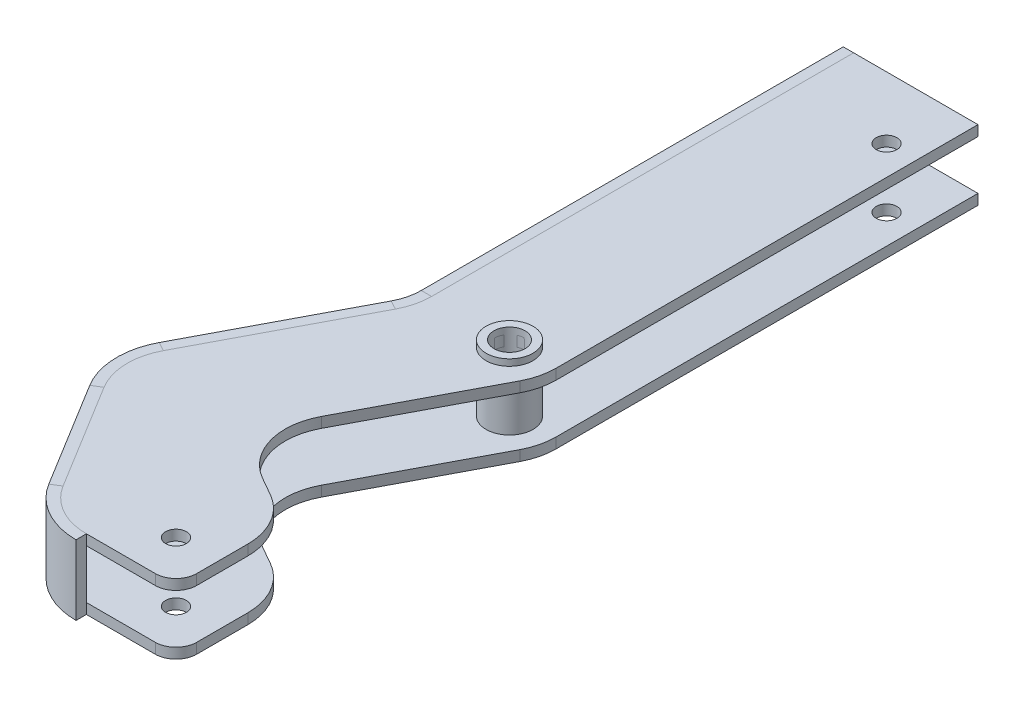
ISO-10303-21;
HEADER;
FILE_DESCRIPTION(('STEP AP214'),'2;1');
FILE_NAME('part.step','',(''),(''),'','','');
FILE_SCHEMA(('AUTOMOTIVE_DESIGN { 1 0 10303 214 1 1 1 1 }'));
ENDSEC;
DATA;
#1=APPLICATION_CONTEXT('core data for automotive mechanical design processes');
#2=APPLICATION_PROTOCOL_DEFINITION('international standard','automotive_design',2000,#1);
#3=PRODUCT_CONTEXT('',#1,'mechanical');
#4=PRODUCT('Part','Part','',(#3));
#5=PRODUCT_RELATED_PRODUCT_CATEGORY('part','',(#4));
#6=PRODUCT_DEFINITION_FORMATION('','',#4);
#7=PRODUCT_DEFINITION_CONTEXT('part definition',#1,'design');
#8=PRODUCT_DEFINITION('design','',#6,#7);
#9=PRODUCT_DEFINITION_SHAPE('','',#8);
#10=(LENGTH_UNIT() NAMED_UNIT(*) SI_UNIT(.MILLI.,.METRE.));
#11=(NAMED_UNIT(*) PLANE_ANGLE_UNIT() SI_UNIT($,.RADIAN.));
#12=(NAMED_UNIT(*) SI_UNIT($,.STERADIAN.) SOLID_ANGLE_UNIT());
#13=UNCERTAINTY_MEASURE_WITH_UNIT(LENGTH_MEASURE(1.E-05),#10,'distance_accuracy_value','');
#14=(GEOMETRIC_REPRESENTATION_CONTEXT(3) GLOBAL_UNCERTAINTY_ASSIGNED_CONTEXT((#13)) GLOBAL_UNIT_ASSIGNED_CONTEXT((#10,
#11,#12)) REPRESENTATION_CONTEXT('',''));
#15=CARTESIAN_POINT('',(0.,0.,0.));
#16=DIRECTION('',(0.,0.,1.));
#17=DIRECTION('',(1.,0.,0.));
#18=AXIS2_PLACEMENT_3D('',#15,#16,#17);
#19=CARTESIAN_POINT('',(-15.3119825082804,0.,95.2483913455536));
#20=DIRECTION('',(0.,0.999999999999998,0.));
#21=DIRECTION('',(0.,0.,1.));
#22=AXIS2_PLACEMENT_3D('',#19,#20,#21);
#23=CYLINDRICAL_SURFACE('',#22,22.225);
#24=CARTESIAN_POINT('',(-15.3119825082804,-10.7060999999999,95.2483913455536));
#25=DIRECTION('',(0.,0.999999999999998,0.));
#26=DIRECTION('',(-0.852273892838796,0.,0.523095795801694));
#27=AXIS2_PLACEMENT_3D('',#24,#25,#26);
#28=CIRCLE('',#27,22.225);
#29=CARTESIAN_POINT('',(-34.2537697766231,-10.7060999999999,106.874195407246));
#30=VERTEX_POINT('',#29);
#31=CARTESIAN_POINT('',(-15.3119825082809,-10.7060999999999,117.473391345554));
#32=VERTEX_POINT('',#31);
#33=EDGE_CURVE('E162',#30,#32,#28,.T.);
#34=ORIENTED_EDGE('',*,*,#33,.T.);
#35=DIRECTION('',(0.,-0.999999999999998,0.));
#36=VECTOR('',#35,1.);
#37=CARTESIAN_POINT('',(-15.3119825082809,10.7060999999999,117.473391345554));
#38=LINE('',#37,#36);
#39=CARTESIAN_POINT('',(-15.3119825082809,10.7060999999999,117.473391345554));
#40=VERTEX_POINT('',#39);
#41=EDGE_CURVE('E156',#40,#32,#38,.T.);
#42=ORIENTED_EDGE('',*,*,#41,.F.);
#43=CARTESIAN_POINT('',(-15.3119825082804,10.7060999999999,95.2483913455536));
#44=DIRECTION('',(0.,0.999999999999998,0.));
#45=DIRECTION('',(-0.852273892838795,0.,0.523095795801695));
#46=AXIS2_PLACEMENT_3D('',#43,#44,#45);
#47=CIRCLE('',#46,22.225);
#48=CARTESIAN_POINT('',(-34.2537697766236,10.7060999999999,106.874195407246));
#49=VERTEX_POINT('',#48);
#50=EDGE_CURVE('E187',#49,#40,#47,.T.);
#51=ORIENTED_EDGE('',*,*,#50,.F.);
#52=DIRECTION('',(0.,-0.999999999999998,0.));
#53=VECTOR('',#52,1.);
#54=CARTESIAN_POINT('',(-34.2537697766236,10.7060999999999,106.874195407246));
#55=LINE('',#54,#53);
#56=EDGE_CURVE('E319',#49,#30,#55,.T.);
#57=ORIENTED_EDGE('',*,*,#56,.T.);
#58=EDGE_LOOP('',(#34,#42,#51,#57));
#59=FACE_BOUND('',#58,.T.);
#60=ADVANCED_FACE('F51',(#59),#23,.T.);
#61=CARTESIAN_POINT('',(-34.2537697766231,-10.7060999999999,106.874195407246));
#62=DIRECTION('',(0.,-0.999999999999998,0.));
#63=DIRECTION('',(0.,0.,-1.));
#64=AXIS2_PLACEMENT_3D('',#61,#62,#63);
#65=PLANE('',#64);
#66=CARTESIAN_POINT('',(-15.3119825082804,-10.7060999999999,95.2483913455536));
#67=DIRECTION('',(0.,0.999999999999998,0.));
#68=DIRECTION('',(-0.852273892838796,0.,0.523095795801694));
#69=AXIS2_PLACEMENT_3D('',#66,#67,#68);
#70=CIRCLE('',#69,19.05);
#71=CARTESIAN_POINT('',(-31.5478001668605,-10.7060999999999,105.213366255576));
#72=VERTEX_POINT('',#71);
#73=CARTESIAN_POINT('',(-15.3119825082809,-10.7060999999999,114.298391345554));
#74=VERTEX_POINT('',#73);
#75=EDGE_CURVE('E161',#72,#74,#70,.T.);
#76=ORIENTED_EDGE('',*,*,#75,.T.);
#77=DIRECTION('',(0.,0.,-1.));
#78=VECTOR('',#77,1.);
#79=CARTESIAN_POINT('',(-15.3119825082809,-10.7060999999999,117.473391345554));
#80=LINE('',#79,#78);
#81=EDGE_CURVE('E150',#32,#74,#80,.T.);
#82=ORIENTED_EDGE('',*,*,#81,.F.);
#83=ORIENTED_EDGE('',*,*,#33,.F.);
#84=DIRECTION('',(0.852273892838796,0.,-0.523095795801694));
#85=VECTOR('',#84,1.);
#86=CARTESIAN_POINT('',(-34.2537697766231,-10.7060999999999,106.874195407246));
#87=LINE('',#86,#85);
#88=EDGE_CURVE('E176',#30,#72,#87,.T.);
#89=ORIENTED_EDGE('',*,*,#88,.T.);
#90=EDGE_LOOP('',(#76,#82,#83,#89));
#91=FACE_BOUND('',#90,.T.);
#92=ADVANCED_FACE('F174',(#91),#65,.T.);
#93=CARTESIAN_POINT('',(-15.3119825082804,0.,95.2483913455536));
#94=DIRECTION('',(0.,0.999999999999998,0.));
#95=DIRECTION('',(0.,0.,1.));
#96=AXIS2_PLACEMENT_3D('',#93,#94,#95);
#97=CYLINDRICAL_SURFACE('',#96,19.05);
#98=CARTESIAN_POINT('',(-15.3119825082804,10.7060999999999,95.2483913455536));
#99=DIRECTION('',(0.,0.999999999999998,0.));
#100=DIRECTION('',(-0.852273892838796,0.,0.523095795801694));
#101=AXIS2_PLACEMENT_3D('',#98,#99,#100);
#102=CIRCLE('',#101,19.05);
#103=CARTESIAN_POINT('',(-31.5478001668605,10.7060999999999,105.213366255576));
#104=VERTEX_POINT('',#103);
#105=CARTESIAN_POINT('',(-15.3119825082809,10.7060999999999,114.298391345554));
#106=VERTEX_POINT('',#105);
#107=EDGE_CURVE('E171',#104,#106,#102,.T.);
#108=ORIENTED_EDGE('',*,*,#107,.T.);
#109=DIRECTION('',(0.,0.999999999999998,0.));
#110=VECTOR('',#109,1.);
#111=CARTESIAN_POINT('',(-15.3119825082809,10.7060999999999,114.298391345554));
#112=LINE('',#111,#110);
#113=EDGE_CURVE('E153',#74,#106,#112,.T.);
#114=ORIENTED_EDGE('',*,*,#113,.F.);
#115=ORIENTED_EDGE('',*,*,#75,.F.);
#116=DIRECTION('',(0.,0.999999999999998,0.));
#117=VECTOR('',#116,1.);
#118=CARTESIAN_POINT('',(-31.5478001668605,10.7060999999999,105.213366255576));
#119=LINE('',#118,#117);
#120=EDGE_CURVE('E180',#72,#104,#119,.T.);
#121=ORIENTED_EDGE('',*,*,#120,.T.);
#122=EDGE_LOOP('',(#108,#114,#115,#121));
#123=FACE_BOUND('',#122,.T.);
#124=ADVANCED_FACE('F167',(#123),#97,.F.);
#125=CARTESIAN_POINT('',(-34.2537697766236,10.7060999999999,106.874195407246));
#126=DIRECTION('',(0.,0.999999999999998,0.));
#127=DIRECTION('',(0.,0.,1.));
#128=AXIS2_PLACEMENT_3D('',#125,#126,#127);
#129=PLANE('',#128);
#130=DIRECTION('',(0.,0.,1.));
#131=VECTOR('',#130,1.);
#132=CARTESIAN_POINT('',(-15.3119825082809,10.7060999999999,117.473391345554));
#133=LINE('',#132,#131);
#134=EDGE_CURVE('E184',#106,#40,#133,.T.);
#135=ORIENTED_EDGE('',*,*,#134,.F.);
#136=ORIENTED_EDGE('',*,*,#107,.F.);
#137=DIRECTION('',(-0.852273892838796,0.,0.523095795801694));
#138=VECTOR('',#137,1.);
#139=CARTESIAN_POINT('',(-34.2537697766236,10.7060999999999,106.874195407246));
#140=LINE('',#139,#138);
#141=EDGE_CURVE('E181',#104,#49,#140,.T.);
#142=ORIENTED_EDGE('',*,*,#141,.T.);
#143=ORIENTED_EDGE('',*,*,#50,.T.);
#144=EDGE_LOOP('',(#135,#136,#142,#143));
#145=FACE_BOUND('',#144,.T.);
#146=ADVANCED_FACE('F330',(#145),#129,.T.);
#147=CARTESIAN_POINT('',(-54.1837195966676,10.7060999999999,74.4025600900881));
#148=DIRECTION('',(0.,0.999999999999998,0.));
#149=DIRECTION('',(0.,0.,1.));
#150=AXIS2_PLACEMENT_3D('',#147,#148,#149);
#151=PLANE('',#150);
#152=DIRECTION('',(0.523095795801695,0.,0.852273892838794));
#153=VECTOR('',#152,1.);
#154=CARTESIAN_POINT('',(-54.1837195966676,10.7060999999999,74.4025600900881));
#155=LINE('',#154,#153);
#156=CARTESIAN_POINT('',(-54.1837195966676,10.7060999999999,74.4025600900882));
#157=VERTEX_POINT('',#156);
#158=EDGE_CURVE('E194',#157,#49,#155,.T.);
#159=ORIENTED_EDGE('',*,*,#158,.T.);
#160=ORIENTED_EDGE('',*,*,#141,.F.);
#161=DIRECTION('',(0.523095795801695,0.,0.852273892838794));
#162=VECTOR('',#161,1.);
#163=CARTESIAN_POINT('',(-51.4777499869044,10.7060999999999,72.7417309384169));
#164=LINE('',#163,#162);
#165=CARTESIAN_POINT('',(-51.4777499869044,10.7060999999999,72.7417309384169));
#166=VERTEX_POINT('',#165);
#167=EDGE_CURVE('E210',#166,#104,#164,.T.);
#168=ORIENTED_EDGE('',*,*,#167,.F.);
#169=DIRECTION('',(-0.852273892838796,0.,0.523095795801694));
#170=VECTOR('',#169,1.);
#171=CARTESIAN_POINT('',(-54.1837195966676,10.7060999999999,74.4025600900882));
#172=LINE('',#171,#170);
#173=EDGE_CURVE('E190',#166,#157,#172,.T.);
#174=ORIENTED_EDGE('',*,*,#173,.T.);
#175=EDGE_LOOP('',(#159,#160,#168,#174));
#176=FACE_BOUND('',#175,.T.);
#177=ADVANCED_FACE('F410',(#176),#151,.T.);
#178=CARTESIAN_POINT('',(-51.4777499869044,10.7060999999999,72.7417309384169));
#179=DIRECTION('',(0.852273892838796,0.,-0.523095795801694));
#180=DIRECTION('',(-0.523095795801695,0.,-0.852273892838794));
#181=AXIS2_PLACEMENT_3D('',#178,#179,#180);
#182=PLANE('',#181);
#183=ORIENTED_EDGE('',*,*,#167,.T.);
#184=ORIENTED_EDGE('',*,*,#120,.F.);
#185=DIRECTION('',(0.523095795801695,0.,0.852273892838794));
#186=VECTOR('',#185,1.);
#187=CARTESIAN_POINT('',(-51.4777499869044,-10.7060999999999,72.7417309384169));
#188=LINE('',#187,#186);
#189=CARTESIAN_POINT('',(-51.4777499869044,-10.7060999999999,72.7417309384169));
#190=VERTEX_POINT('',#189);
#191=EDGE_CURVE('E212',#190,#72,#188,.T.);
#192=ORIENTED_EDGE('',*,*,#191,.F.);
#193=DIRECTION('',(0.,0.999999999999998,0.));
#194=VECTOR('',#193,1.);
#195=CARTESIAN_POINT('',(-51.4777499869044,10.7060999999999,72.7417309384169));
#196=LINE('',#195,#194);
#197=EDGE_CURVE('E215',#190,#166,#196,.T.);
#198=ORIENTED_EDGE('',*,*,#197,.T.);
#199=EDGE_LOOP('',(#183,#184,#192,#198));
#200=FACE_BOUND('',#199,.T.);
#201=ADVANCED_FACE('F339',(#200),#182,.T.);
#202=CARTESIAN_POINT('',(-54.1837195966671,-10.7060999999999,74.4025600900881));
#203=DIRECTION('',(0.,-0.999999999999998,0.));
#204=DIRECTION('',(0.,0.,-1.));
#205=AXIS2_PLACEMENT_3D('',#202,#203,#204);
#206=PLANE('',#205);
#207=ORIENTED_EDGE('',*,*,#191,.T.);
#208=ORIENTED_EDGE('',*,*,#88,.F.);
#209=DIRECTION('',(0.523095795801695,0.,0.852273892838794));
#210=VECTOR('',#209,1.);
#211=CARTESIAN_POINT('',(-54.1837195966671,-10.7060999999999,74.4025600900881));
#212=LINE('',#211,#210);
#213=CARTESIAN_POINT('',(-54.1837195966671,-10.7060999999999,74.4025600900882));
#214=VERTEX_POINT('',#213);
#215=EDGE_CURVE('E235',#214,#30,#212,.T.);
#216=ORIENTED_EDGE('',*,*,#215,.F.);
#217=DIRECTION('',(0.852273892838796,0.,-0.523095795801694));
#218=VECTOR('',#217,1.);
#219=CARTESIAN_POINT('',(-54.1837195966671,-10.7060999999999,74.4025600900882));
#220=LINE('',#219,#218);
#221=EDGE_CURVE('E238',#214,#190,#220,.T.);
#222=ORIENTED_EDGE('',*,*,#221,.T.);
#223=EDGE_LOOP('',(#207,#208,#216,#222));
#224=FACE_BOUND('',#223,.T.);
#225=ADVANCED_FACE('F335',(#224),#206,.T.);
#226=CARTESIAN_POINT('',(-54.1837195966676,10.7060999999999,74.4025600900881));
#227=DIRECTION('',(-0.852273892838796,0.,0.523095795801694));
#228=DIRECTION('',(0.523095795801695,0.,0.852273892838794));
#229=AXIS2_PLACEMENT_3D('',#226,#227,#228);
#230=PLANE('',#229);
#231=ORIENTED_EDGE('',*,*,#215,.T.);
#232=ORIENTED_EDGE('',*,*,#56,.F.);
#233=ORIENTED_EDGE('',*,*,#158,.F.);
#234=DIRECTION('',(0.,-0.999999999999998,0.));
#235=VECTOR('',#234,1.);
#236=CARTESIAN_POINT('',(-54.1837195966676,10.7060999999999,74.4025600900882));
#237=LINE('',#236,#235);
#238=EDGE_CURVE('E261',#157,#214,#237,.T.);
#239=ORIENTED_EDGE('',*,*,#238,.T.);
#240=EDGE_LOOP('',(#231,#232,#233,#239));
#241=FACE_BOUND('',#240,.T.);
#242=ADVANCED_FACE('F391',(#241),#230,.T.);
#243=CARTESIAN_POINT('',(-35.2419323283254,0.,62.7767560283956));
#244=DIRECTION('',(0.,0.999999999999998,0.));
#245=DIRECTION('',(0.,0.,1.));
#246=AXIS2_PLACEMENT_3D('',#243,#244,#245);
#247=CYLINDRICAL_SURFACE('',#246,22.225);
#248=CARTESIAN_POINT('',(-35.2419323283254,-10.7060999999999,62.7767560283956));
#249=DIRECTION('',(0.,0.999999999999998,0.));
#250=DIRECTION('',(-0.884918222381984,0.,-0.465746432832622));
#251=AXIS2_PLACEMENT_3D('',#248,#249,#250);
#252=CIRCLE('',#251,22.225);
#253=CARTESIAN_POINT('',(-54.9092398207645,-10.7060999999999,52.4255415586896));
#254=VERTEX_POINT('',#253);
#255=EDGE_CURVE('E241',#254,#214,#252,.T.);
#256=ORIENTED_EDGE('',*,*,#255,.T.);
#257=ORIENTED_EDGE('',*,*,#238,.F.);
#258=CARTESIAN_POINT('',(-35.2419323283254,10.7060999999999,62.7767560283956));
#259=DIRECTION('',(0.,0.999999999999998,0.));
#260=DIRECTION('',(-0.884918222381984,0.,-0.465746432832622));
#261=AXIS2_PLACEMENT_3D('',#258,#259,#260);
#262=CIRCLE('',#261,22.225);
#263=CARTESIAN_POINT('',(-54.9092398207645,10.7060999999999,52.4255415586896));
#264=VERTEX_POINT('',#263);
#265=EDGE_CURVE('E199',#264,#157,#262,.T.);
#266=ORIENTED_EDGE('',*,*,#265,.F.);
#267=DIRECTION('',(0.,-0.999999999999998,0.));
#268=VECTOR('',#267,1.);
#269=CARTESIAN_POINT('',(-54.9092398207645,10.7060999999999,52.4255415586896));
#270=LINE('',#269,#268);
#271=EDGE_CURVE('E268',#264,#254,#270,.T.);
#272=ORIENTED_EDGE('',*,*,#271,.T.);
#273=EDGE_LOOP('',(#256,#257,#266,#272));
#274=FACE_BOUND('',#273,.T.);
#275=ADVANCED_FACE('F352',(#274),#247,.T.);
#276=CARTESIAN_POINT('',(-54.9092398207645,-10.7060999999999,52.4255415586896));
#277=DIRECTION('',(0.,-0.999999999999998,0.));
#278=DIRECTION('',(0.,0.,-1.));
#279=AXIS2_PLACEMENT_3D('',#276,#277,#278);
#280=PLANE('',#279);
#281=CARTESIAN_POINT('',(-35.2419323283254,-10.7060999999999,62.7767560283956));
#282=DIRECTION('',(0.,0.999999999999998,0.));
#283=DIRECTION('',(-0.884918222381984,0.,-0.465746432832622));
#284=AXIS2_PLACEMENT_3D('',#281,#282,#283);
#285=CIRCLE('',#284,19.05);
#286=CARTESIAN_POINT('',(-52.0996244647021,-10.7060999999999,53.9042864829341));
#287=VERTEX_POINT('',#286);
#288=EDGE_CURVE('E218',#287,#190,#285,.T.);
#289=ORIENTED_EDGE('',*,*,#288,.T.);
#290=ORIENTED_EDGE('',*,*,#221,.F.);
#291=ORIENTED_EDGE('',*,*,#255,.F.);
#292=DIRECTION('',(0.884918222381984,0.,0.465746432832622));
#293=VECTOR('',#292,1.);
#294=CARTESIAN_POINT('',(-54.9092398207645,-10.7060999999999,52.4255415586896));
#295=LINE('',#294,#293);
#296=EDGE_CURVE('E244',#254,#287,#295,.T.);
#297=ORIENTED_EDGE('',*,*,#296,.T.);
#298=EDGE_LOOP('',(#289,#290,#291,#297));
#299=FACE_BOUND('',#298,.T.);
#300=ADVANCED_FACE('F344',(#299),#280,.T.);
#301=CARTESIAN_POINT('',(-35.2419323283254,0.,62.7767560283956));
#302=DIRECTION('',(0.,0.999999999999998,0.));
#303=DIRECTION('',(0.,0.,1.));
#304=AXIS2_PLACEMENT_3D('',#301,#302,#303);
#305=CYLINDRICAL_SURFACE('',#304,19.05);
#306=CARTESIAN_POINT('',(-35.2419323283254,10.7060999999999,62.7767560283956));
#307=DIRECTION('',(0.,0.999999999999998,0.));
#308=DIRECTION('',(-0.884918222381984,0.,-0.465746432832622));
#309=AXIS2_PLACEMENT_3D('',#306,#307,#308);
#310=CIRCLE('',#309,19.05);
#311=CARTESIAN_POINT('',(-52.0996244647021,10.7060999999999,53.904286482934));
#312=VERTEX_POINT('',#311);
#313=EDGE_CURVE('E193',#312,#166,#310,.T.);
#314=ORIENTED_EDGE('',*,*,#313,.T.);
#315=ORIENTED_EDGE('',*,*,#197,.F.);
#316=ORIENTED_EDGE('',*,*,#288,.F.);
#317=DIRECTION('',(0.,0.999999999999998,0.));
#318=VECTOR('',#317,1.);
#319=CARTESIAN_POINT('',(-52.0996244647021,10.7060999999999,53.904286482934));
#320=LINE('',#319,#318);
#321=EDGE_CURVE('E221',#287,#312,#320,.T.);
#322=ORIENTED_EDGE('',*,*,#321,.T.);
#323=EDGE_LOOP('',(#314,#315,#316,#322));
#324=FACE_BOUND('',#323,.T.);
#325=ADVANCED_FACE('F341',(#324),#305,.F.);
#326=CARTESIAN_POINT('',(-54.9092398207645,10.7060999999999,52.4255415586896));
#327=DIRECTION('',(0.,0.999999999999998,0.));
#328=DIRECTION('',(0.,0.,1.));
#329=AXIS2_PLACEMENT_3D('',#326,#327,#328);
#330=PLANE('',#329);
#331=ORIENTED_EDGE('',*,*,#173,.F.);
#332=ORIENTED_EDGE('',*,*,#313,.F.);
#333=DIRECTION('',(-0.884918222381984,0.,-0.465746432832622));
#334=VECTOR('',#333,1.);
#335=CARTESIAN_POINT('',(-54.9092398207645,10.7060999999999,52.4255415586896));
#336=LINE('',#335,#334);
#337=EDGE_CURVE('E195',#312,#264,#336,.T.);
#338=ORIENTED_EDGE('',*,*,#337,.T.);
#339=ORIENTED_EDGE('',*,*,#265,.T.);
#340=EDGE_LOOP('',(#331,#332,#338,#339));
#341=FACE_BOUND('',#340,.T.);
#342=ADVANCED_FACE('F357',(#341),#330,.T.);
#343=CARTESIAN_POINT('',(-30.401923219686,10.7060999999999,5.86164001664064));
#344=DIRECTION('',(-0.884918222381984,0.,-0.465746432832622));
#345=DIRECTION('',(-0.465746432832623,0.,0.884918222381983));
#346=AXIS2_PLACEMENT_3D('',#343,#344,#345);
#347=PLANE('',#346);
#348=DIRECTION('',(-0.465746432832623,0.,0.884918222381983));
#349=VECTOR('',#348,1.);
#350=CARTESIAN_POINT('',(-30.401923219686,-10.7060999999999,5.86164001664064));
#351=LINE('',#350,#349);
#352=CARTESIAN_POINT('',(-30.4019232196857,-10.7060999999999,5.86164001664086));
#353=VERTEX_POINT('',#352);
#354=EDGE_CURVE('E247',#353,#254,#351,.T.);
#355=ORIENTED_EDGE('',*,*,#354,.T.);
#356=ORIENTED_EDGE('',*,*,#271,.F.);
#357=DIRECTION('',(-0.465746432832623,0.,0.884918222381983));
#358=VECTOR('',#357,1.);
#359=CARTESIAN_POINT('',(-30.401923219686,10.7060999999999,5.86164001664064));
#360=LINE('',#359,#358);
#361=CARTESIAN_POINT('',(-30.4019232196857,10.7060999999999,5.86164001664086));
#362=VERTEX_POINT('',#361);
#363=EDGE_CURVE('E204',#362,#264,#360,.T.);
#364=ORIENTED_EDGE('',*,*,#363,.F.);
#365=DIRECTION('',(0.,-0.999999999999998,0.));
#366=VECTOR('',#365,1.);
#367=CARTESIAN_POINT('',(-30.401923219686,10.7060999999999,5.86164001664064));
#368=LINE('',#367,#366);
#369=EDGE_CURVE('E275',#362,#353,#368,.T.);
#370=ORIENTED_EDGE('',*,*,#369,.T.);
#371=EDGE_LOOP('',(#355,#356,#364,#370));
#372=FACE_BOUND('',#371,.T.);
#373=ADVANCED_FACE('F350',(#372),#347,.T.);
#374=CARTESIAN_POINT('',(-30.401923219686,-10.7060999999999,5.86164001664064));
#375=DIRECTION('',(0.,-0.999999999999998,0.));
#376=DIRECTION('',(0.,0.,-1.));
#377=AXIS2_PLACEMENT_3D('',#374,#375,#376);
#378=PLANE('',#377);
#379=DIRECTION('',(-0.465746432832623,0.,0.884918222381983));
#380=VECTOR('',#379,1.);
#381=CARTESIAN_POINT('',(-27.5923078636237,-10.7060999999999,7.34038494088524));
#382=LINE('',#381,#380);
#383=CARTESIAN_POINT('',(-27.5923078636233,-10.7060999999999,7.3403849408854));
#384=VERTEX_POINT('',#383);
#385=EDGE_CURVE('E224',#384,#287,#382,.T.);
#386=ORIENTED_EDGE('',*,*,#385,.T.);
#387=ORIENTED_EDGE('',*,*,#296,.F.);
#388=ORIENTED_EDGE('',*,*,#354,.F.);
#389=DIRECTION('',(0.884918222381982,0.,0.465746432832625));
#390=VECTOR('',#389,1.);
#391=CARTESIAN_POINT('',(-30.401923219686,-10.7060999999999,5.86164001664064));
#392=LINE('',#391,#390);
#393=EDGE_CURVE('E250',#353,#384,#392,.T.);
#394=ORIENTED_EDGE('',*,*,#393,.T.);
#395=EDGE_LOOP('',(#386,#387,#388,#394));
#396=FACE_BOUND('',#395,.T.);
#397=ADVANCED_FACE('F347',(#396),#378,.T.);
#398=CARTESIAN_POINT('',(-27.5923078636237,10.7060999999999,7.34038494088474));
#399=DIRECTION('',(0.884918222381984,0.,0.465746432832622));
#400=DIRECTION('',(0.465746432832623,0.,-0.884918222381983));
#401=AXIS2_PLACEMENT_3D('',#398,#399,#400);
#402=PLANE('',#401);
#403=DIRECTION('',(-0.465746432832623,0.,0.884918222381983));
#404=VECTOR('',#403,1.);
#405=CARTESIAN_POINT('',(-27.5923078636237,10.7060999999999,7.34038494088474));
#406=LINE('',#405,#404);
#407=CARTESIAN_POINT('',(-27.5923078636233,10.7060999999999,7.3403849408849));
#408=VERTEX_POINT('',#407);
#409=EDGE_CURVE('E198',#408,#312,#406,.T.);
#410=ORIENTED_EDGE('',*,*,#409,.T.);
#411=ORIENTED_EDGE('',*,*,#321,.F.);
#412=ORIENTED_EDGE('',*,*,#385,.F.);
#413=DIRECTION('',(0.,0.999999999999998,0.));
#414=VECTOR('',#413,1.);
#415=CARTESIAN_POINT('',(-27.5923078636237,10.7060999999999,7.34038494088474));
#416=LINE('',#415,#414);
#417=EDGE_CURVE('E227',#384,#408,#416,.T.);
#418=ORIENTED_EDGE('',*,*,#417,.T.);
#419=EDGE_LOOP('',(#410,#411,#412,#418));
#420=FACE_BOUND('',#419,.T.);
#421=ADVANCED_FACE('F361',(#420),#402,.T.);
#422=CARTESIAN_POINT('',(-30.401923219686,10.7060999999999,5.86164001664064));
#423=DIRECTION('',(0.,0.999999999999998,0.));
#424=DIRECTION('',(0.,0.,1.));
#425=AXIS2_PLACEMENT_3D('',#422,#423,#424);
#426=PLANE('',#425);
#427=ORIENTED_EDGE('',*,*,#337,.F.);
#428=ORIENTED_EDGE('',*,*,#409,.F.);
#429=DIRECTION('',(-0.884918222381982,0.,-0.465746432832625));
#430=VECTOR('',#429,1.);
#431=CARTESIAN_POINT('',(-30.401923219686,10.7060999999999,5.86164001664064));
#432=LINE('',#431,#430);
#433=EDGE_CURVE('E200',#408,#362,#432,.T.);
#434=ORIENTED_EDGE('',*,*,#433,.T.);
#435=ORIENTED_EDGE('',*,*,#363,.T.);
#436=EDGE_LOOP('',(#427,#428,#434,#435));
#437=FACE_BOUND('',#436,.T.);
#438=ADVANCED_FACE('F359',(#437),#426,.T.);
#439=CARTESIAN_POINT('',(-44.45,0.,-1.53208460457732));
#440=DIRECTION('',(0.,-0.999999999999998,0.));
#441=DIRECTION('',(0.,0.,-1.));
#442=AXIS2_PLACEMENT_3D('',#439,#440,#441);
#443=CYLINDRICAL_SURFACE('',#442,15.8750000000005);
#444=CARTESIAN_POINT('',(-44.45,-10.7060999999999,-1.53208460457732));
#445=DIRECTION('',(0.,-0.999999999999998,0.));
#446=DIRECTION('',(1.,0.,0.));
#447=AXIS2_PLACEMENT_3D('',#444,#445,#446);
#448=CIRCLE('',#447,15.8750000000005);
#449=CARTESIAN_POINT('',(-28.5750000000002,-10.7060999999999,-1.53208460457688));
#450=VERTEX_POINT('',#449);
#451=EDGE_CURVE('E253',#450,#353,#448,.T.);
#452=ORIENTED_EDGE('',*,*,#451,.T.);
#453=ORIENTED_EDGE('',*,*,#369,.F.);
#454=CARTESIAN_POINT('',(-44.4500000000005,10.7060999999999,-1.53208460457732));
#455=DIRECTION('',(0.,-0.999999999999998,0.));
#456=DIRECTION('',(1.,0.,0.));
#457=AXIS2_PLACEMENT_3D('',#454,#455,#456);
#458=CIRCLE('',#457,15.8750000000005);
#459=CARTESIAN_POINT('',(-28.5750000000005,10.7060999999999,-1.53208460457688));
#460=VERTEX_POINT('',#459);
#461=EDGE_CURVE('E209',#460,#362,#458,.T.);
#462=ORIENTED_EDGE('',*,*,#461,.F.);
#463=DIRECTION('',(0.,-0.999999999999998,0.));
#464=VECTOR('',#463,1.);
#465=CARTESIAN_POINT('',(-28.5750000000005,10.7060999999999,-1.53208460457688));
#466=LINE('',#465,#464);
#467=EDGE_CURVE('E256',#460,#450,#466,.T.);
#468=ORIENTED_EDGE('',*,*,#467,.T.);
#469=EDGE_LOOP('',(#452,#453,#462,#468));
#470=FACE_BOUND('',#469,.T.);
#471=ADVANCED_FACE('F304',(#470),#443,.F.);
#472=CARTESIAN_POINT('',(-28.5749999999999,-10.7060999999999,-1.53208460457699));
#473=DIRECTION('',(0.,-0.999999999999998,0.));
#474=DIRECTION('',(0.,0.,-1.));
#475=AXIS2_PLACEMENT_3D('',#472,#473,#474);
#476=PLANE('',#475);
#477=CARTESIAN_POINT('',(-44.45,-10.7060999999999,-1.53208460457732));
#478=DIRECTION('',(0.,-0.999999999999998,0.));
#479=DIRECTION('',(1.,0.,0.));
#480=AXIS2_PLACEMENT_3D('',#477,#478,#479);
#481=CIRCLE('',#480,19.0500000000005);
#482=CARTESIAN_POINT('',(-25.4,-10.7060999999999,-1.53208460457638));
#483=VERTEX_POINT('',#482);
#484=EDGE_CURVE('E230',#483,#384,#481,.T.);
#485=ORIENTED_EDGE('',*,*,#484,.T.);
#486=ORIENTED_EDGE('',*,*,#393,.F.);
#487=ORIENTED_EDGE('',*,*,#451,.F.);
#488=DIRECTION('',(1.,0.,0.));
#489=VECTOR('',#488,1.);
#490=CARTESIAN_POINT('',(-28.5750000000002,-10.7060999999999,-1.53208460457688));
#491=LINE('',#490,#489);
#492=EDGE_CURVE('E233',#450,#483,#491,.T.);
#493=ORIENTED_EDGE('',*,*,#492,.T.);
#494=EDGE_LOOP('',(#485,#486,#487,#493));
#495=FACE_BOUND('',#494,.T.);
#496=ADVANCED_FACE('F298',(#495),#476,.T.);
#497=CARTESIAN_POINT('',(-44.45,0.,-1.53208460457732));
#498=DIRECTION('',(0.,-0.999999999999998,0.));
#499=DIRECTION('',(0.,0.,-1.));
#500=AXIS2_PLACEMENT_3D('',#497,#498,#499);
#501=CYLINDRICAL_SURFACE('',#500,19.0500000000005);
#502=CARTESIAN_POINT('',(-44.4500000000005,10.7060999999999,-1.53208460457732));
#503=DIRECTION('',(0.,-0.999999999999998,0.));
#504=DIRECTION('',(1.,0.,0.));
#505=AXIS2_PLACEMENT_3D('',#502,#503,#504);
#506=CIRCLE('',#505,19.0500000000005);
#507=CARTESIAN_POINT('',(-25.4000000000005,10.7060999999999,-1.53208460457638));
#508=VERTEX_POINT('',#507);
#509=EDGE_CURVE('E203',#508,#408,#506,.T.);
#510=ORIENTED_EDGE('',*,*,#509,.T.);
#511=ORIENTED_EDGE('',*,*,#417,.F.);
#512=ORIENTED_EDGE('',*,*,#484,.F.);
#513=DIRECTION('',(0.,0.999999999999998,0.));
#514=VECTOR('',#513,1.);
#515=CARTESIAN_POINT('',(-25.4000000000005,10.7060999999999,-1.53208460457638));
#516=LINE('',#515,#514);
#517=EDGE_CURVE('E208',#483,#508,#516,.T.);
#518=ORIENTED_EDGE('',*,*,#517,.T.);
#519=EDGE_LOOP('',(#510,#511,#512,#518));
#520=FACE_BOUND('',#519,.T.);
#521=ADVANCED_FACE('F312',(#520),#501,.T.);
#522=CARTESIAN_POINT('',(-28.575,10.7060999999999,-1.53208460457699));
#523=DIRECTION('',(0.,0.999999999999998,0.));
#524=DIRECTION('',(0.,0.,1.));
#525=AXIS2_PLACEMENT_3D('',#522,#523,#524);
#526=PLANE('',#525);
#527=ORIENTED_EDGE('',*,*,#433,.F.);
#528=ORIENTED_EDGE('',*,*,#509,.F.);
#529=DIRECTION('',(-1.,0.,0.));
#530=VECTOR('',#529,1.);
#531=CARTESIAN_POINT('',(-28.5750000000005,10.7060999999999,-1.53208460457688));
#532=LINE('',#531,#530);
#533=EDGE_CURVE('E205',#508,#460,#532,.T.);
#534=ORIENTED_EDGE('',*,*,#533,.T.);
#535=ORIENTED_EDGE('',*,*,#461,.T.);
#536=EDGE_LOOP('',(#527,#528,#534,#535));
#537=FACE_BOUND('',#536,.T.);
#538=ADVANCED_FACE('F308',(#537),#526,.T.);
#539=CARTESIAN_POINT('',(-28.575,10.7061000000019,-134.4025));
#540=DIRECTION('',(-1.,0.,0.));
#541=DIRECTION('',(0.,-0.999999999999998,0.));
#542=AXIS2_PLACEMENT_3D('',#539,#540,#541);
#543=PLANE('',#542);
#544=DIRECTION('',(0.,-0.999999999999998,0.));
#545=VECTOR('',#544,1.);
#546=CARTESIAN_POINT('',(-28.575000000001,10.7061000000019,-130.81));
#547=LINE('',#546,#545);
#548=CARTESIAN_POINT('',(-28.5750000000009,10.7061000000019,-130.81));
#549=VERTEX_POINT('',#548);
#550=CARTESIAN_POINT('',(-28.5750000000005,-10.7060999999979,-130.81));
#551=VERTEX_POINT('',#550);
#552=EDGE_CURVE('E65',#549,#551,#547,.T.);
#553=ORIENTED_EDGE('',*,*,#552,.T.);
#554=DIRECTION('',(0.,0.,1.));
#555=VECTOR('',#554,1.);
#556=CARTESIAN_POINT('',(-28.575,-10.7060999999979,-134.4025));
#557=LINE('',#556,#555);
#558=EDGE_CURVE('E287',#551,#450,#557,.T.);
#559=ORIENTED_EDGE('',*,*,#558,.T.);
#560=ORIENTED_EDGE('',*,*,#467,.F.);
#561=DIRECTION('',(0.,0.,1.));
#562=VECTOR('',#561,1.);
#563=CARTESIAN_POINT('',(-28.575,10.7061000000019,-134.4025));
#564=LINE('',#563,#562);
#565=EDGE_CURVE('E59',#549,#460,#564,.T.);
#566=ORIENTED_EDGE('',*,*,#565,.F.);
#567=EDGE_LOOP('',(#553,#559,#560,#566));
#568=FACE_BOUND('',#567,.T.);
#569=ADVANCED_FACE('F292',(#568),#543,.T.);
#570=CARTESIAN_POINT('',(-28.575,-10.7060999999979,-134.4025));
#571=DIRECTION('',(0.,-0.999999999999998,0.));
#572=DIRECTION('',(0.,0.,-1.));
#573=AXIS2_PLACEMENT_3D('',#570,#571,#572);
#574=PLANE('',#573);
#575=DIRECTION('',(-1.,0.,0.));
#576=VECTOR('',#575,1.);
#577=CARTESIAN_POINT('',(-28.5750000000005,-10.7060999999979,-130.81));
#578=LINE('',#577,#576);
#579=CARTESIAN_POINT('',(-25.4000000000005,-10.7060999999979,-130.81));
#580=VERTEX_POINT('',#579);
#581=EDGE_CURVE('E318',#580,#551,#578,.T.);
#582=ORIENTED_EDGE('',*,*,#581,.F.);
#583=DIRECTION('',(0.,0.,1.));
#584=VECTOR('',#583,1.);
#585=CARTESIAN_POINT('',(-25.4000000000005,-10.7060999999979,-134.4025));
#586=LINE('',#585,#584);
#587=EDGE_CURVE('E285',#580,#483,#586,.T.);
#588=ORIENTED_EDGE('',*,*,#587,.T.);
#589=ORIENTED_EDGE('',*,*,#492,.F.);
#590=ORIENTED_EDGE('',*,*,#558,.F.);
#591=EDGE_LOOP('',(#582,#588,#589,#590));
#592=FACE_BOUND('',#591,.T.);
#593=ADVANCED_FACE('F301',(#592),#574,.T.);
#594=CARTESIAN_POINT('',(-25.4000000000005,10.7061000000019,-134.4025));
#595=DIRECTION('',(1.,0.,0.));
#596=DIRECTION('',(0.,0.999999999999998,0.));
#597=AXIS2_PLACEMENT_3D('',#594,#595,#596);
#598=PLANE('',#597);
#599=DIRECTION('',(0.,-0.999999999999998,0.));
#600=VECTOR('',#599,1.);
#601=CARTESIAN_POINT('',(-25.4000000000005,10.7061000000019,-130.81));
#602=LINE('',#601,#600);
#603=CARTESIAN_POINT('',(-25.4000000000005,10.7061000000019,-130.81));
#604=VERTEX_POINT('',#603);
#605=EDGE_CURVE('E189',#604,#580,#602,.T.);
#606=ORIENTED_EDGE('',*,*,#605,.F.);
#607=DIRECTION('',(0.,0.,1.));
#608=VECTOR('',#607,1.);
#609=CARTESIAN_POINT('',(-25.4000000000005,10.7061000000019,-134.4025));
#610=LINE('',#609,#608);
#611=EDGE_CURVE('E282',#604,#508,#610,.T.);
#612=ORIENTED_EDGE('',*,*,#611,.T.);
#613=ORIENTED_EDGE('',*,*,#517,.F.);
#614=ORIENTED_EDGE('',*,*,#587,.F.);
#615=EDGE_LOOP('',(#606,#612,#613,#614));
#616=FACE_BOUND('',#615,.T.);
#617=ADVANCED_FACE('F316',(#616),#598,.T.);
#618=CARTESIAN_POINT('',(-28.575,10.7061000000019,-134.4025));
#619=DIRECTION('',(0.,0.999999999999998,0.));
#620=DIRECTION('',(0.,0.,1.));
#621=AXIS2_PLACEMENT_3D('',#618,#619,#620);
#622=PLANE('',#621);
#623=DIRECTION('',(1.,0.,0.));
#624=VECTOR('',#623,1.);
#625=CARTESIAN_POINT('',(-28.575000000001,10.7061000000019,-130.81));
#626=LINE('',#625,#624);
#627=EDGE_CURVE('E12',#549,#604,#626,.T.);
#628=ORIENTED_EDGE('',*,*,#627,.F.);
#629=ORIENTED_EDGE('',*,*,#565,.T.);
#630=ORIENTED_EDGE('',*,*,#533,.F.);
#631=ORIENTED_EDGE('',*,*,#611,.F.);
#632=EDGE_LOOP('',(#628,#629,#630,#631));
#633=FACE_BOUND('',#632,.T.);
#634=ADVANCED_FACE('F53',(#633),#622,.T.);
#635=CARTESIAN_POINT('',(12.6999999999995,10.7061000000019,-130.809999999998));
#636=DIRECTION('',(0.,0.,1.));
#637=DIRECTION('',(1.,0.,0.));
#638=AXIS2_PLACEMENT_3D('',#635,#636,#637);
#639=PLANE('',#638);
#640=ORIENTED_EDGE('',*,*,#581,.T.);
#641=ORIENTED_EDGE('',*,*,#552,.F.);
#642=ORIENTED_EDGE('',*,*,#627,.T.);
#643=ORIENTED_EDGE('',*,*,#605,.T.);
#644=EDGE_LOOP('',(#640,#641,#642,#643));
#645=FACE_BOUND('',#644,.T.);
#646=ADVANCED_FACE('F317',(#645),#639,.F.);
#647=CARTESIAN_POINT('',(-15.3119825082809,-12.6999999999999,117.473391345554));
#648=DIRECTION('',(-1.,0.,0.));
#649=DIRECTION('',(0.,0.,1.));
#650=AXIS2_PLACEMENT_3D('',#647,#648,#649);
#651=PLANE('',#650);
#652=ORIENTED_EDGE('',*,*,#81,.T.);
#653=ORIENTED_EDGE('',*,*,#113,.T.);
#654=ORIENTED_EDGE('',*,*,#134,.T.);
#655=ORIENTED_EDGE('',*,*,#41,.T.);
#656=EDGE_LOOP('',(#652,#653,#654,#655));
#657=FACE_BOUND('',#656,.T.);
#658=ADVANCED_FACE('F152',(#657),#651,.F.);
#659=CLOSED_SHELL('',(#60,#92,#124,#146,#177,#201,#225,#242,#275,#300,#325,#342,#373,#397,#421,
#438,#471,#496,#521,#538,#569,#593,#617,#634,#646,#658));
#660=MANIFOLD_SOLID_BREP('B2',#659);
#661=CARTESIAN_POINT('',(-25.4000000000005,10.7061000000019,-130.81));
#662=DIRECTION('',(1.,0.,0.));
#663=DIRECTION('',(0.,0.,-1.));
#664=AXIS2_PLACEMENT_3D('',#661,#662,#663);
#665=PLANE('',#664);
#666=DIRECTION('',(0.,-0.999999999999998,0.));
#667=VECTOR('',#666,1.);
#668=CARTESIAN_POINT('',(-25.4000000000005,10.7061000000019,-130.81));
#669=LINE('',#668,#667);
#670=CARTESIAN_POINT('',(-25.4000000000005,10.7061000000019,-130.81));
#671=VERTEX_POINT('',#670);
#672=CARTESIAN_POINT('',(-25.4000000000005,7.53110000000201,-130.81));
#673=VERTEX_POINT('',#672);
#674=EDGE_CURVE('E677',#671,#673,#669,.T.);
#675=ORIENTED_EDGE('',*,*,#674,.T.);
#676=DIRECTION('',(0.,0.,1.));
#677=VECTOR('',#676,1.);
#678=CARTESIAN_POINT('',(-25.4000000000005,7.53110000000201,-130.81));
#679=LINE('',#678,#677);
#680=CARTESIAN_POINT('',(-25.4000000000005,7.53110000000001,-1.53208460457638));
#681=VERTEX_POINT('',#680);
#682=EDGE_CURVE('E557',#673,#681,#679,.T.);
#683=ORIENTED_EDGE('',*,*,#682,.T.);
#684=DIRECTION('',(0.,-0.999999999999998,0.));
#685=VECTOR('',#684,1.);
#686=CARTESIAN_POINT('',(-25.4000000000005,10.7060999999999,-1.53208460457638));
#687=LINE('',#686,#685);
#688=CARTESIAN_POINT('',(-25.4000000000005,10.7060999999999,-1.53208460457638));
#689=VERTEX_POINT('',#688);
#690=EDGE_CURVE('E729',#689,#681,#687,.T.);
#691=ORIENTED_EDGE('',*,*,#690,.F.);
#692=DIRECTION('',(0.,0.,1.));
#693=VECTOR('',#692,1.);
#694=CARTESIAN_POINT('',(-25.4000000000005,10.7061000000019,-130.81));
#695=LINE('',#694,#693);
#696=EDGE_CURVE('E725',#671,#689,#695,.T.);
#697=ORIENTED_EDGE('',*,*,#696,.F.);
#698=EDGE_LOOP('',(#675,#683,#691,#697));
#699=FACE_BOUND('',#698,.T.);
#700=ADVANCED_FACE('F539',(#699),#665,.F.);
#701=CARTESIAN_POINT('',(-44.4500000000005,10.7060999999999,-1.53208460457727));
#702=DIRECTION('',(0.,-0.999999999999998,0.));
#703=DIRECTION('',(0.,0.,-1.));
#704=AXIS2_PLACEMENT_3D('',#701,#702,#703);
#705=CYLINDRICAL_SURFACE('',#704,19.05);
#706=ORIENTED_EDGE('',*,*,#690,.T.);
#707=CARTESIAN_POINT('',(-44.4500000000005,7.53110000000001,-1.53208460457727));
#708=DIRECTION('',(0.,0.999999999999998,0.));
#709=DIRECTION('',(0.,0.,1.));
#710=AXIS2_PLACEMENT_3D('',#707,#708,#709);
#711=CIRCLE('',#710,19.05);
#712=CARTESIAN_POINT('',(-27.5923078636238,7.53110000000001,7.34038494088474));
#713=VERTEX_POINT('',#712);
#714=EDGE_CURVE('E730',#681,#713,#711,.F.);
#715=ORIENTED_EDGE('',*,*,#714,.T.);
#716=DIRECTION('',(0.,-0.999999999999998,0.));
#717=VECTOR('',#716,1.);
#718=CARTESIAN_POINT('',(-27.5923078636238,10.7060999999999,7.34038494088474));
#719=LINE('',#718,#717);
#720=CARTESIAN_POINT('',(-27.5923078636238,10.7060999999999,7.34038494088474));
#721=VERTEX_POINT('',#720);
#722=EDGE_CURVE('E733',#721,#713,#719,.T.);
#723=ORIENTED_EDGE('',*,*,#722,.F.);
#724=CARTESIAN_POINT('',(-44.4500000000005,10.7060999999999,-1.53208460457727));
#725=DIRECTION('',(0.,-0.999999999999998,0.));
#726=DIRECTION('',(0.,0.,-1.));
#727=AXIS2_PLACEMENT_3D('',#724,#725,#726);
#728=CIRCLE('',#727,19.05);
#729=EDGE_CURVE('E723',#689,#721,#728,.T.);
#730=ORIENTED_EDGE('',*,*,#729,.F.);
#731=EDGE_LOOP('',(#706,#715,#723,#730));
#732=FACE_BOUND('',#731,.T.);
#733=ADVANCED_FACE('F845',(#732),#705,.F.);
#734=CARTESIAN_POINT('',(-27.5923078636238,10.7060999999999,7.34038494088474));
#735=DIRECTION('',(0.884918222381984,0.,0.465746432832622));
#736=DIRECTION('',(0.465746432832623,0.,-0.884918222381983));
#737=AXIS2_PLACEMENT_3D('',#734,#735,#736);
#738=PLANE('',#737);
#739=ORIENTED_EDGE('',*,*,#722,.T.);
#740=DIRECTION('',(-0.465746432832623,0.,0.884918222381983));
#741=VECTOR('',#740,1.);
#742=CARTESIAN_POINT('',(-27.5923078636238,7.53110000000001,7.34038494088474));
#743=LINE('',#742,#741);
#744=CARTESIAN_POINT('',(-52.0996244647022,7.53110000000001,53.9042864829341));
#745=VERTEX_POINT('',#744);
#746=EDGE_CURVE('E720',#713,#745,#743,.T.);
#747=ORIENTED_EDGE('',*,*,#746,.T.);
#748=DIRECTION('',(0.,-0.999999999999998,0.));
#749=VECTOR('',#748,1.);
#750=CARTESIAN_POINT('',(-52.0996244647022,10.7061000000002,53.9042864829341));
#751=LINE('',#750,#749);
#752=CARTESIAN_POINT('',(-52.0996244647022,10.7061000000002,53.9042864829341));
#753=VERTEX_POINT('',#752);
#754=EDGE_CURVE('E671',#753,#745,#751,.T.);
#755=ORIENTED_EDGE('',*,*,#754,.F.);
#756=DIRECTION('',(-0.465746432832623,0.,0.884918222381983));
#757=VECTOR('',#756,1.);
#758=CARTESIAN_POINT('',(-27.5923078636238,10.7060999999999,7.34038494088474));
#759=LINE('',#758,#757);
#760=EDGE_CURVE('E716',#721,#753,#759,.T.);
#761=ORIENTED_EDGE('',*,*,#760,.F.);
#762=EDGE_LOOP('',(#739,#747,#755,#761));
#763=FACE_BOUND('',#762,.T.);
#764=ADVANCED_FACE('F842',(#763),#738,.F.);
#765=CARTESIAN_POINT('',(-31.5478001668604,10.7061000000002,105.213366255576));
#766=DIRECTION('',(-0.852273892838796,0.,0.523095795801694));
#767=DIRECTION('',(0.523095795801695,0.,0.852273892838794));
#768=AXIS2_PLACEMENT_3D('',#765,#766,#767);
#769=PLANE('',#768);
#770=DIRECTION('',(-0.523095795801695,0.,-0.852273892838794));
#771=VECTOR('',#770,1.);
#772=CARTESIAN_POINT('',(-31.5478001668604,7.53110000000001,105.213366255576));
#773=LINE('',#772,#771);
#774=CARTESIAN_POINT('',(-31.5478001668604,7.53110000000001,105.213366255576));
#775=VERTEX_POINT('',#774);
#776=CARTESIAN_POINT('',(-51.4777499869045,7.53110000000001,72.7417309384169));
#777=VERTEX_POINT('',#776);
#778=EDGE_CURVE('E548',#775,#777,#773,.T.);
#779=ORIENTED_EDGE('',*,*,#778,.F.);
#780=DIRECTION('',(0.,-0.999999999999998,0.));
#781=VECTOR('',#780,1.);
#782=CARTESIAN_POINT('',(-31.5478001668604,10.7061000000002,105.213366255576));
#783=LINE('',#782,#781);
#784=CARTESIAN_POINT('',(-31.5478001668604,10.7061000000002,105.213366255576));
#785=VERTEX_POINT('',#784);
#786=EDGE_CURVE('E741',#785,#775,#783,.T.);
#787=ORIENTED_EDGE('',*,*,#786,.F.);
#788=DIRECTION('',(-0.523095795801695,0.,-0.852273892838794));
#789=VECTOR('',#788,1.);
#790=CARTESIAN_POINT('',(-31.5478001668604,10.7061000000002,105.213366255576));
#791=LINE('',#790,#789);
#792=CARTESIAN_POINT('',(-51.4777499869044,10.7061000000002,72.7417309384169));
#793=VERTEX_POINT('',#792);
#794=EDGE_CURVE('E717',#785,#793,#791,.T.);
#795=ORIENTED_EDGE('',*,*,#794,.T.);
#796=DIRECTION('',(0.,-0.999999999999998,0.));
#797=VECTOR('',#796,1.);
#798=CARTESIAN_POINT('',(-51.4777499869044,10.7061000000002,72.7417309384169));
#799=LINE('',#798,#797);
#800=EDGE_CURVE('E719',#793,#777,#799,.T.);
#801=ORIENTED_EDGE('',*,*,#800,.T.);
#802=EDGE_LOOP('',(#779,#787,#795,#801));
#803=FACE_BOUND('',#802,.T.);
#804=ADVANCED_FACE('F834',(#803),#769,.T.);
#805=CARTESIAN_POINT('',(-15.3119825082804,10.7060999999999,95.2483913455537));
#806=DIRECTION('',(0.,-0.999999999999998,0.));
#807=DIRECTION('',(0.,0.,-1.));
#808=AXIS2_PLACEMENT_3D('',#805,#806,#807);
#809=CYLINDRICAL_SURFACE('',#808,19.05);
#810=ORIENTED_EDGE('',*,*,#786,.T.);
#811=CARTESIAN_POINT('',(-15.3119825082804,7.53110000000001,95.2483913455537));
#812=DIRECTION('',(0.,0.999999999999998,0.));
#813=DIRECTION('',(0.,0.,1.));
#814=AXIS2_PLACEMENT_3D('',#811,#812,#813);
#815=CIRCLE('',#814,19.05);
#816=CARTESIAN_POINT('',(-15.3119825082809,7.53110000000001,114.298391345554));
#817=VERTEX_POINT('',#816);
#818=EDGE_CURVE('E737',#775,#817,#815,.T.);
#819=ORIENTED_EDGE('',*,*,#818,.T.);
#820=DIRECTION('',(0.,-0.999999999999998,0.));
#821=VECTOR('',#820,1.);
#822=CARTESIAN_POINT('',(-15.3119825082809,10.7060999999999,114.298391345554));
#823=LINE('',#822,#821);
#824=CARTESIAN_POINT('',(-15.3119825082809,10.7060999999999,114.298391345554));
#825=VERTEX_POINT('',#824);
#826=EDGE_CURVE('E740',#825,#817,#823,.T.);
#827=ORIENTED_EDGE('',*,*,#826,.F.);
#828=CARTESIAN_POINT('',(-15.3119825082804,10.7060999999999,95.2483913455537));
#829=DIRECTION('',(0.,0.999999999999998,0.));
#830=DIRECTION('',(0.,0.,1.));
#831=AXIS2_PLACEMENT_3D('',#828,#829,#830);
#832=CIRCLE('',#831,19.05);
#833=EDGE_CURVE('E714',#785,#825,#832,.T.);
#834=ORIENTED_EDGE('',*,*,#833,.F.);
#835=EDGE_LOOP('',(#810,#819,#827,#834));
#836=FACE_BOUND('',#835,.T.);
#837=ADVANCED_FACE('F830',(#836),#809,.T.);
#838=CARTESIAN_POINT('',(-15.3119825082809,10.7060999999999,114.298391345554));
#839=DIRECTION('',(0.,0.,-1.));
#840=DIRECTION('',(-1.,0.,0.));
#841=AXIS2_PLACEMENT_3D('',#838,#839,#840);
#842=PLANE('',#841);
#843=ORIENTED_EDGE('',*,*,#826,.T.);
#844=DIRECTION('',(1.,0.,0.));
#845=VECTOR('',#844,1.);
#846=CARTESIAN_POINT('',(-54.2919323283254,7.53110000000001,114.298391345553));
#847=LINE('',#846,#845);
#848=CARTESIAN_POINT('',(5.77826929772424,7.53110000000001,114.298391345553));
#849=VERTEX_POINT('',#848);
#850=EDGE_CURVE('E769',#817,#849,#847,.T.);
#851=ORIENTED_EDGE('',*,*,#850,.T.);
#852=DIRECTION('',(0.,-0.999999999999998,0.));
#853=VECTOR('',#852,1.);
#854=CARTESIAN_POINT('',(5.77826929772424,10.7060999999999,114.298391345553));
#855=LINE('',#854,#853);
#856=CARTESIAN_POINT('',(5.77826929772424,10.7060999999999,114.298391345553));
#857=VERTEX_POINT('',#856);
#858=EDGE_CURVE('E746',#857,#849,#855,.T.);
#859=ORIENTED_EDGE('',*,*,#858,.F.);
#860=DIRECTION('',(1.,0.,0.));
#861=VECTOR('',#860,1.);
#862=CARTESIAN_POINT('',(-15.3119825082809,10.7060999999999,114.298391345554));
#863=LINE('',#862,#861);
#864=EDGE_CURVE('E712',#825,#857,#863,.T.);
#865=ORIENTED_EDGE('',*,*,#864,.F.);
#866=EDGE_LOOP('',(#843,#851,#859,#865));
#867=FACE_BOUND('',#866,.T.);
#868=ADVANCED_FACE('F826',(#867),#842,.F.);
#869=CARTESIAN_POINT('',(5.77826929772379,10.7060999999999,107.948391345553));
#870=DIRECTION('',(0.,-0.999999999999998,0.));
#871=DIRECTION('',(0.,0.,-1.));
#872=AXIS2_PLACEMENT_3D('',#869,#870,#871);
#873=CYLINDRICAL_SURFACE('',#872,6.35);
#874=ORIENTED_EDGE('',*,*,#858,.T.);
#875=CARTESIAN_POINT('',(5.77826929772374,7.53110000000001,107.948391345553));
#876=DIRECTION('',(0.,0.999999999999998,0.));
#877=DIRECTION('',(0.,0.,1.));
#878=AXIS2_PLACEMENT_3D('',#875,#876,#877);
#879=CIRCLE('',#878,6.35);
#880=CARTESIAN_POINT('',(12.1282692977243,7.53110000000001,107.948391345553));
#881=VERTEX_POINT('',#880);
#882=EDGE_CURVE('E742',#849,#881,#879,.T.);
#883=ORIENTED_EDGE('',*,*,#882,.T.);
#884=DIRECTION('',(0.,-0.999999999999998,0.));
#885=VECTOR('',#884,1.);
#886=CARTESIAN_POINT('',(12.1282692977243,10.7060999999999,107.948391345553));
#887=LINE('',#886,#885);
#888=CARTESIAN_POINT('',(12.1282692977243,10.7060999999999,107.948391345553));
#889=VERTEX_POINT('',#888);
#890=EDGE_CURVE('E745',#889,#881,#887,.T.);
#891=ORIENTED_EDGE('',*,*,#890,.F.);
#892=CARTESIAN_POINT('',(5.77826929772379,10.7060999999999,107.948391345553));
#893=DIRECTION('',(0.,0.999999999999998,0.));
#894=DIRECTION('',(0.,0.,1.));
#895=AXIS2_PLACEMENT_3D('',#892,#893,#894);
#896=CIRCLE('',#895,6.35);
#897=EDGE_CURVE('E710',#857,#889,#896,.T.);
#898=ORIENTED_EDGE('',*,*,#897,.F.);
#899=EDGE_LOOP('',(#874,#883,#891,#898));
#900=FACE_BOUND('',#899,.T.);
#901=ADVANCED_FACE('F821',(#900),#873,.T.);
#902=CARTESIAN_POINT('',(12.1282692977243,10.7060999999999,107.948391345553));
#903=DIRECTION('',(-1.,0.,0.));
#904=DIRECTION('',(0.,0.,1.));
#905=AXIS2_PLACEMENT_3D('',#902,#903,#904);
#906=PLANE('',#905);
#907=ORIENTED_EDGE('',*,*,#890,.T.);
#908=DIRECTION('',(0.,0.,-1.));
#909=VECTOR('',#908,1.);
#910=CARTESIAN_POINT('',(12.1282692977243,7.53110000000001,107.948391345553));
#911=LINE('',#910,#909);
#912=CARTESIAN_POINT('',(12.1282692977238,7.53110000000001,92.3139111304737));
#913=VERTEX_POINT('',#912);
#914=EDGE_CURVE('E747',#881,#913,#911,.T.);
#915=ORIENTED_EDGE('',*,*,#914,.T.);
#916=DIRECTION('',(0.,-0.999999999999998,0.));
#917=VECTOR('',#916,1.);
#918=CARTESIAN_POINT('',(12.1282692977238,10.7060999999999,92.3139111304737));
#919=LINE('',#918,#917);
#920=CARTESIAN_POINT('',(12.1282692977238,10.7060999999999,92.3139111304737));
#921=VERTEX_POINT('',#920);
#922=EDGE_CURVE('E750',#921,#913,#919,.T.);
#923=ORIENTED_EDGE('',*,*,#922,.F.);
#924=DIRECTION('',(0.,0.,-1.));
#925=VECTOR('',#924,1.);
#926=CARTESIAN_POINT('',(12.1282692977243,10.7060999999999,107.948391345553));
#927=LINE('',#926,#925);
#928=EDGE_CURVE('E708',#889,#921,#927,.T.);
#929=ORIENTED_EDGE('',*,*,#928,.F.);
#930=EDGE_LOOP('',(#907,#915,#923,#929));
#931=FACE_BOUND('',#930,.T.);
#932=ADVANCED_FACE('F818',(#931),#906,.F.);
#933=CARTESIAN_POINT('',(-6.92173070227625,10.7060999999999,92.3139111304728));
#934=DIRECTION('',(0.,-0.999999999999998,0.));
#935=DIRECTION('',(0.,0.,-1.));
#936=AXIS2_PLACEMENT_3D('',#933,#934,#935);
#937=CYLINDRICAL_SURFACE('',#936,19.05);
#938=ORIENTED_EDGE('',*,*,#922,.T.);
#939=CARTESIAN_POINT('',(-6.92173070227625,7.53110000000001,92.3139111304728));
#940=DIRECTION('',(0.,0.999999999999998,0.));
#941=DIRECTION('',(0.,0.,1.));
#942=AXIS2_PLACEMENT_3D('',#939,#940,#941);
#943=CIRCLE('',#942,19.05);
#944=CARTESIAN_POINT('',(2.49647552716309,7.53110000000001,75.7549289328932));
#945=VERTEX_POINT('',#944);
#946=EDGE_CURVE('E751',#913,#945,#943,.T.);
#947=ORIENTED_EDGE('',*,*,#946,.T.);
#948=DIRECTION('',(0.,-0.999999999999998,0.));
#949=VECTOR('',#948,1.);
#950=CARTESIAN_POINT('',(2.49647552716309,10.7060999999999,75.7549289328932));
#951=LINE('',#950,#949);
#952=CARTESIAN_POINT('',(2.49647552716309,10.7060999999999,75.7549289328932));
#953=VERTEX_POINT('',#952);
#954=EDGE_CURVE('E754',#953,#945,#951,.T.);
#955=ORIENTED_EDGE('',*,*,#954,.F.);
#956=CARTESIAN_POINT('',(-6.92173070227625,10.7060999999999,92.3139111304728));
#957=DIRECTION('',(0.,0.999999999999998,0.));
#958=DIRECTION('',(0.,0.,1.));
#959=AXIS2_PLACEMENT_3D('',#956,#957,#958);
#960=CIRCLE('',#959,19.05);
#961=EDGE_CURVE('E706',#921,#953,#960,.T.);
#962=ORIENTED_EDGE('',*,*,#961,.F.);
#963=EDGE_LOOP('',(#938,#947,#955,#962));
#964=FACE_BOUND('',#963,.T.);
#965=ADVANCED_FACE('F813',(#964),#937,.T.);
#966=CARTESIAN_POINT('',(2.49647552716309,10.7060999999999,75.7549289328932));
#967=DIRECTION('',(-0.49439402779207,0.,0.869237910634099));
#968=DIRECTION('',(0.869237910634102,0.,0.494394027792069));
#969=AXIS2_PLACEMENT_3D('',#966,#967,#968);
#970=PLANE('',#969);
#971=ORIENTED_EDGE('',*,*,#954,.T.);
#972=DIRECTION('',(-0.869237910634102,0.,-0.494394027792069));
#973=VECTOR('',#972,1.);
#974=CARTESIAN_POINT('',(2.49647552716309,7.53110000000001,75.7549289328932));
#975=LINE('',#974,#973);
#976=CARTESIAN_POINT('',(-3.02318520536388,7.53110000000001,72.615526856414));
#977=VERTEX_POINT('',#976);
#978=EDGE_CURVE('E755',#945,#977,#975,.T.);
#979=ORIENTED_EDGE('',*,*,#978,.T.);
#980=DIRECTION('',(0.,-0.999999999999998,0.));
#981=VECTOR('',#980,1.);
#982=CARTESIAN_POINT('',(-3.02318520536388,10.7060999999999,72.615526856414));
#983=LINE('',#982,#981);
#984=CARTESIAN_POINT('',(-3.02318520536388,10.7060999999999,72.615526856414));
#985=VERTEX_POINT('',#984);
#986=EDGE_CURVE('E758',#985,#977,#983,.T.);
#987=ORIENTED_EDGE('',*,*,#986,.F.);
#988=DIRECTION('',(-0.869237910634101,0.,-0.494394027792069));
#989=VECTOR('',#988,1.);
#990=CARTESIAN_POINT('',(2.49647552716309,10.7060999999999,75.7549289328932));
#991=LINE('',#990,#989);
#992=EDGE_CURVE('E704',#953,#985,#991,.T.);
#993=ORIENTED_EDGE('',*,*,#992,.F.);
#994=EDGE_LOOP('',(#971,#979,#987,#993));
#995=FACE_BOUND('',#994,.T.);
#996=ADVANCED_FACE('F810',(#995),#970,.F.);
#997=CARTESIAN_POINT('',(6.39502102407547,10.7060999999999,56.0565446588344));
#998=DIRECTION('',(0.,-0.999999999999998,0.));
#999=DIRECTION('',(0.,0.,-1.));
#1000=AXIS2_PLACEMENT_3D('',#997,#998,#999);
#1001=CYLINDRICAL_SURFACE('',#1000,19.05);
#1002=ORIENTED_EDGE('',*,*,#986,.T.);
#1003=CARTESIAN_POINT('',(6.39502102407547,7.53110000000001,56.0565446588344));
#1004=DIRECTION('',(0.,0.999999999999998,0.));
#1005=DIRECTION('',(0.,0.,1.));
#1006=AXIS2_PLACEMENT_3D('',#1003,#1004,#1005);
#1007=CIRCLE('',#1006,19.05);
#1008=CARTESIAN_POINT('',(-10.4626711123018,7.53110000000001,47.1840751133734));
#1009=VERTEX_POINT('',#1008);
#1010=EDGE_CURVE('E759',#977,#1009,#1007,.F.);
#1011=ORIENTED_EDGE('',*,*,#1010,.T.);
#1012=DIRECTION('',(0.,-0.999999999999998,0.));
#1013=VECTOR('',#1012,1.);
#1014=CARTESIAN_POINT('',(-10.4626711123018,10.7060999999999,47.1840751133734));
#1015=LINE('',#1014,#1013);
#1016=CARTESIAN_POINT('',(-10.4626711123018,10.7060999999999,47.1840751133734));
#1017=VERTEX_POINT('',#1016);
#1018=EDGE_CURVE('E762',#1017,#1009,#1015,.T.);
#1019=ORIENTED_EDGE('',*,*,#1018,.F.);
#1020=CARTESIAN_POINT('',(6.39502102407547,10.7060999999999,56.0565446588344));
#1021=DIRECTION('',(0.,-0.999999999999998,0.));
#1022=DIRECTION('',(0.,0.,-1.));
#1023=AXIS2_PLACEMENT_3D('',#1020,#1021,#1022);
#1024=CIRCLE('',#1023,19.05);
#1025=EDGE_CURVE('E702',#985,#1017,#1024,.T.);
#1026=ORIENTED_EDGE('',*,*,#1025,.F.);
#1027=EDGE_LOOP('',(#1002,#1011,#1019,#1026));
#1028=FACE_BOUND('',#1027,.T.);
#1029=ADVANCED_FACE('F805',(#1028),#1001,.F.);
#1030=CARTESIAN_POINT('',(-10.4626711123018,10.7060999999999,47.1840751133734));
#1031=DIRECTION('',(-0.884918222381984,0.,-0.465746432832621));
#1032=DIRECTION('',(-0.465746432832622,0.,0.884918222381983));
#1033=AXIS2_PLACEMENT_3D('',#1030,#1031,#1032);
#1034=PLANE('',#1033);
#1035=ORIENTED_EDGE('',*,*,#1018,.T.);
#1036=DIRECTION('',(0.465746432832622,0.,-0.884918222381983));
#1037=VECTOR('',#1036,1.);
#1038=CARTESIAN_POINT('',(-10.4626711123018,7.53110000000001,47.1840751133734));
#1039=LINE('',#1038,#1037);
#1040=CARTESIAN_POINT('',(10.5076921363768,7.53110000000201,7.34038494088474));
#1041=VERTEX_POINT('',#1040);
#1042=EDGE_CURVE('E763',#1009,#1041,#1039,.T.);
#1043=ORIENTED_EDGE('',*,*,#1042,.T.);
#1044=DIRECTION('',(0.,-0.999999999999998,0.));
#1045=VECTOR('',#1044,1.);
#1046=CARTESIAN_POINT('',(10.5076921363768,10.7061000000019,7.34038494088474));
#1047=LINE('',#1046,#1045);
#1048=CARTESIAN_POINT('',(10.5076921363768,10.7061000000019,7.34038494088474));
#1049=VERTEX_POINT('',#1048);
#1050=EDGE_CURVE('E766',#1049,#1041,#1047,.T.);
#1051=ORIENTED_EDGE('',*,*,#1050,.F.);
#1052=DIRECTION('',(0.465746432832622,0.,-0.884918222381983));
#1053=VECTOR('',#1052,1.);
#1054=CARTESIAN_POINT('',(-10.4626711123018,10.7060999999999,47.1840751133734));
#1055=LINE('',#1054,#1053);
#1056=EDGE_CURVE('E700',#1017,#1049,#1055,.T.);
#1057=ORIENTED_EDGE('',*,*,#1056,.F.);
#1058=EDGE_LOOP('',(#1035,#1043,#1051,#1057));
#1059=FACE_BOUND('',#1058,.T.);
#1060=ADVANCED_FACE('F802',(#1059),#1034,.F.);
#1061=CARTESIAN_POINT('',(-6.35000000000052,10.7060999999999,-1.53208460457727));
#1062=DIRECTION('',(0.,-0.999999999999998,0.));
#1063=DIRECTION('',(0.,0.,-1.));
#1064=AXIS2_PLACEMENT_3D('',#1061,#1062,#1063);
#1065=CYLINDRICAL_SURFACE('',#1064,19.05);
#1066=ORIENTED_EDGE('',*,*,#1050,.T.);
#1067=CARTESIAN_POINT('',(-6.35000000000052,7.53110000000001,-1.53208460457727));
#1068=DIRECTION('',(0.,0.999999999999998,0.));
#1069=DIRECTION('',(0.,0.,1.));
#1070=AXIS2_PLACEMENT_3D('',#1067,#1068,#1069);
#1071=CIRCLE('',#1070,19.05);
#1072=CARTESIAN_POINT('',(12.6999999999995,7.53110000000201,-1.53208460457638));
#1073=VERTEX_POINT('',#1072);
#1074=EDGE_CURVE('E767',#1041,#1073,#1071,.T.);
#1075=ORIENTED_EDGE('',*,*,#1074,.T.);
#1076=DIRECTION('',(0.,-0.999999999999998,0.));
#1077=VECTOR('',#1076,1.);
#1078=CARTESIAN_POINT('',(12.6999999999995,10.7061000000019,-1.53208460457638));
#1079=LINE('',#1078,#1077);
#1080=CARTESIAN_POINT('',(12.6999999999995,10.7061000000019,-1.53208460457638));
#1081=VERTEX_POINT('',#1080);
#1082=EDGE_CURVE('E663',#1081,#1073,#1079,.T.);
#1083=ORIENTED_EDGE('',*,*,#1082,.F.);
#1084=CARTESIAN_POINT('',(-6.35000000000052,10.7060999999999,-1.53208460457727));
#1085=DIRECTION('',(0.,0.999999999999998,0.));
#1086=DIRECTION('',(0.,0.,1.));
#1087=AXIS2_PLACEMENT_3D('',#1084,#1085,#1086);
#1088=CIRCLE('',#1087,19.05);
#1089=EDGE_CURVE('E698',#1049,#1081,#1088,.T.);
#1090=ORIENTED_EDGE('',*,*,#1089,.F.);
#1091=EDGE_LOOP('',(#1066,#1075,#1083,#1090));
#1092=FACE_BOUND('',#1091,.T.);
#1093=ADVANCED_FACE('F799',(#1092),#1065,.T.);
#1094=CARTESIAN_POINT('',(12.6999999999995,10.7061000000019,-1.53208460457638));
#1095=DIRECTION('',(-1.,0.,0.));
#1096=DIRECTION('',(0.,0.,1.));
#1097=AXIS2_PLACEMENT_3D('',#1094,#1095,#1096);
#1098=PLANE('',#1097);
#1099=ORIENTED_EDGE('',*,*,#1082,.T.);
#1100=DIRECTION('',(0.,0.,1.));
#1101=VECTOR('',#1100,1.);
#1102=CARTESIAN_POINT('',(12.7,7.53110000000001,114.298391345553));
#1103=LINE('',#1102,#1101);
#1104=CARTESIAN_POINT('',(12.6999999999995,7.53110000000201,-130.809999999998));
#1105=VERTEX_POINT('',#1104);
#1106=EDGE_CURVE('E646',#1105,#1073,#1103,.T.);
#1107=ORIENTED_EDGE('',*,*,#1106,.F.);
#1108=DIRECTION('',(0.,-0.999999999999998,0.));
#1109=VECTOR('',#1108,1.);
#1110=CARTESIAN_POINT('',(12.6999999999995,10.7061000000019,-130.809999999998));
#1111=LINE('',#1110,#1109);
#1112=CARTESIAN_POINT('',(12.6999999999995,10.7061000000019,-130.809999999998));
#1113=VERTEX_POINT('',#1112);
#1114=EDGE_CURVE('E660',#1113,#1105,#1111,.T.);
#1115=ORIENTED_EDGE('',*,*,#1114,.F.);
#1116=DIRECTION('',(0.,0.,-1.));
#1117=VECTOR('',#1116,1.);
#1118=CARTESIAN_POINT('',(12.6999999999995,10.7061000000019,-1.53208460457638));
#1119=LINE('',#1118,#1117);
#1120=EDGE_CURVE('E653',#1081,#1113,#1119,.T.);
#1121=ORIENTED_EDGE('',*,*,#1120,.F.);
#1122=EDGE_LOOP('',(#1099,#1107,#1115,#1121));
#1123=FACE_BOUND('',#1122,.T.);
#1124=ADVANCED_FACE('F658',(#1123),#1098,.F.);
#1125=CARTESIAN_POINT('',(-25.4000000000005,10.7061000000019,-130.81));
#1126=DIRECTION('',(0.,0.,-1.));
#1127=DIRECTION('',(-1.,0.,0.));
#1128=AXIS2_PLACEMENT_3D('',#1125,#1126,#1127);
#1129=PLANE('',#1128);
#1130=DIRECTION('',(1.,0.,0.));
#1131=VECTOR('',#1130,1.);
#1132=CARTESIAN_POINT('',(-25.4000000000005,7.53110000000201,-130.81));
#1133=LINE('',#1132,#1131);
#1134=EDGE_CURVE('E648',#673,#1105,#1133,.T.);
#1135=ORIENTED_EDGE('',*,*,#1134,.F.);
#1136=ORIENTED_EDGE('',*,*,#674,.F.);
#1137=DIRECTION('',(1.,0.,0.));
#1138=VECTOR('',#1137,1.);
#1139=CARTESIAN_POINT('',(-25.4000000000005,10.7061000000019,-130.81));
#1140=LINE('',#1139,#1138);
#1141=EDGE_CURVE('E667',#671,#1113,#1140,.T.);
#1142=ORIENTED_EDGE('',*,*,#1141,.T.);
#1143=ORIENTED_EDGE('',*,*,#1114,.T.);
#1144=EDGE_LOOP('',(#1135,#1136,#1142,#1143));
#1145=FACE_BOUND('',#1144,.T.);
#1146=ADVANCED_FACE('F665',(#1145),#1129,.T.);
#1147=CARTESIAN_POINT('',(-35.2419323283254,10.7061000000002,62.7767560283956));
#1148=DIRECTION('',(0.,-0.999999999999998,0.));
#1149=DIRECTION('',(0.,0.,-1.));
#1150=AXIS2_PLACEMENT_3D('',#1147,#1148,#1149);
#1151=CYLINDRICAL_SURFACE('',#1150,19.05);
#1152=ORIENTED_EDGE('',*,*,#754,.T.);
#1153=CARTESIAN_POINT('',(-35.2419323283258,7.53110000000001,62.7767560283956));
#1154=DIRECTION('',(0.,0.999999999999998,0.));
#1155=DIRECTION('',(0.,0.,1.));
#1156=AXIS2_PLACEMENT_3D('',#1153,#1154,#1155);
#1157=CIRCLE('',#1156,19.05);
#1158=EDGE_CURVE('E49',#777,#745,#1157,.F.);
#1159=ORIENTED_EDGE('',*,*,#1158,.F.);
#1160=ORIENTED_EDGE('',*,*,#800,.F.);
#1161=CARTESIAN_POINT('',(-35.2419323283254,10.7061000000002,62.7767560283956));
#1162=DIRECTION('',(0.,-0.999999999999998,0.));
#1163=DIRECTION('',(0.,0.,-1.));
#1164=AXIS2_PLACEMENT_3D('',#1161,#1162,#1163);
#1165=CIRCLE('',#1164,19.05);
#1166=EDGE_CURVE('E668',#793,#753,#1165,.T.);
#1167=ORIENTED_EDGE('',*,*,#1166,.T.);
#1168=EDGE_LOOP('',(#1152,#1159,#1160,#1167));
#1169=FACE_BOUND('',#1168,.T.);
#1170=ADVANCED_FACE('F837',(#1169),#1151,.T.);
#1171=CARTESIAN_POINT('',(-44.4500000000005,10.7060999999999,-1.53208460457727));
#1172=DIRECTION('',(0.,-0.999999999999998,0.));
#1173=DIRECTION('',(0.,0.,-1.));
#1174=AXIS2_PLACEMENT_3D('',#1171,#1172,#1173);
#1175=PLANE('',#1174);
#1176=CARTESIAN_POINT('',(-4.9960036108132E-13,10.7060999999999,0.));
#1177=DIRECTION('',(0.,-0.999999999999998,0.));
#1178=DIRECTION('',(0.,0.,-1.));
#1179=AXIS2_PLACEMENT_3D('',#1176,#1177,#1178);
#1180=CIRCLE('',#1179,4.7625);
#1181=CARTESIAN_POINT('',(-4.9960036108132E-13,10.7060999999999,4.7625));
#1182=VERTEX_POINT('',#1181);
#1183=EDGE_CURVE('E690',#1182,#1182,#1180,.T.);
#1184=ORIENTED_EDGE('',*,*,#1183,.T.);
#1185=EDGE_LOOP('',(#1184));
#1186=FACE_BOUND('',#1185,.T.);
#1187=CARTESIAN_POINT('',(3.73235461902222,10.7061000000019,-111.76));
#1188=DIRECTION('',(0.,0.999999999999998,0.));
#1189=DIRECTION('',(0.,0.,1.));
#1190=AXIS2_PLACEMENT_3D('',#1187,#1188,#1189);
#1191=CIRCLE('',#1190,3.175);
#1192=CARTESIAN_POINT('',(3.73235461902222,10.7061000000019,-108.585));
#1193=VERTEX_POINT('',#1192);
#1194=EDGE_CURVE('E684',#1193,#1193,#1191,.T.);
#1195=ORIENTED_EDGE('',*,*,#1194,.F.);
#1196=EDGE_LOOP('',(#1195));
#1197=FACE_BOUND('',#1196,.T.);
#1198=CARTESIAN_POINT('',(-0.57173070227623,10.7060999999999,101.598391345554));
#1199=DIRECTION('',(0.,0.999999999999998,0.));
#1200=DIRECTION('',(0.,0.,1.));
#1201=AXIS2_PLACEMENT_3D('',#1198,#1199,#1200);
#1202=CIRCLE('',#1201,3.175);
#1203=CARTESIAN_POINT('',(-0.57173070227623,10.7060999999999,104.773391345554));
#1204=VERTEX_POINT('',#1203);
#1205=EDGE_CURVE('E681',#1204,#1204,#1202,.T.);
#1206=ORIENTED_EDGE('',*,*,#1205,.F.);
#1207=EDGE_LOOP('',(#1206));
#1208=FACE_BOUND('',#1207,.T.);
#1209=ORIENTED_EDGE('',*,*,#696,.T.);
#1210=ORIENTED_EDGE('',*,*,#729,.T.);
#1211=ORIENTED_EDGE('',*,*,#760,.T.);
#1212=ORIENTED_EDGE('',*,*,#1166,.F.);
#1213=ORIENTED_EDGE('',*,*,#794,.F.);
#1214=ORIENTED_EDGE('',*,*,#833,.T.);
#1215=ORIENTED_EDGE('',*,*,#864,.T.);
#1216=ORIENTED_EDGE('',*,*,#897,.T.);
#1217=ORIENTED_EDGE('',*,*,#928,.T.);
#1218=ORIENTED_EDGE('',*,*,#961,.T.);
#1219=ORIENTED_EDGE('',*,*,#992,.T.);
#1220=ORIENTED_EDGE('',*,*,#1025,.T.);
#1221=ORIENTED_EDGE('',*,*,#1056,.T.);
#1222=ORIENTED_EDGE('',*,*,#1089,.T.);
#1223=ORIENTED_EDGE('',*,*,#1120,.T.);
#1224=ORIENTED_EDGE('',*,*,#1141,.F.);
#1225=EDGE_LOOP('',(#1209,#1210,#1211,#1212,#1213,#1214,#1215,#1216,#1217,#1218,#1219,#1220,
#1221,#1222,#1223,#1224));
#1226=FACE_BOUND('',#1225,.T.);
#1227=ADVANCED_FACE('F850',(#1186,#1197,#1208,#1226),#1175,.F.);
#1228=CARTESIAN_POINT('',(-54.2919323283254,7.53110000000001,114.298391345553));
#1229=DIRECTION('',(0.,0.999999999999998,0.));
#1230=DIRECTION('',(0.,0.,1.));
#1231=AXIS2_PLACEMENT_3D('',#1228,#1229,#1230);
#1232=PLANE('',#1231);
#1233=CARTESIAN_POINT('',(-4.9960036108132E-13,7.53110000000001,0.));
#1234=DIRECTION('',(0.,0.999999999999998,0.));
#1235=DIRECTION('',(0.,0.,1.));
#1236=AXIS2_PLACEMENT_3D('',#1233,#1234,#1235);
#1237=CIRCLE('',#1236,4.7625);
#1238=CARTESIAN_POINT('',(-4.9960036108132E-13,7.53110000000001,4.7625));
#1239=VERTEX_POINT('',#1238);
#1240=EDGE_CURVE('E542',#1239,#1239,#1237,.T.);
#1241=ORIENTED_EDGE('',*,*,#1240,.T.);
#1242=EDGE_LOOP('',(#1241));
#1243=FACE_BOUND('',#1242,.T.);
#1244=CARTESIAN_POINT('',(3.73235461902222,7.53110000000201,-111.76));
#1245=DIRECTION('',(0.,0.999999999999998,0.));
#1246=DIRECTION('',(0.,0.,1.));
#1247=AXIS2_PLACEMENT_3D('',#1244,#1245,#1246);
#1248=CIRCLE('',#1247,3.175);
#1249=CARTESIAN_POINT('',(3.73235461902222,7.53110000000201,-108.585));
#1250=VERTEX_POINT('',#1249);
#1251=EDGE_CURVE('E682',#1250,#1250,#1248,.T.);
#1252=ORIENTED_EDGE('',*,*,#1251,.T.);
#1253=EDGE_LOOP('',(#1252));
#1254=FACE_BOUND('',#1253,.T.);
#1255=CARTESIAN_POINT('',(-0.57173070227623,7.53110000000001,101.598391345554));
#1256=DIRECTION('',(0.,0.999999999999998,0.));
#1257=DIRECTION('',(0.,0.,1.));
#1258=AXIS2_PLACEMENT_3D('',#1255,#1256,#1257);
#1259=CIRCLE('',#1258,3.175);
#1260=CARTESIAN_POINT('',(-0.57173070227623,7.53110000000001,104.773391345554));
#1261=VERTEX_POINT('',#1260);
#1262=EDGE_CURVE('E679',#1261,#1261,#1259,.T.);
#1263=ORIENTED_EDGE('',*,*,#1262,.T.);
#1264=EDGE_LOOP('',(#1263));
#1265=FACE_BOUND('',#1264,.T.);
#1266=ORIENTED_EDGE('',*,*,#1134,.T.);
#1267=ORIENTED_EDGE('',*,*,#1106,.T.);
#1268=ORIENTED_EDGE('',*,*,#1074,.F.);
#1269=ORIENTED_EDGE('',*,*,#1042,.F.);
#1270=ORIENTED_EDGE('',*,*,#1010,.F.);
#1271=ORIENTED_EDGE('',*,*,#978,.F.);
#1272=ORIENTED_EDGE('',*,*,#946,.F.);
#1273=ORIENTED_EDGE('',*,*,#914,.F.);
#1274=ORIENTED_EDGE('',*,*,#882,.F.);
#1275=ORIENTED_EDGE('',*,*,#850,.F.);
#1276=ORIENTED_EDGE('',*,*,#818,.F.);
#1277=ORIENTED_EDGE('',*,*,#778,.T.);
#1278=ORIENTED_EDGE('',*,*,#1158,.T.);
#1279=ORIENTED_EDGE('',*,*,#746,.F.);
#1280=ORIENTED_EDGE('',*,*,#714,.F.);
#1281=ORIENTED_EDGE('',*,*,#682,.F.);
#1282=EDGE_LOOP('',(#1266,#1267,#1268,#1269,#1270,#1271,#1272,#1273,#1274,#1275,#1276,#1277,
#1278,#1279,#1280,#1281));
#1283=FACE_BOUND('',#1282,.T.);
#1284=ADVANCED_FACE('F649',(#1243,#1254,#1265,#1283),#1232,.F.);
#1285=CARTESIAN_POINT('',(-0.57173070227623,10.7060999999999,101.598391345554));
#1286=DIRECTION('',(0.,0.999999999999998,0.));
#1287=DIRECTION('',(0.,0.,1.));
#1288=AXIS2_PLACEMENT_3D('',#1285,#1286,#1287);
#1289=CYLINDRICAL_SURFACE('',#1288,3.175);
#1290=CARTESIAN_POINT('',(-0.57173070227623,10.7060999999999,104.773391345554));
#1291=CARTESIAN_POINT('',(-0.57173070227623,10.6730270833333,104.773391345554));
#1292=CARTESIAN_POINT('',(-0.57173070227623,10.6399541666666,104.773391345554));
#1293=CARTESIAN_POINT('',(-0.57173070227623,10.5738083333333,104.773391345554));
#1294=CARTESIAN_POINT('',(-0.57173070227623,10.5407354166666,104.773391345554));
#1295=CARTESIAN_POINT('',(-0.57173070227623,10.4745895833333,104.773391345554));
#1296=CARTESIAN_POINT('',(-0.57173070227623,10.4415166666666,104.773391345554));
#1297=CARTESIAN_POINT('',(-0.57173070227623,10.3753708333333,104.773391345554));
#1298=CARTESIAN_POINT('',(-0.57173070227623,10.3422979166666,104.773391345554));
#1299=CARTESIAN_POINT('',(-0.57173070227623,10.2761520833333,104.773391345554));
#1300=CARTESIAN_POINT('',(-0.57173070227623,10.2430791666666,104.773391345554));
#1301=CARTESIAN_POINT('',(-0.57173070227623,10.1769333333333,104.773391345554));
#1302=CARTESIAN_POINT('',(-0.57173070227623,10.1438604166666,104.773391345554));
#1303=CARTESIAN_POINT('',(-0.57173070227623,10.0777145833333,104.773391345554));
#1304=CARTESIAN_POINT('',(-0.57173070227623,10.0446416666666,104.773391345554));
#1305=CARTESIAN_POINT('',(-0.57173070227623,9.97849583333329,104.773391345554));
#1306=CARTESIAN_POINT('',(-0.57173070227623,9.94542291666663,104.773391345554));
#1307=CARTESIAN_POINT('',(-0.57173070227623,9.87927708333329,104.773391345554));
#1308=CARTESIAN_POINT('',(-0.57173070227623,9.84620416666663,104.773391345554));
#1309=CARTESIAN_POINT('',(-0.57173070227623,9.78005833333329,104.773391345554));
#1310=CARTESIAN_POINT('',(-0.57173070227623,9.74698541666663,104.773391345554));
#1311=CARTESIAN_POINT('',(-0.57173070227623,9.6808395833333,104.773391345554));
#1312=CARTESIAN_POINT('',(-0.57173070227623,9.64776666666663,104.773391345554));
#1313=CARTESIAN_POINT('',(-0.57173070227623,9.5816208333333,104.773391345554));
#1314=CARTESIAN_POINT('',(-0.57173070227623,9.54854791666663,104.773391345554));
#1315=CARTESIAN_POINT('',(-0.57173070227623,9.4824020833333,104.773391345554));
#1316=CARTESIAN_POINT('',(-0.57173070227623,9.44932916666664,104.773391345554));
#1317=CARTESIAN_POINT('',(-0.57173070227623,9.3831833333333,104.773391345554));
#1318=CARTESIAN_POINT('',(-0.57173070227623,9.35011041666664,104.773391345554));
#1319=CARTESIAN_POINT('',(-0.57173070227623,9.28396458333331,104.773391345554));
#1320=CARTESIAN_POINT('',(-0.57173070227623,9.25089166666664,104.773391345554));
#1321=CARTESIAN_POINT('',(-0.57173070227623,9.18474583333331,104.773391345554));
#1322=CARTESIAN_POINT('',(-0.57173070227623,9.15167291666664,104.773391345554));
#1323=CARTESIAN_POINT('',(-0.57173070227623,9.08552708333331,104.773391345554));
#1324=CARTESIAN_POINT('',(-0.57173070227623,9.05245416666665,104.773391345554));
#1325=CARTESIAN_POINT('',(-0.57173070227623,8.98630833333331,104.773391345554));
#1326=CARTESIAN_POINT('',(-0.57173070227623,8.95323541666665,104.773391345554));
#1327=CARTESIAN_POINT('',(-0.57173070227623,8.88708958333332,104.773391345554));
#1328=CARTESIAN_POINT('',(-0.57173070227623,8.85401666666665,104.773391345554));
#1329=CARTESIAN_POINT('',(-0.57173070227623,8.78787083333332,104.773391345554));
#1330=CARTESIAN_POINT('',(-0.57173070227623,8.75479791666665,104.773391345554));
#1331=CARTESIAN_POINT('',(-0.57173070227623,8.68865208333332,104.773391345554));
#1332=CARTESIAN_POINT('',(-0.57173070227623,8.65557916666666,104.773391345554));
#1333=CARTESIAN_POINT('',(-0.57173070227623,8.58943333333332,104.773391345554));
#1334=CARTESIAN_POINT('',(-0.57173070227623,8.55636041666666,104.773391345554));
#1335=CARTESIAN_POINT('',(-0.57173070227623,8.49021458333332,104.773391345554));
#1336=CARTESIAN_POINT('',(-0.57173070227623,8.45714166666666,104.773391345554));
#1337=CARTESIAN_POINT('',(-0.57173070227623,8.39099583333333,104.773391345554));
#1338=CARTESIAN_POINT('',(-0.57173070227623,8.35792291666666,104.773391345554));
#1339=CARTESIAN_POINT('',(-0.57173070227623,8.29177708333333,104.773391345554));
#1340=CARTESIAN_POINT('',(-0.57173070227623,8.25870416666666,104.773391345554));
#1341=CARTESIAN_POINT('',(-0.57173070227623,8.19255833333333,104.773391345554));
#1342=CARTESIAN_POINT('',(-0.57173070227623,8.15948541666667,104.773391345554));
#1343=CARTESIAN_POINT('',(-0.57173070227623,8.09333958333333,104.773391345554));
#1344=CARTESIAN_POINT('',(-0.57173070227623,8.06026666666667,104.773391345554));
#1345=CARTESIAN_POINT('',(-0.57173070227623,7.99412083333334,104.773391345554));
#1346=CARTESIAN_POINT('',(-0.57173070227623,7.96104791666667,104.773391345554));
#1347=CARTESIAN_POINT('',(-0.57173070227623,7.89490208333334,104.773391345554));
#1348=CARTESIAN_POINT('',(-0.57173070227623,7.86182916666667,104.773391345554));
#1349=CARTESIAN_POINT('',(-0.57173070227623,7.79568333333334,104.773391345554));
#1350=CARTESIAN_POINT('',(-0.57173070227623,7.76261041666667,104.773391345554));
#1351=CARTESIAN_POINT('',(-0.57173070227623,7.69646458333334,104.773391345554));
#1352=CARTESIAN_POINT('',(-0.57173070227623,7.66339166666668,104.773391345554));
#1353=CARTESIAN_POINT('',(-0.57173070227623,7.59724583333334,104.773391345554));
#1354=CARTESIAN_POINT('',(-0.57173070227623,7.56417291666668,104.773391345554));
#1355=CARTESIAN_POINT('',(-0.57173070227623,7.53110000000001,104.773391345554));
#1356=B_SPLINE_CURVE_WITH_KNOTS('',3,(#1290,#1291,#1292,#1293,#1294,#1295,#1296,#1297,#1298,
#1299,#1300,#1301,#1302,#1303,#1304,#1305,#1306,#1307,#1308,#1309,#1310,#1311,#1312,#1313,#1314,
#1315,#1316,#1317,#1318,#1319,#1320,#1321,#1322,#1323,#1324,#1325,#1326,#1327,#1328,#1329,#1330,
#1331,#1332,#1333,#1334,#1335,#1336,#1337,#1338,#1339,#1340,#1341,#1342,#1343,#1344,#1345,#1346,
#1347,#1348,#1349,#1350,#1351,#1352,#1353,#1354,#1355),.UNSPECIFIED.,.F.,.F.,(4,2,2,2,2,2,2,2,2,
2,2,2,2,2,2,2,2,2,2,2,2,2,2,2,2,2,2,2,2,2,2,2,4),(0.,0.0992187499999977,0.198437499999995,
0.297656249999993,0.396874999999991,0.496093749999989,0.595312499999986,0.694531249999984,
0.793749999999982,0.89296874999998,0.992187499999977,1.09140624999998,1.19062499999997,
1.28984374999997,1.38906249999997,1.48828124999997,1.58749999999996,1.68671874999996,
1.78593749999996,1.88515624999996,1.98437499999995,2.08359374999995,2.18281249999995,
2.28203124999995,2.38124999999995,2.48046874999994,2.57968749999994,2.67890624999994,
2.77812499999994,2.87734374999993,2.97656249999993,3.07578124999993,3.17499999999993),.UNSPECIFIED.);
#1357=EDGE_CURVE('BSEAM858',#1204,#1261,#1356,.T.);
#1358=ORIENTED_EDGE('',*,*,#1205,.T.);
#1359=ORIENTED_EDGE('',*,*,#1262,.F.);
#1360=ORIENTED_EDGE('',*,*,#1357,.T.);
#1361=ORIENTED_EDGE('',*,*,#1357,.F.);
#1362=EDGE_LOOP('',(#1358,#1360,#1359,#1361));
#1363=FACE_BOUND('',#1362,.T.);
#1364=ADVANCED_FACE('F858',(#1363),#1289,.F.);
#1365=CARTESIAN_POINT('',(3.73235461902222,10.7061000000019,-111.76));
#1366=DIRECTION('',(0.,0.999999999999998,0.));
#1367=DIRECTION('',(0.,0.,1.));
#1368=AXIS2_PLACEMENT_3D('',#1365,#1366,#1367);
#1369=CYLINDRICAL_SURFACE('',#1368,3.175);
#1370=CARTESIAN_POINT('',(3.73235461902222,10.7061000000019,-108.585));
#1371=CARTESIAN_POINT('',(3.73235461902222,10.6730270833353,-108.585));
#1372=CARTESIAN_POINT('',(3.73235461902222,10.6399541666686,-108.585));
#1373=CARTESIAN_POINT('',(3.73235461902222,10.5738083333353,-108.585));
#1374=CARTESIAN_POINT('',(3.73235461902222,10.5407354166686,-108.585));
#1375=CARTESIAN_POINT('',(3.73235461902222,10.4745895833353,-108.585));
#1376=CARTESIAN_POINT('',(3.73235461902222,10.4415166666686,-108.585));
#1377=CARTESIAN_POINT('',(3.73235461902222,10.3753708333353,-108.585));
#1378=CARTESIAN_POINT('',(3.73235461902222,10.3422979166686,-108.585));
#1379=CARTESIAN_POINT('',(3.73235461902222,10.2761520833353,-108.585));
#1380=CARTESIAN_POINT('',(3.73235461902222,10.2430791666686,-108.585));
#1381=CARTESIAN_POINT('',(3.73235461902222,10.1769333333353,-108.585));
#1382=CARTESIAN_POINT('',(3.73235461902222,10.1438604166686,-108.585));
#1383=CARTESIAN_POINT('',(3.73235461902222,10.0777145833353,-108.585));
#1384=CARTESIAN_POINT('',(3.73235461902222,10.0446416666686,-108.585));
#1385=CARTESIAN_POINT('',(3.73235461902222,9.97849583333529,-108.585));
#1386=CARTESIAN_POINT('',(3.73235461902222,9.94542291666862,-108.585));
#1387=CARTESIAN_POINT('',(3.73235461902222,9.87927708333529,-108.585));
#1388=CARTESIAN_POINT('',(3.73235461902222,9.84620416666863,-108.585));
#1389=CARTESIAN_POINT('',(3.73235461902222,9.78005833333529,-108.585));
#1390=CARTESIAN_POINT('',(3.73235461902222,9.74698541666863,-108.585));
#1391=CARTESIAN_POINT('',(3.73235461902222,9.6808395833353,-108.585));
#1392=CARTESIAN_POINT('',(3.73235461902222,9.64776666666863,-108.585));
#1393=CARTESIAN_POINT('',(3.73235461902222,9.5816208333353,-108.585));
#1394=CARTESIAN_POINT('',(3.73235461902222,9.54854791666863,-108.585));
#1395=CARTESIAN_POINT('',(3.73235461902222,9.4824020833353,-108.585));
#1396=CARTESIAN_POINT('',(3.73235461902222,9.44932916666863,-108.585));
#1397=CARTESIAN_POINT('',(3.73235461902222,9.3831833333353,-108.585));
#1398=CARTESIAN_POINT('',(3.73235461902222,9.35011041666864,-108.585));
#1399=CARTESIAN_POINT('',(3.73235461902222,9.2839645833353,-108.585));
#1400=CARTESIAN_POINT('',(3.73235461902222,9.25089166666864,-108.585));
#1401=CARTESIAN_POINT('',(3.73235461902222,9.18474583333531,-108.585));
#1402=CARTESIAN_POINT('',(3.73235461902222,9.15167291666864,-108.585));
#1403=CARTESIAN_POINT('',(3.73235461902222,9.08552708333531,-108.585));
#1404=CARTESIAN_POINT('',(3.73235461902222,9.05245416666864,-108.585));
#1405=CARTESIAN_POINT('',(3.73235461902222,8.98630833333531,-108.585));
#1406=CARTESIAN_POINT('',(3.73235461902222,8.95323541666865,-108.585));
#1407=CARTESIAN_POINT('',(3.73235461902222,8.88708958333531,-108.585));
#1408=CARTESIAN_POINT('',(3.73235461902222,8.85401666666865,-108.585));
#1409=CARTESIAN_POINT('',(3.73235461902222,8.78787083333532,-108.585));
#1410=CARTESIAN_POINT('',(3.73235461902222,8.75479791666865,-108.585));
#1411=CARTESIAN_POINT('',(3.73235461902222,8.68865208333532,-108.585));
#1412=CARTESIAN_POINT('',(3.73235461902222,8.65557916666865,-108.585));
#1413=CARTESIAN_POINT('',(3.73235461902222,8.58943333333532,-108.585));
#1414=CARTESIAN_POINT('',(3.73235461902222,8.55636041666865,-108.585));
#1415=CARTESIAN_POINT('',(3.73235461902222,8.49021458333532,-108.585));
#1416=CARTESIAN_POINT('',(3.73235461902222,8.45714166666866,-108.585));
#1417=CARTESIAN_POINT('',(3.73235461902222,8.39099583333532,-108.585));
#1418=CARTESIAN_POINT('',(3.73235461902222,8.35792291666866,-108.585));
#1419=CARTESIAN_POINT('',(3.73235461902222,8.29177708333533,-108.585));
#1420=CARTESIAN_POINT('',(3.73235461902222,8.25870416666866,-108.585));
#1421=CARTESIAN_POINT('',(3.73235461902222,8.19255833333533,-108.585));
#1422=CARTESIAN_POINT('',(3.73235461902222,8.15948541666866,-108.585));
#1423=CARTESIAN_POINT('',(3.73235461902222,8.09333958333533,-108.585));
#1424=CARTESIAN_POINT('',(3.73235461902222,8.06026666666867,-108.585));
#1425=CARTESIAN_POINT('',(3.73235461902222,7.99412083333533,-108.585));
#1426=CARTESIAN_POINT('',(3.73235461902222,7.96104791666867,-108.585));
#1427=CARTESIAN_POINT('',(3.73235461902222,7.89490208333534,-108.585));
#1428=CARTESIAN_POINT('',(3.73235461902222,7.86182916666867,-108.585));
#1429=CARTESIAN_POINT('',(3.73235461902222,7.79568333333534,-108.585));
#1430=CARTESIAN_POINT('',(3.73235461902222,7.76261041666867,-108.585));
#1431=CARTESIAN_POINT('',(3.73235461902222,7.69646458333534,-108.585));
#1432=CARTESIAN_POINT('',(3.73235461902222,7.66339166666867,-108.585));
#1433=CARTESIAN_POINT('',(3.73235461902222,7.59724583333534,-108.585));
#1434=CARTESIAN_POINT('',(3.73235461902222,7.56417291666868,-108.585));
#1435=CARTESIAN_POINT('',(3.73235461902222,7.53110000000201,-108.585));
#1436=B_SPLINE_CURVE_WITH_KNOTS('',3,(#1370,#1371,#1372,#1373,#1374,#1375,#1376,#1377,#1378,
#1379,#1380,#1381,#1382,#1383,#1384,#1385,#1386,#1387,#1388,#1389,#1390,#1391,#1392,#1393,#1394,
#1395,#1396,#1397,#1398,#1399,#1400,#1401,#1402,#1403,#1404,#1405,#1406,#1407,#1408,#1409,#1410,
#1411,#1412,#1413,#1414,#1415,#1416,#1417,#1418,#1419,#1420,#1421,#1422,#1423,#1424,#1425,#1426,
#1427,#1428,#1429,#1430,#1431,#1432,#1433,#1434,#1435),.UNSPECIFIED.,.F.,.F.,(4,2,2,2,2,2,2,2,2,
2,2,2,2,2,2,2,2,2,2,2,2,2,2,2,2,2,2,2,2,2,2,2,4),(0.,0.0992187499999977,0.198437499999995,
0.297656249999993,0.396874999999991,0.496093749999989,0.595312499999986,0.694531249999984,
0.793749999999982,0.89296874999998,0.992187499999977,1.09140624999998,1.19062499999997,
1.28984374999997,1.38906249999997,1.48828124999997,1.58749999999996,1.68671874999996,
1.78593749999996,1.88515624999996,1.98437499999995,2.08359374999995,2.18281249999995,
2.28203124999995,2.38124999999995,2.48046874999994,2.57968749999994,2.67890624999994,
2.77812499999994,2.87734374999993,2.97656249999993,3.07578124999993,3.17499999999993),.UNSPECIFIED.);
#1437=EDGE_CURVE('BSEAM917',#1193,#1250,#1436,.T.);
#1438=ORIENTED_EDGE('',*,*,#1194,.T.);
#1439=ORIENTED_EDGE('',*,*,#1251,.F.);
#1440=ORIENTED_EDGE('',*,*,#1437,.T.);
#1441=ORIENTED_EDGE('',*,*,#1437,.F.);
#1442=EDGE_LOOP('',(#1438,#1440,#1439,#1441));
#1443=FACE_BOUND('',#1442,.T.);
#1444=ADVANCED_FACE('F917',(#1443),#1369,.F.);
#1445=CARTESIAN_POINT('',(-4.9960036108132E-13,12.6999999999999,0.));
#1446=DIRECTION('',(0.,0.999999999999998,0.));
#1447=DIRECTION('',(0.,0.,1.));
#1448=AXIS2_PLACEMENT_3D('',#1445,#1446,#1447);
#1449=CYLINDRICAL_SURFACE('',#1448,4.7625);
#1450=CARTESIAN_POINT('',(-4.9960036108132E-13,7.53110000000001,4.7625));
#1451=CARTESIAN_POINT('',(-4.9960036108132E-13,7.56417291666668,4.7625));
#1452=CARTESIAN_POINT('',(-4.9960036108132E-13,7.59724583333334,4.7625));
#1453=CARTESIAN_POINT('',(-4.9960036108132E-13,7.66339166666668,4.7625));
#1454=CARTESIAN_POINT('',(-4.9960036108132E-13,7.69646458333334,4.7625));
#1455=CARTESIAN_POINT('',(-4.9960036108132E-13,7.76261041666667,4.7625));
#1456=CARTESIAN_POINT('',(-4.9960036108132E-13,7.79568333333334,4.7625));
#1457=CARTESIAN_POINT('',(-4.9960036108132E-13,7.86182916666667,4.7625));
#1458=CARTESIAN_POINT('',(-4.9960036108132E-13,7.89490208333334,4.7625));
#1459=CARTESIAN_POINT('',(-4.9960036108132E-13,7.96104791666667,4.7625));
#1460=CARTESIAN_POINT('',(-4.9960036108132E-13,7.99412083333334,4.7625));
#1461=CARTESIAN_POINT('',(-4.9960036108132E-13,8.06026666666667,4.7625));
#1462=CARTESIAN_POINT('',(-4.9960036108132E-13,8.09333958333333,4.7625));
#1463=CARTESIAN_POINT('',(-4.9960036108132E-13,8.15948541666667,4.7625));
#1464=CARTESIAN_POINT('',(-4.9960036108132E-13,8.19255833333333,4.7625));
#1465=CARTESIAN_POINT('',(-4.9960036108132E-13,8.25870416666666,4.7625));
#1466=CARTESIAN_POINT('',(-4.9960036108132E-13,8.29177708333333,4.7625));
#1467=CARTESIAN_POINT('',(-4.9960036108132E-13,8.35792291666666,4.7625));
#1468=CARTESIAN_POINT('',(-4.9960036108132E-13,8.39099583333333,4.7625));
#1469=CARTESIAN_POINT('',(-4.9960036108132E-13,8.45714166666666,4.7625));
#1470=CARTESIAN_POINT('',(-4.9960036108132E-13,8.49021458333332,4.7625));
#1471=CARTESIAN_POINT('',(-4.9960036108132E-13,8.55636041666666,4.7625));
#1472=CARTESIAN_POINT('',(-4.9960036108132E-13,8.58943333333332,4.7625));
#1473=CARTESIAN_POINT('',(-4.9960036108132E-13,8.65557916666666,4.7625));
#1474=CARTESIAN_POINT('',(-4.9960036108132E-13,8.68865208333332,4.7625));
#1475=CARTESIAN_POINT('',(-4.9960036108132E-13,8.75479791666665,4.7625));
#1476=CARTESIAN_POINT('',(-4.9960036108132E-13,8.78787083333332,4.7625));
#1477=CARTESIAN_POINT('',(-4.9960036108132E-13,8.85401666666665,4.7625));
#1478=CARTESIAN_POINT('',(-4.9960036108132E-13,8.88708958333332,4.7625));
#1479=CARTESIAN_POINT('',(-4.9960036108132E-13,8.95323541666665,4.7625));
#1480=CARTESIAN_POINT('',(-4.9960036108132E-13,8.98630833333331,4.7625));
#1481=CARTESIAN_POINT('',(-4.9960036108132E-13,9.05245416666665,4.7625));
#1482=CARTESIAN_POINT('',(-4.9960036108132E-13,9.08552708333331,4.7625));
#1483=CARTESIAN_POINT('',(-4.9960036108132E-13,9.15167291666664,4.7625));
#1484=CARTESIAN_POINT('',(-4.9960036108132E-13,9.18474583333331,4.7625));
#1485=CARTESIAN_POINT('',(-4.9960036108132E-13,9.25089166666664,4.7625));
#1486=CARTESIAN_POINT('',(-4.9960036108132E-13,9.28396458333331,4.7625));
#1487=CARTESIAN_POINT('',(-4.9960036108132E-13,9.35011041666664,4.7625));
#1488=CARTESIAN_POINT('',(-4.9960036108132E-13,9.3831833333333,4.7625));
#1489=CARTESIAN_POINT('',(-4.9960036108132E-13,9.44932916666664,4.7625));
#1490=CARTESIAN_POINT('',(-4.9960036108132E-13,9.4824020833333,4.7625));
#1491=CARTESIAN_POINT('',(-4.9960036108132E-13,9.54854791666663,4.7625));
#1492=CARTESIAN_POINT('',(-4.9960036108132E-13,9.5816208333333,4.7625));
#1493=CARTESIAN_POINT('',(-4.9960036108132E-13,9.64776666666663,4.7625));
#1494=CARTESIAN_POINT('',(-4.9960036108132E-13,9.6808395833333,4.7625));
#1495=CARTESIAN_POINT('',(-4.9960036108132E-13,9.74698541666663,4.7625));
#1496=CARTESIAN_POINT('',(-4.9960036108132E-13,9.78005833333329,4.7625));
#1497=CARTESIAN_POINT('',(-4.9960036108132E-13,9.84620416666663,4.7625));
#1498=CARTESIAN_POINT('',(-4.9960036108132E-13,9.87927708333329,4.7625));
#1499=CARTESIAN_POINT('',(-4.9960036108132E-13,9.94542291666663,4.7625));
#1500=CARTESIAN_POINT('',(-4.9960036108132E-13,9.97849583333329,4.7625));
#1501=CARTESIAN_POINT('',(-4.9960036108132E-13,10.0446416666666,4.7625));
#1502=CARTESIAN_POINT('',(-4.9960036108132E-13,10.0777145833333,4.7625));
#1503=CARTESIAN_POINT('',(-4.9960036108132E-13,10.1438604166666,4.7625));
#1504=CARTESIAN_POINT('',(-4.9960036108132E-13,10.1769333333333,4.7625));
#1505=CARTESIAN_POINT('',(-4.9960036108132E-13,10.2430791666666,4.7625));
#1506=CARTESIAN_POINT('',(-4.9960036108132E-13,10.2761520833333,4.7625));
#1507=CARTESIAN_POINT('',(-4.9960036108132E-13,10.3422979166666,4.7625));
#1508=CARTESIAN_POINT('',(-4.9960036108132E-13,10.3753708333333,4.7625));
#1509=CARTESIAN_POINT('',(-4.9960036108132E-13,10.4415166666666,4.7625));
#1510=CARTESIAN_POINT('',(-4.9960036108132E-13,10.4745895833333,4.7625));
#1511=CARTESIAN_POINT('',(-4.9960036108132E-13,10.5407354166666,4.7625));
#1512=CARTESIAN_POINT('',(-4.9960036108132E-13,10.5738083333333,4.7625));
#1513=CARTESIAN_POINT('',(-4.9960036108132E-13,10.6399541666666,4.7625));
#1514=CARTESIAN_POINT('',(-4.9960036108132E-13,10.6730270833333,4.7625));
#1515=CARTESIAN_POINT('',(-4.9960036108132E-13,10.7060999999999,4.7625));
#1516=B_SPLINE_CURVE_WITH_KNOTS('',3,(#1450,#1451,#1452,#1453,#1454,#1455,#1456,#1457,#1458,
#1459,#1460,#1461,#1462,#1463,#1464,#1465,#1466,#1467,#1468,#1469,#1470,#1471,#1472,#1473,#1474,
#1475,#1476,#1477,#1478,#1479,#1480,#1481,#1482,#1483,#1484,#1485,#1486,#1487,#1488,#1489,#1490,
#1491,#1492,#1493,#1494,#1495,#1496,#1497,#1498,#1499,#1500,#1501,#1502,#1503,#1504,#1505,#1506,
#1507,#1508,#1509,#1510,#1511,#1512,#1513,#1514,#1515),.UNSPECIFIED.,.F.,.F.,(4,2,2,2,2,2,2,2,2,
2,2,2,2,2,2,2,2,2,2,2,2,2,2,2,2,2,2,2,2,2,2,2,4),(0.,0.0992187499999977,0.198437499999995,
0.297656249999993,0.396874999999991,0.496093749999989,0.595312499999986,0.694531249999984,
0.793749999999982,0.89296874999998,0.992187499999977,1.09140624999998,1.19062499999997,
1.28984374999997,1.38906249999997,1.48828124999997,1.58749999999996,1.68671874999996,
1.78593749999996,1.88515624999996,1.98437499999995,2.08359374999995,2.18281249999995,
2.28203124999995,2.38124999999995,2.48046874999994,2.57968749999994,2.67890624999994,
2.77812499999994,2.87734374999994,2.97656249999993,3.07578124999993,3.17499999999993),.UNSPECIFIED.);
#1517=EDGE_CURVE('BSEAM924',#1239,#1182,#1516,.T.);
#1518=ORIENTED_EDGE('',*,*,#1240,.F.);
#1519=ORIENTED_EDGE('',*,*,#1183,.F.);
#1520=ORIENTED_EDGE('',*,*,#1517,.T.);
#1521=ORIENTED_EDGE('',*,*,#1517,.F.);
#1522=EDGE_LOOP('',(#1518,#1520,#1519,#1521));
#1523=FACE_BOUND('',#1522,.T.);
#1524=ADVANCED_FACE('F924',(#1523),#1449,.F.);
#1525=CLOSED_SHELL('',(#700,#733,#764,#804,#837,#868,#901,#932,#965,#996,#1029,#1060,#1093,
#1124,#1146,#1170,#1227,#1284,#1364,#1444,#1524));
#1526=MANIFOLD_SOLID_BREP('B6',#1525);
#1527=CARTESIAN_POINT('',(-44.45,-10.7060999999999,-1.53208460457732));
#1528=DIRECTION('',(0.,-0.999999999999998,0.));
#1529=DIRECTION('',(0.,0.,-1.));
#1530=AXIS2_PLACEMENT_3D('',#1527,#1528,#1529);
#1531=PLANE('',#1530);
#1532=CARTESIAN_POINT('',(0.,-10.7060999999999,0.));
#1533=DIRECTION('',(0.,-0.999999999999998,0.));
#1534=DIRECTION('',(0.,0.,-1.));
#1535=AXIS2_PLACEMENT_3D('',#1532,#1533,#1534);
#1536=CIRCLE('',#1535,7.1755);
#1537=CARTESIAN_POINT('',(-4.99600361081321E-13,-10.7060999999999,-7.1755));
#1538=VERTEX_POINT('',#1537);
#1539=EDGE_CURVE('E1257',#1538,#1538,#1536,.F.);
#1540=ORIENTED_EDGE('',*,*,#1539,.T.);
#1541=EDGE_LOOP('',(#1540));
#1542=FACE_BOUND('',#1541,.T.);
#1543=CARTESIAN_POINT('',(3.73235461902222,-10.7060999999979,-111.760000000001));
#1544=DIRECTION('',(0.,0.999999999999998,0.));
#1545=DIRECTION('',(0.,0.,1.));
#1546=AXIS2_PLACEMENT_3D('',#1543,#1544,#1545);
#1547=CIRCLE('',#1546,3.175);
#1548=CARTESIAN_POINT('',(3.73235461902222,-10.7060999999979,-108.585));
#1549=VERTEX_POINT('',#1548);
#1550=EDGE_CURVE('E1254',#1549,#1549,#1547,.T.);
#1551=ORIENTED_EDGE('',*,*,#1550,.T.);
#1552=EDGE_LOOP('',(#1551));
#1553=FACE_BOUND('',#1552,.T.);
#1554=CARTESIAN_POINT('',(-0.571730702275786,-10.7060999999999,101.598391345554));
#1555=DIRECTION('',(0.,0.999999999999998,0.));
#1556=DIRECTION('',(0.,0.,1.));
#1557=AXIS2_PLACEMENT_3D('',#1554,#1555,#1556);
#1558=CIRCLE('',#1557,3.175);
#1559=CARTESIAN_POINT('',(-0.571730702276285,-10.7060999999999,104.773391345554));
#1560=VERTEX_POINT('',#1559);
#1561=EDGE_CURVE('E1248',#1560,#1560,#1558,.T.);
#1562=ORIENTED_EDGE('',*,*,#1561,.T.);
#1563=EDGE_LOOP('',(#1562));
#1564=FACE_BOUND('',#1563,.T.);
#1565=DIRECTION('',(0.,0.,1.));
#1566=VECTOR('',#1565,1.);
#1567=CARTESIAN_POINT('',(-25.4000000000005,-10.7060999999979,-130.81));
#1568=LINE('',#1567,#1566);
#1569=CARTESIAN_POINT('',(-25.4000000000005,-10.7060999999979,-130.81));
#1570=VERTEX_POINT('',#1569);
#1571=CARTESIAN_POINT('',(-25.4,-10.7060999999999,-1.53208460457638));
#1572=VERTEX_POINT('',#1571);
#1573=EDGE_CURVE('E1169',#1570,#1572,#1568,.T.);
#1574=ORIENTED_EDGE('',*,*,#1573,.F.);
#1575=DIRECTION('',(1.,0.,0.));
#1576=VECTOR('',#1575,1.);
#1577=CARTESIAN_POINT('',(-25.4000000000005,-10.7060999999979,-130.81));
#1578=LINE('',#1577,#1576);
#1579=CARTESIAN_POINT('',(12.6999999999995,-10.7060999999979,-130.81));
#1580=VERTEX_POINT('',#1579);
#1581=EDGE_CURVE('E1175',#1570,#1580,#1578,.T.);
#1582=ORIENTED_EDGE('',*,*,#1581,.T.);
#1583=DIRECTION('',(0.,0.,-1.));
#1584=VECTOR('',#1583,1.);
#1585=CARTESIAN_POINT('',(12.6999999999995,-10.7060999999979,-1.53208460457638));
#1586=LINE('',#1585,#1584);
#1587=CARTESIAN_POINT('',(12.6999999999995,-10.7060999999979,-1.53208460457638));
#1588=VERTEX_POINT('',#1587);
#1589=EDGE_CURVE('E1176',#1588,#1580,#1586,.T.);
#1590=ORIENTED_EDGE('',*,*,#1589,.F.);
#1591=CARTESIAN_POINT('',(-6.34999999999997,-10.7060999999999,-1.53208460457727));
#1592=DIRECTION('',(0.,0.999999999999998,0.));
#1593=DIRECTION('',(0.,0.,1.));
#1594=AXIS2_PLACEMENT_3D('',#1591,#1592,#1593);
#1595=CIRCLE('',#1594,19.05);
#1596=CARTESIAN_POINT('',(10.5076921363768,-10.7060999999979,7.34038494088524));
#1597=VERTEX_POINT('',#1596);
#1598=EDGE_CURVE('E1134',#1597,#1588,#1595,.T.);
#1599=ORIENTED_EDGE('',*,*,#1598,.F.);
#1600=DIRECTION('',(0.465746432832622,0.,-0.884918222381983));
#1601=VECTOR('',#1600,1.);
#1602=CARTESIAN_POINT('',(-10.4626711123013,-10.7060999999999,47.1840751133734));
#1603=LINE('',#1602,#1601);
#1604=CARTESIAN_POINT('',(-10.4626711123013,-10.7060999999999,47.1840751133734));
#1605=VERTEX_POINT('',#1604);
#1606=EDGE_CURVE('E1181',#1605,#1597,#1603,.T.);
#1607=ORIENTED_EDGE('',*,*,#1606,.F.);
#1608=CARTESIAN_POINT('',(6.39502102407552,-10.7060999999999,56.0565446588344));
#1609=DIRECTION('',(0.,-0.999999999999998,0.));
#1610=DIRECTION('',(0.,0.,-1.));
#1611=AXIS2_PLACEMENT_3D('',#1608,#1609,#1610);
#1612=CIRCLE('',#1611,19.05);
#1613=CARTESIAN_POINT('',(-3.02318520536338,-10.7060999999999,72.615526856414));
#1614=VERTEX_POINT('',#1613);
#1615=EDGE_CURVE('E1184',#1614,#1605,#1612,.T.);
#1616=ORIENTED_EDGE('',*,*,#1615,.F.);
#1617=DIRECTION('',(-0.869237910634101,0.,-0.494394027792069));
#1618=VECTOR('',#1617,1.);
#1619=CARTESIAN_POINT('',(2.49647552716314,-10.7060999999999,75.7549289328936));
#1620=LINE('',#1619,#1618);
#1621=CARTESIAN_POINT('',(2.49647552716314,-10.7060999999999,75.7549289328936));
#1622=VERTEX_POINT('',#1621);
#1623=EDGE_CURVE('E1187',#1622,#1614,#1620,.T.);
#1624=ORIENTED_EDGE('',*,*,#1623,.F.);
#1625=CARTESIAN_POINT('',(-6.92173070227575,-10.7060999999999,92.3139111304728));
#1626=DIRECTION('',(0.,0.999999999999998,0.));
#1627=DIRECTION('',(0.,0.,1.));
#1628=AXIS2_PLACEMENT_3D('',#1625,#1626,#1627);
#1629=CIRCLE('',#1628,19.05);
#1630=CARTESIAN_POINT('',(12.1282692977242,-10.7060999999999,92.3139111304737));
#1631=VERTEX_POINT('',#1630);
#1632=EDGE_CURVE('E1190',#1631,#1622,#1629,.T.);
#1633=ORIENTED_EDGE('',*,*,#1632,.F.);
#1634=DIRECTION('',(0.,0.,-1.));
#1635=VECTOR('',#1634,1.);
#1636=CARTESIAN_POINT('',(12.1282692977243,-10.7060999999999,107.948391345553));
#1637=LINE('',#1636,#1635);
#1638=CARTESIAN_POINT('',(12.1282692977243,-10.7060999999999,107.948391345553));
#1639=VERTEX_POINT('',#1638);
#1640=EDGE_CURVE('E1193',#1639,#1631,#1637,.T.);
#1641=ORIENTED_EDGE('',*,*,#1640,.F.);
#1642=CARTESIAN_POINT('',(5.77826929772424,-10.7060999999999,107.948391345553));
#1643=DIRECTION('',(0.,0.999999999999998,0.));
#1644=DIRECTION('',(0.,0.,1.));
#1645=AXIS2_PLACEMENT_3D('',#1642,#1643,#1644);
#1646=CIRCLE('',#1645,6.35);
#1647=CARTESIAN_POINT('',(5.77826929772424,-10.7060999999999,114.298391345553));
#1648=VERTEX_POINT('',#1647);
#1649=EDGE_CURVE('E1196',#1648,#1639,#1646,.T.);
#1650=ORIENTED_EDGE('',*,*,#1649,.F.);
#1651=DIRECTION('',(1.,0.,0.));
#1652=VECTOR('',#1651,1.);
#1653=CARTESIAN_POINT('',(-15.3119825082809,-10.7060999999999,114.298391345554));
#1654=LINE('',#1653,#1652);
#1655=CARTESIAN_POINT('',(-15.3119825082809,-10.7060999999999,114.298391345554));
#1656=VERTEX_POINT('',#1655);
#1657=EDGE_CURVE('E1199',#1656,#1648,#1654,.T.);
#1658=ORIENTED_EDGE('',*,*,#1657,.F.);
#1659=CARTESIAN_POINT('',(-15.3119825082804,-10.7060999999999,95.2483913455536));
#1660=DIRECTION('',(0.,0.999999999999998,0.));
#1661=DIRECTION('',(0.,0.,1.));
#1662=AXIS2_PLACEMENT_3D('',#1659,#1660,#1661);
#1663=CIRCLE('',#1662,19.05);
#1664=CARTESIAN_POINT('',(-31.5478001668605,-10.7060999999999,105.213366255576));
#1665=VERTEX_POINT('',#1664);
#1666=EDGE_CURVE('E1202',#1665,#1656,#1663,.T.);
#1667=ORIENTED_EDGE('',*,*,#1666,.F.);
#1668=DIRECTION('',(-0.523095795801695,0.,-0.852273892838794));
#1669=VECTOR('',#1668,1.);
#1670=CARTESIAN_POINT('',(-31.5478001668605,-10.7060999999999,105.213366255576));
#1671=LINE('',#1670,#1669);
#1672=CARTESIAN_POINT('',(-51.4777499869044,-10.7060999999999,72.7417309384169));
#1673=VERTEX_POINT('',#1672);
#1674=EDGE_CURVE('E1205',#1665,#1673,#1671,.T.);
#1675=ORIENTED_EDGE('',*,*,#1674,.T.);
#1676=CARTESIAN_POINT('',(-35.2419323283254,-10.7060999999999,62.7767560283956));
#1677=DIRECTION('',(0.,-0.999999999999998,0.));
#1678=DIRECTION('',(0.,0.,-1.));
#1679=AXIS2_PLACEMENT_3D('',#1676,#1677,#1678);
#1680=CIRCLE('',#1679,19.05);
#1681=CARTESIAN_POINT('',(-52.0996244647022,-10.7060999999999,53.9042864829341));
#1682=VERTEX_POINT('',#1681);
#1683=EDGE_CURVE('E1208',#1673,#1682,#1680,.T.);
#1684=ORIENTED_EDGE('',*,*,#1683,.T.);
#1685=DIRECTION('',(-0.465746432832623,0.,0.884918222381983));
#1686=VECTOR('',#1685,1.);
#1687=CARTESIAN_POINT('',(-27.5923078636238,-10.7060999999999,7.34038494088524));
#1688=LINE('',#1687,#1686);
#1689=CARTESIAN_POINT('',(-27.5923078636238,-10.7060999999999,7.34038494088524));
#1690=VERTEX_POINT('',#1689);
#1691=EDGE_CURVE('E1211',#1690,#1682,#1688,.T.);
#1692=ORIENTED_EDGE('',*,*,#1691,.F.);
#1693=CARTESIAN_POINT('',(-44.45,-10.7060999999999,-1.53208460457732));
#1694=DIRECTION('',(0.,-0.999999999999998,0.));
#1695=DIRECTION('',(0.,0.,-1.));
#1696=AXIS2_PLACEMENT_3D('',#1693,#1694,#1695);
#1697=CIRCLE('',#1696,19.05);
#1698=EDGE_CURVE('E1214',#1572,#1690,#1697,.T.);
#1699=ORIENTED_EDGE('',*,*,#1698,.F.);
#1700=EDGE_LOOP('',(#1574,#1582,#1590,#1599,#1607,#1616,#1624,#1633,#1641,#1650,#1658,#1667,
#1675,#1684,#1692,#1699));
#1701=FACE_BOUND('',#1700,.T.);
#1702=ADVANCED_FACE('F1001',(#1542,#1553,#1564,#1701),#1531,.T.);
#1703=CARTESIAN_POINT('',(-25.4000000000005,10.7061000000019,-130.81));
#1704=DIRECTION('',(0.,0.,-1.));
#1705=DIRECTION('',(-1.,0.,0.));
#1706=AXIS2_PLACEMENT_3D('',#1703,#1704,#1705);
#1707=PLANE('',#1706);
#1708=DIRECTION('',(-1.,0.,0.));
#1709=VECTOR('',#1708,1.);
#1710=CARTESIAN_POINT('',(-25.4000000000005,-7.53109999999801,-130.81));
#1711=LINE('',#1710,#1709);
#1712=CARTESIAN_POINT('',(12.6999999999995,-7.53109999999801,-130.81));
#1713=VERTEX_POINT('',#1712);
#1714=CARTESIAN_POINT('',(-25.4000000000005,-7.53109999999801,-130.81));
#1715=VERTEX_POINT('',#1714);
#1716=EDGE_CURVE('E1009',#1713,#1715,#1711,.T.);
#1717=ORIENTED_EDGE('',*,*,#1716,.F.);
#1718=DIRECTION('',(0.,-0.999999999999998,0.));
#1719=VECTOR('',#1718,1.);
#1720=CARTESIAN_POINT('',(12.6999999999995,10.7061000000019,-130.809999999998));
#1721=LINE('',#1720,#1719);
#1722=EDGE_CURVE('E1129',#1713,#1580,#1721,.T.);
#1723=ORIENTED_EDGE('',*,*,#1722,.T.);
#1724=ORIENTED_EDGE('',*,*,#1581,.F.);
#1725=DIRECTION('',(0.,-0.999999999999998,0.));
#1726=VECTOR('',#1725,1.);
#1727=CARTESIAN_POINT('',(-25.4000000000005,10.7061000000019,-130.81));
#1728=LINE('',#1727,#1726);
#1729=EDGE_CURVE('E1024',#1715,#1570,#1728,.T.);
#1730=ORIENTED_EDGE('',*,*,#1729,.F.);
#1731=EDGE_LOOP('',(#1717,#1723,#1724,#1730));
#1732=FACE_BOUND('',#1731,.T.);
#1733=ADVANCED_FACE('F1173',(#1732),#1707,.T.);
#1734=CARTESIAN_POINT('',(12.6999999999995,10.7061000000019,-1.53208460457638));
#1735=DIRECTION('',(-1.,0.,0.));
#1736=DIRECTION('',(0.,0.,1.));
#1737=AXIS2_PLACEMENT_3D('',#1734,#1735,#1736);
#1738=PLANE('',#1737);
#1739=ORIENTED_EDGE('',*,*,#1722,.F.);
#1740=DIRECTION('',(0.,0.,-1.));
#1741=VECTOR('',#1740,1.);
#1742=CARTESIAN_POINT('',(12.6999999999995,-7.53110000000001,114.298391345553));
#1743=LINE('',#1742,#1741);
#1744=CARTESIAN_POINT('',(12.6999999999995,-7.53109999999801,-1.53208460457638));
#1745=VERTEX_POINT('',#1744);
#1746=EDGE_CURVE('E1016',#1745,#1713,#1743,.T.);
#1747=ORIENTED_EDGE('',*,*,#1746,.F.);
#1748=DIRECTION('',(0.,-0.999999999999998,0.));
#1749=VECTOR('',#1748,1.);
#1750=CARTESIAN_POINT('',(12.6999999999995,10.7061000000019,-1.53208460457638));
#1751=LINE('',#1750,#1749);
#1752=EDGE_CURVE('E1127',#1745,#1588,#1751,.T.);
#1753=ORIENTED_EDGE('',*,*,#1752,.T.);
#1754=ORIENTED_EDGE('',*,*,#1589,.T.);
#1755=EDGE_LOOP('',(#1739,#1747,#1753,#1754));
#1756=FACE_BOUND('',#1755,.T.);
#1757=ADVANCED_FACE('F1125',(#1756),#1738,.F.);
#1758=CARTESIAN_POINT('',(-6.35000000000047,10.7060999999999,-1.53208460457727));
#1759=DIRECTION('',(0.,-0.999999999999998,0.));
#1760=DIRECTION('',(0.,0.,-1.));
#1761=AXIS2_PLACEMENT_3D('',#1758,#1759,#1760);
#1762=CYLINDRICAL_SURFACE('',#1761,19.05);
#1763=ORIENTED_EDGE('',*,*,#1752,.F.);
#1764=CARTESIAN_POINT('',(-6.34999999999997,-7.53110000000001,-1.53208460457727));
#1765=DIRECTION('',(0.,-0.999999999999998,0.));
#1766=DIRECTION('',(0.,0.,-1.));
#1767=AXIS2_PLACEMENT_3D('',#1764,#1765,#1766);
#1768=CIRCLE('',#1767,19.05);
#1769=CARTESIAN_POINT('',(10.5076921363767,-7.53109999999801,7.34038494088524));
#1770=VERTEX_POINT('',#1769);
#1771=EDGE_CURVE('E1114',#1745,#1770,#1768,.T.);
#1772=ORIENTED_EDGE('',*,*,#1771,.T.);
#1773=DIRECTION('',(0.,-0.999999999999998,0.));
#1774=VECTOR('',#1773,1.);
#1775=CARTESIAN_POINT('',(10.5076921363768,10.7061000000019,7.34038494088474));
#1776=LINE('',#1775,#1774);
#1777=EDGE_CURVE('E1136',#1770,#1597,#1776,.T.);
#1778=ORIENTED_EDGE('',*,*,#1777,.T.);
#1779=ORIENTED_EDGE('',*,*,#1598,.T.);
#1780=EDGE_LOOP('',(#1763,#1772,#1778,#1779));
#1781=FACE_BOUND('',#1780,.T.);
#1782=ADVANCED_FACE('F1132',(#1781),#1762,.T.);
#1783=CARTESIAN_POINT('',(-10.4626711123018,10.7060999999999,47.1840751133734));
#1784=DIRECTION('',(-0.884918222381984,0.,-0.465746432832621));
#1785=DIRECTION('',(-0.465746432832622,0.,0.884918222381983));
#1786=AXIS2_PLACEMENT_3D('',#1783,#1784,#1785);
#1787=PLANE('',#1786);
#1788=ORIENTED_EDGE('',*,*,#1777,.F.);
#1789=DIRECTION('',(-0.465746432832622,0.,0.884918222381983));
#1790=VECTOR('',#1789,1.);
#1791=CARTESIAN_POINT('',(-10.4626711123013,-7.53110000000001,47.1840751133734));
#1792=LINE('',#1791,#1790);
#1793=CARTESIAN_POINT('',(-10.4626711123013,-7.53110000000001,47.1840751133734));
#1794=VERTEX_POINT('',#1793);
#1795=EDGE_CURVE('E1117',#1770,#1794,#1792,.T.);
#1796=ORIENTED_EDGE('',*,*,#1795,.T.);
#1797=DIRECTION('',(0.,-0.999999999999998,0.));
#1798=VECTOR('',#1797,1.);
#1799=CARTESIAN_POINT('',(-10.4626711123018,10.7060999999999,47.1840751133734));
#1800=LINE('',#1799,#1798);
#1801=EDGE_CURVE('E1138',#1794,#1605,#1800,.T.);
#1802=ORIENTED_EDGE('',*,*,#1801,.T.);
#1803=ORIENTED_EDGE('',*,*,#1606,.T.);
#1804=EDGE_LOOP('',(#1788,#1796,#1802,#1803));
#1805=FACE_BOUND('',#1804,.T.);
#1806=ADVANCED_FACE('F1319',(#1805),#1787,.F.);
#1807=CARTESIAN_POINT('',(6.39502102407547,10.7060999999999,56.0565446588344));
#1808=DIRECTION('',(0.,-0.999999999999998,0.));
#1809=DIRECTION('',(0.,0.,-1.));
#1810=AXIS2_PLACEMENT_3D('',#1807,#1808,#1809);
#1811=CYLINDRICAL_SURFACE('',#1810,19.05);
#1812=ORIENTED_EDGE('',*,*,#1801,.F.);
#1813=CARTESIAN_POINT('',(6.39502102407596,-7.53110000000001,56.0565446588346));
#1814=DIRECTION('',(0.,-0.999999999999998,0.));
#1815=DIRECTION('',(0.,0.,-1.));
#1816=AXIS2_PLACEMENT_3D('',#1813,#1814,#1815);
#1817=CIRCLE('',#1816,19.05);
#1818=CARTESIAN_POINT('',(-3.02318520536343,-7.53110000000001,72.615526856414));
#1819=VERTEX_POINT('',#1818);
#1820=EDGE_CURVE('E1241',#1794,#1819,#1817,.F.);
#1821=ORIENTED_EDGE('',*,*,#1820,.T.);
#1822=DIRECTION('',(0.,-0.999999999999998,0.));
#1823=VECTOR('',#1822,1.);
#1824=CARTESIAN_POINT('',(-3.02318520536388,10.7060999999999,72.615526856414));
#1825=LINE('',#1824,#1823);
#1826=EDGE_CURVE('E1144',#1819,#1614,#1825,.T.);
#1827=ORIENTED_EDGE('',*,*,#1826,.T.);
#1828=ORIENTED_EDGE('',*,*,#1615,.T.);
#1829=EDGE_LOOP('',(#1812,#1821,#1827,#1828));
#1830=FACE_BOUND('',#1829,.T.);
#1831=ADVANCED_FACE('F1322',(#1830),#1811,.F.);
#1832=CARTESIAN_POINT('',(2.49647552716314,10.7060999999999,75.7549289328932));
#1833=DIRECTION('',(-0.49439402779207,0.,0.869237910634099));
#1834=DIRECTION('',(0.869237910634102,0.,0.494394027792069));
#1835=AXIS2_PLACEMENT_3D('',#1832,#1833,#1834);
#1836=PLANE('',#1835);
#1837=ORIENTED_EDGE('',*,*,#1826,.F.);
#1838=DIRECTION('',(0.869237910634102,0.,0.494394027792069));
#1839=VECTOR('',#1838,1.);
#1840=CARTESIAN_POINT('',(2.49647552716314,-7.53110000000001,75.7549289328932));
#1841=LINE('',#1840,#1839);
#1842=CARTESIAN_POINT('',(2.49647552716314,-7.53110000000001,75.7549289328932));
#1843=VERTEX_POINT('',#1842);
#1844=EDGE_CURVE('E1238',#1819,#1843,#1841,.T.);
#1845=ORIENTED_EDGE('',*,*,#1844,.T.);
#1846=DIRECTION('',(0.,-0.999999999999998,0.));
#1847=VECTOR('',#1846,1.);
#1848=CARTESIAN_POINT('',(2.49647552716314,10.7060999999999,75.7549289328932));
#1849=LINE('',#1848,#1847);
#1850=EDGE_CURVE('E1146',#1843,#1622,#1849,.T.);
#1851=ORIENTED_EDGE('',*,*,#1850,.T.);
#1852=ORIENTED_EDGE('',*,*,#1623,.T.);
#1853=EDGE_LOOP('',(#1837,#1845,#1851,#1852));
#1854=FACE_BOUND('',#1853,.T.);
#1855=ADVANCED_FACE('F1326',(#1854),#1836,.F.);
#1856=CARTESIAN_POINT('',(-6.92173070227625,10.7060999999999,92.3139111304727));
#1857=DIRECTION('',(0.,-0.999999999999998,0.));
#1858=DIRECTION('',(0.,0.,-1.));
#1859=AXIS2_PLACEMENT_3D('',#1856,#1857,#1858);
#1860=CYLINDRICAL_SURFACE('',#1859,19.05);
#1861=ORIENTED_EDGE('',*,*,#1850,.F.);
#1862=CARTESIAN_POINT('',(-6.92173070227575,-7.53110000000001,92.3139111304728));
#1863=DIRECTION('',(0.,-0.999999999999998,0.));
#1864=DIRECTION('',(0.,0.,-1.));
#1865=AXIS2_PLACEMENT_3D('',#1862,#1863,#1864);
#1866=CIRCLE('',#1865,19.05);
#1867=CARTESIAN_POINT('',(12.1282692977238,-7.53110000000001,92.3139111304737));
#1868=VERTEX_POINT('',#1867);
#1869=EDGE_CURVE('E1235',#1843,#1868,#1866,.T.);
#1870=ORIENTED_EDGE('',*,*,#1869,.T.);
#1871=DIRECTION('',(0.,-0.999999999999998,0.));
#1872=VECTOR('',#1871,1.);
#1873=CARTESIAN_POINT('',(12.1282692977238,10.7060999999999,92.3139111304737));
#1874=LINE('',#1873,#1872);
#1875=EDGE_CURVE('E1148',#1868,#1631,#1874,.T.);
#1876=ORIENTED_EDGE('',*,*,#1875,.T.);
#1877=ORIENTED_EDGE('',*,*,#1632,.T.);
#1878=EDGE_LOOP('',(#1861,#1870,#1876,#1877));
#1879=FACE_BOUND('',#1878,.T.);
#1880=ADVANCED_FACE('F1330',(#1879),#1860,.T.);
#1881=CARTESIAN_POINT('',(12.1282692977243,10.7060999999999,107.948391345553));
#1882=DIRECTION('',(-1.,0.,0.));
#1883=DIRECTION('',(0.,0.,1.));
#1884=AXIS2_PLACEMENT_3D('',#1881,#1882,#1883);
#1885=PLANE('',#1884);
#1886=ORIENTED_EDGE('',*,*,#1875,.F.);
#1887=DIRECTION('',(0.,0.,1.));
#1888=VECTOR('',#1887,1.);
#1889=CARTESIAN_POINT('',(12.1282692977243,-7.53110000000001,107.948391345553));
#1890=LINE('',#1889,#1888);
#1891=CARTESIAN_POINT('',(12.1282692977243,-7.53110000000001,107.948391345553));
#1892=VERTEX_POINT('',#1891);
#1893=EDGE_CURVE('E1232',#1868,#1892,#1890,.T.);
#1894=ORIENTED_EDGE('',*,*,#1893,.T.);
#1895=DIRECTION('',(0.,-0.999999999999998,0.));
#1896=VECTOR('',#1895,1.);
#1897=CARTESIAN_POINT('',(12.1282692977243,10.7060999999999,107.948391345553));
#1898=LINE('',#1897,#1896);
#1899=EDGE_CURVE('E1150',#1892,#1639,#1898,.T.);
#1900=ORIENTED_EDGE('',*,*,#1899,.T.);
#1901=ORIENTED_EDGE('',*,*,#1640,.T.);
#1902=EDGE_LOOP('',(#1886,#1894,#1900,#1901));
#1903=FACE_BOUND('',#1902,.T.);
#1904=ADVANCED_FACE('F1334',(#1903),#1885,.F.);
#1905=CARTESIAN_POINT('',(5.77826929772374,10.7060999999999,107.948391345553));
#1906=DIRECTION('',(0.,-0.999999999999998,0.));
#1907=DIRECTION('',(0.,0.,-1.));
#1908=AXIS2_PLACEMENT_3D('',#1905,#1906,#1907);
#1909=CYLINDRICAL_SURFACE('',#1908,6.35);
#1910=ORIENTED_EDGE('',*,*,#1899,.F.);
#1911=CARTESIAN_POINT('',(5.77826929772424,-7.53110000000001,107.948391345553));
#1912=DIRECTION('',(0.,-0.999999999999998,0.));
#1913=DIRECTION('',(0.,0.,-1.));
#1914=AXIS2_PLACEMENT_3D('',#1911,#1912,#1913);
#1915=CIRCLE('',#1914,6.35);
#1916=CARTESIAN_POINT('',(5.77826929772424,-7.53110000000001,114.298391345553));
#1917=VERTEX_POINT('',#1916);
#1918=EDGE_CURVE('E1229',#1892,#1917,#1915,.T.);
#1919=ORIENTED_EDGE('',*,*,#1918,.T.);
#1920=DIRECTION('',(0.,-0.999999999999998,0.));
#1921=VECTOR('',#1920,1.);
#1922=CARTESIAN_POINT('',(5.77826929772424,10.7060999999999,114.298391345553));
#1923=LINE('',#1922,#1921);
#1924=EDGE_CURVE('E1152',#1917,#1648,#1923,.T.);
#1925=ORIENTED_EDGE('',*,*,#1924,.T.);
#1926=ORIENTED_EDGE('',*,*,#1649,.T.);
#1927=EDGE_LOOP('',(#1910,#1919,#1925,#1926));
#1928=FACE_BOUND('',#1927,.T.);
#1929=ADVANCED_FACE('F1338',(#1928),#1909,.T.);
#1930=CARTESIAN_POINT('',(-15.3119825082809,10.7060999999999,114.298391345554));
#1931=DIRECTION('',(0.,0.,-1.));
#1932=DIRECTION('',(-1.,0.,0.));
#1933=AXIS2_PLACEMENT_3D('',#1930,#1931,#1932);
#1934=PLANE('',#1933);
#1935=ORIENTED_EDGE('',*,*,#1924,.F.);
#1936=DIRECTION('',(1.,0.,0.));
#1937=VECTOR('',#1936,1.);
#1938=CARTESIAN_POINT('',(-54.2919323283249,-7.53110000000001,114.298391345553));
#1939=LINE('',#1938,#1937);
#1940=CARTESIAN_POINT('',(-15.3119825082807,-7.53110000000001,114.298391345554));
#1941=VERTEX_POINT('',#1940);
#1942=EDGE_CURVE('E1121',#1941,#1917,#1939,.T.);
#1943=ORIENTED_EDGE('',*,*,#1942,.F.);
#1944=DIRECTION('',(0.,-0.999999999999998,0.));
#1945=VECTOR('',#1944,1.);
#1946=CARTESIAN_POINT('',(-15.3119825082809,10.7060999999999,114.298391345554));
#1947=LINE('',#1946,#1945);
#1948=EDGE_CURVE('E1154',#1941,#1656,#1947,.T.);
#1949=ORIENTED_EDGE('',*,*,#1948,.T.);
#1950=ORIENTED_EDGE('',*,*,#1657,.T.);
#1951=EDGE_LOOP('',(#1935,#1943,#1949,#1950));
#1952=FACE_BOUND('',#1951,.T.);
#1953=ADVANCED_FACE('F1342',(#1952),#1934,.F.);
#1954=CARTESIAN_POINT('',(-15.3119825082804,10.7060999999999,95.2483913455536));
#1955=DIRECTION('',(0.,-0.999999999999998,0.));
#1956=DIRECTION('',(0.,0.,-1.));
#1957=AXIS2_PLACEMENT_3D('',#1954,#1955,#1956);
#1958=CYLINDRICAL_SURFACE('',#1957,19.05);
#1959=ORIENTED_EDGE('',*,*,#1948,.F.);
#1960=CARTESIAN_POINT('',(-15.3119825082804,-7.53110000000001,95.2483913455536));
#1961=DIRECTION('',(0.,-0.999999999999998,0.));
#1962=DIRECTION('',(0.,0.,-1.));
#1963=AXIS2_PLACEMENT_3D('',#1960,#1961,#1962);
#1964=CIRCLE('',#1963,19.05);
#1965=CARTESIAN_POINT('',(-31.5478001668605,-7.53110000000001,105.213366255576));
#1966=VERTEX_POINT('',#1965);
#1967=EDGE_CURVE('E1226',#1941,#1966,#1964,.T.);
#1968=ORIENTED_EDGE('',*,*,#1967,.T.);
#1969=DIRECTION('',(0.,-0.999999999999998,0.));
#1970=VECTOR('',#1969,1.);
#1971=CARTESIAN_POINT('',(-31.5478001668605,10.7060999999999,105.213366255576));
#1972=LINE('',#1971,#1970);
#1973=EDGE_CURVE('E1156',#1966,#1665,#1972,.T.);
#1974=ORIENTED_EDGE('',*,*,#1973,.T.);
#1975=ORIENTED_EDGE('',*,*,#1666,.T.);
#1976=EDGE_LOOP('',(#1959,#1968,#1974,#1975));
#1977=FACE_BOUND('',#1976,.T.);
#1978=ADVANCED_FACE('F1346',(#1977),#1958,.T.);
#1979=CARTESIAN_POINT('',(-31.5478001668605,10.7060999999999,105.213366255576));
#1980=DIRECTION('',(-0.852273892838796,0.,0.523095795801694));
#1981=DIRECTION('',(0.523095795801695,0.,0.852273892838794));
#1982=AXIS2_PLACEMENT_3D('',#1979,#1980,#1981);
#1983=PLANE('',#1982);
#1984=DIRECTION('',(0.523095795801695,0.,0.852273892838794));
#1985=VECTOR('',#1984,1.);
#1986=CARTESIAN_POINT('',(-31.5478001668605,-7.53110000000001,105.213366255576));
#1987=LINE('',#1986,#1985);
#1988=CARTESIAN_POINT('',(-51.477749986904,-7.53110000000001,72.7417309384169));
#1989=VERTEX_POINT('',#1988);
#1990=EDGE_CURVE('E1224',#1989,#1966,#1987,.T.);
#1991=ORIENTED_EDGE('',*,*,#1990,.F.);
#1992=DIRECTION('',(0.,-0.999999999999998,0.));
#1993=VECTOR('',#1992,1.);
#1994=CARTESIAN_POINT('',(-51.4777499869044,10.7060999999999,72.7417309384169));
#1995=LINE('',#1994,#1993);
#1996=EDGE_CURVE('E1158',#1989,#1673,#1995,.T.);
#1997=ORIENTED_EDGE('',*,*,#1996,.T.);
#1998=ORIENTED_EDGE('',*,*,#1674,.F.);
#1999=ORIENTED_EDGE('',*,*,#1973,.F.);
#2000=EDGE_LOOP('',(#1991,#1997,#1998,#1999));
#2001=FACE_BOUND('',#2000,.T.);
#2002=ADVANCED_FACE('F1350',(#2001),#1983,.T.);
#2003=CARTESIAN_POINT('',(-35.2419323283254,10.7060999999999,62.7767560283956));
#2004=DIRECTION('',(0.,-0.999999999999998,0.));
#2005=DIRECTION('',(0.,0.,-1.));
#2006=AXIS2_PLACEMENT_3D('',#2003,#2004,#2005);
#2007=CYLINDRICAL_SURFACE('',#2006,19.05);
#2008=CARTESIAN_POINT('',(-35.2419323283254,-7.53110000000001,62.7767560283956));
#2009=DIRECTION('',(0.,-0.999999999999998,0.));
#2010=DIRECTION('',(0.,0.,-1.));
#2011=AXIS2_PLACEMENT_3D('',#2008,#2009,#2010);
#2012=CIRCLE('',#2011,19.05);
#2013=CARTESIAN_POINT('',(-52.0996244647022,-7.53110000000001,53.9042864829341));
#2014=VERTEX_POINT('',#2013);
#2015=EDGE_CURVE('E1222',#2014,#1989,#2012,.F.);
#2016=ORIENTED_EDGE('',*,*,#2015,.F.);
#2017=DIRECTION('',(0.,-0.999999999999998,0.));
#2018=VECTOR('',#2017,1.);
#2019=CARTESIAN_POINT('',(-52.0996244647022,10.7060999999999,53.904286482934));
#2020=LINE('',#2019,#2018);
#2021=EDGE_CURVE('E1160',#2014,#1682,#2020,.T.);
#2022=ORIENTED_EDGE('',*,*,#2021,.T.);
#2023=ORIENTED_EDGE('',*,*,#1683,.F.);
#2024=ORIENTED_EDGE('',*,*,#1996,.F.);
#2025=EDGE_LOOP('',(#2016,#2022,#2023,#2024));
#2026=FACE_BOUND('',#2025,.T.);
#2027=ADVANCED_FACE('F1354',(#2026),#2007,.T.);
#2028=CARTESIAN_POINT('',(-27.5923078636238,10.7060999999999,7.34038494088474));
#2029=DIRECTION('',(0.884918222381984,0.,0.465746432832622));
#2030=DIRECTION('',(0.465746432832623,0.,-0.884918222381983));
#2031=AXIS2_PLACEMENT_3D('',#2028,#2029,#2030);
#2032=PLANE('',#2031);
#2033=ORIENTED_EDGE('',*,*,#2021,.F.);
#2034=DIRECTION('',(0.465746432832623,0.,-0.884918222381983));
#2035=VECTOR('',#2034,1.);
#2036=CARTESIAN_POINT('',(-27.5923078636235,-7.53110000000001,7.34038494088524));
#2037=LINE('',#2036,#2035);
#2038=CARTESIAN_POINT('',(-27.5923078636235,-7.53110000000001,7.34038494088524));
#2039=VERTEX_POINT('',#2038);
#2040=EDGE_CURVE('E1219',#2014,#2039,#2037,.T.);
#2041=ORIENTED_EDGE('',*,*,#2040,.T.);
#2042=DIRECTION('',(0.,-0.999999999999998,0.));
#2043=VECTOR('',#2042,1.);
#2044=CARTESIAN_POINT('',(-27.5923078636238,10.7060999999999,7.34038494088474));
#2045=LINE('',#2044,#2043);
#2046=EDGE_CURVE('E1162',#2039,#1690,#2045,.T.);
#2047=ORIENTED_EDGE('',*,*,#2046,.T.);
#2048=ORIENTED_EDGE('',*,*,#1691,.T.);
#2049=EDGE_LOOP('',(#2033,#2041,#2047,#2048));
#2050=FACE_BOUND('',#2049,.T.);
#2051=ADVANCED_FACE('F1358',(#2050),#2032,.F.);
#2052=CARTESIAN_POINT('',(-44.4500000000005,10.7060999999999,-1.53208460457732));
#2053=DIRECTION('',(0.,-0.999999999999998,0.));
#2054=DIRECTION('',(0.,0.,-1.));
#2055=AXIS2_PLACEMENT_3D('',#2052,#2053,#2054);
#2056=CYLINDRICAL_SURFACE('',#2055,19.05);
#2057=ORIENTED_EDGE('',*,*,#2046,.F.);
#2058=CARTESIAN_POINT('',(-44.45,-7.53110000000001,-1.53208460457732));
#2059=DIRECTION('',(0.,-0.999999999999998,0.));
#2060=DIRECTION('',(0.,0.,-1.));
#2061=AXIS2_PLACEMENT_3D('',#2058,#2059,#2060);
#2062=CIRCLE('',#2061,19.05);
#2063=CARTESIAN_POINT('',(-25.4,-7.53110000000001,-1.53208460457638));
#2064=VERTEX_POINT('',#2063);
#2065=EDGE_CURVE('E1170',#2039,#2064,#2062,.F.);
#2066=ORIENTED_EDGE('',*,*,#2065,.T.);
#2067=DIRECTION('',(0.,-0.999999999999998,0.));
#2068=VECTOR('',#2067,1.);
#2069=CARTESIAN_POINT('',(-25.4000000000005,10.7060999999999,-1.53208460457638));
#2070=LINE('',#2069,#2068);
#2071=EDGE_CURVE('E1164',#2064,#1572,#2070,.T.);
#2072=ORIENTED_EDGE('',*,*,#2071,.T.);
#2073=ORIENTED_EDGE('',*,*,#1698,.T.);
#2074=EDGE_LOOP('',(#2057,#2066,#2072,#2073));
#2075=FACE_BOUND('',#2074,.T.);
#2076=ADVANCED_FACE('F1361',(#2075),#2056,.F.);
#2077=CARTESIAN_POINT('',(-25.4000000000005,10.7061000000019,-130.81));
#2078=DIRECTION('',(1.,0.,0.));
#2079=DIRECTION('',(0.,0.,-1.));
#2080=AXIS2_PLACEMENT_3D('',#2077,#2078,#2079);
#2081=PLANE('',#2080);
#2082=ORIENTED_EDGE('',*,*,#2071,.F.);
#2083=DIRECTION('',(0.,0.,-1.));
#2084=VECTOR('',#2083,1.);
#2085=CARTESIAN_POINT('',(-25.4000000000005,-7.53109999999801,-130.81));
#2086=LINE('',#2085,#2084);
#2087=EDGE_CURVE('E1165',#2064,#1715,#2086,.T.);
#2088=ORIENTED_EDGE('',*,*,#2087,.T.);
#2089=ORIENTED_EDGE('',*,*,#1729,.T.);
#2090=ORIENTED_EDGE('',*,*,#1573,.T.);
#2091=EDGE_LOOP('',(#2082,#2088,#2089,#2090));
#2092=FACE_BOUND('',#2091,.T.);
#2093=ADVANCED_FACE('F1003',(#2092),#2081,.F.);
#2094=CARTESIAN_POINT('',(-54.2919323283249,-7.53110000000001,114.298391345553));
#2095=DIRECTION('',(0.,-0.999999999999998,0.));
#2096=DIRECTION('',(0.,0.,-1.));
#2097=AXIS2_PLACEMENT_3D('',#2094,#2095,#2096);
#2098=PLANE('',#2097);
#2099=CARTESIAN_POINT('',(0.,-7.53110000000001,0.));
#2100=DIRECTION('',(0.,-0.999999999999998,0.));
#2101=DIRECTION('',(0.,0.,-1.));
#2102=AXIS2_PLACEMENT_3D('',#2099,#2100,#2101);
#2103=CIRCLE('',#2102,7.1755);
#2104=CARTESIAN_POINT('',(-4.99600361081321E-13,-7.53110000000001,-7.1755));
#2105=VERTEX_POINT('',#2104);
#2106=EDGE_CURVE('E537',#2105,#2105,#2103,.F.);
#2107=ORIENTED_EDGE('',*,*,#2106,.F.);
#2108=EDGE_LOOP('',(#2107));
#2109=FACE_BOUND('',#2108,.T.);
#2110=CARTESIAN_POINT('',(3.73235461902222,-7.53109999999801,-111.760000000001));
#2111=DIRECTION('',(0.,-0.999999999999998,0.));
#2112=DIRECTION('',(0.,0.,-1.));
#2113=AXIS2_PLACEMENT_3D('',#2110,#2111,#2112);
#2114=CIRCLE('',#2113,3.175);
#2115=CARTESIAN_POINT('',(3.73235461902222,-7.53109999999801,-108.585));
#2116=VERTEX_POINT('',#2115);
#2117=EDGE_CURVE('E1251',#2116,#2116,#2114,.T.);
#2118=ORIENTED_EDGE('',*,*,#2117,.T.);
#2119=EDGE_LOOP('',(#2118));
#2120=FACE_BOUND('',#2119,.T.);
#2121=CARTESIAN_POINT('',(-0.571730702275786,-7.53110000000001,101.598391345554));
#2122=DIRECTION('',(0.,-0.999999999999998,0.));
#2123=DIRECTION('',(0.,0.,-1.));
#2124=AXIS2_PLACEMENT_3D('',#2121,#2122,#2123);
#2125=CIRCLE('',#2124,3.175);
#2126=CARTESIAN_POINT('',(-0.571730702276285,-7.53110000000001,104.773391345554));
#2127=VERTEX_POINT('',#2126);
#2128=EDGE_CURVE('E1130',#2127,#2127,#2125,.T.);
#2129=ORIENTED_EDGE('',*,*,#2128,.T.);
#2130=EDGE_LOOP('',(#2129));
#2131=FACE_BOUND('',#2130,.T.);
#2132=ORIENTED_EDGE('',*,*,#2065,.F.);
#2133=ORIENTED_EDGE('',*,*,#2040,.F.);
#2134=ORIENTED_EDGE('',*,*,#2015,.T.);
#2135=ORIENTED_EDGE('',*,*,#1990,.T.);
#2136=ORIENTED_EDGE('',*,*,#1967,.F.);
#2137=ORIENTED_EDGE('',*,*,#1942,.T.);
#2138=ORIENTED_EDGE('',*,*,#1918,.F.);
#2139=ORIENTED_EDGE('',*,*,#1893,.F.);
#2140=ORIENTED_EDGE('',*,*,#1869,.F.);
#2141=ORIENTED_EDGE('',*,*,#1844,.F.);
#2142=ORIENTED_EDGE('',*,*,#1820,.F.);
#2143=ORIENTED_EDGE('',*,*,#1795,.F.);
#2144=ORIENTED_EDGE('',*,*,#1771,.F.);
#2145=ORIENTED_EDGE('',*,*,#1746,.T.);
#2146=ORIENTED_EDGE('',*,*,#1716,.T.);
#2147=ORIENTED_EDGE('',*,*,#2087,.F.);
#2148=EDGE_LOOP('',(#2132,#2133,#2134,#2135,#2136,#2137,#2138,#2139,#2140,#2141,#2142,#2143,
#2144,#2145,#2146,#2147));
#2149=FACE_BOUND('',#2148,.T.);
#2150=ADVANCED_FACE('F1115',(#2109,#2120,#2131,#2149),#2098,.F.);
#2151=CARTESIAN_POINT('',(-0.571730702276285,10.7060999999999,101.598391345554));
#2152=DIRECTION('',(0.,0.999999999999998,0.));
#2153=DIRECTION('',(0.,0.,1.));
#2154=AXIS2_PLACEMENT_3D('',#2151,#2152,#2153);
#2155=CYLINDRICAL_SURFACE('',#2154,3.175);
#2156=CARTESIAN_POINT('',(-0.571730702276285,-10.7060999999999,104.773391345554));
#2157=CARTESIAN_POINT('',(-0.571730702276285,-10.6730270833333,104.773391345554));
#2158=CARTESIAN_POINT('',(-0.571730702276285,-10.6399541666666,104.773391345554));
#2159=CARTESIAN_POINT('',(-0.571730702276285,-10.5738083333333,104.773391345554));
#2160=CARTESIAN_POINT('',(-0.571730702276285,-10.5407354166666,104.773391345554));
#2161=CARTESIAN_POINT('',(-0.571730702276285,-10.4745895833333,104.773391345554));
#2162=CARTESIAN_POINT('',(-0.571730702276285,-10.4415166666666,104.773391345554));
#2163=CARTESIAN_POINT('',(-0.571730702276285,-10.3753708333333,104.773391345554));
#2164=CARTESIAN_POINT('',(-0.571730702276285,-10.3422979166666,104.773391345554));
#2165=CARTESIAN_POINT('',(-0.571730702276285,-10.2761520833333,104.773391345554));
#2166=CARTESIAN_POINT('',(-0.571730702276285,-10.2430791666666,104.773391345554));
#2167=CARTESIAN_POINT('',(-0.571730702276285,-10.1769333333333,104.773391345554));
#2168=CARTESIAN_POINT('',(-0.571730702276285,-10.1438604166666,104.773391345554));
#2169=CARTESIAN_POINT('',(-0.571730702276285,-10.0777145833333,104.773391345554));
#2170=CARTESIAN_POINT('',(-0.571730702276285,-10.0446416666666,104.773391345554));
#2171=CARTESIAN_POINT('',(-0.571730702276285,-9.97849583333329,104.773391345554));
#2172=CARTESIAN_POINT('',(-0.571730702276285,-9.94542291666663,104.773391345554));
#2173=CARTESIAN_POINT('',(-0.571730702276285,-9.87927708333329,104.773391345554));
#2174=CARTESIAN_POINT('',(-0.571730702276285,-9.84620416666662,104.773391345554));
#2175=CARTESIAN_POINT('',(-0.571730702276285,-9.78005833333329,104.773391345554));
#2176=CARTESIAN_POINT('',(-0.571730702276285,-9.74698541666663,104.773391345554));
#2177=CARTESIAN_POINT('',(-0.571730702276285,-9.68083958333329,104.773391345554));
#2178=CARTESIAN_POINT('',(-0.571730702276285,-9.64776666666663,104.773391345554));
#2179=CARTESIAN_POINT('',(-0.571730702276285,-9.58162083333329,104.773391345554));
#2180=CARTESIAN_POINT('',(-0.571730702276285,-9.54854791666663,104.773391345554));
#2181=CARTESIAN_POINT('',(-0.571730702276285,-9.4824020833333,104.773391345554));
#2182=CARTESIAN_POINT('',(-0.571730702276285,-9.44932916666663,104.773391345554));
#2183=CARTESIAN_POINT('',(-0.571730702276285,-9.3831833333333,104.773391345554));
#2184=CARTESIAN_POINT('',(-0.571730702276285,-9.35011041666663,104.773391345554));
#2185=CARTESIAN_POINT('',(-0.571730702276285,-9.2839645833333,104.773391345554));
#2186=CARTESIAN_POINT('',(-0.571730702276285,-9.25089166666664,104.773391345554));
#2187=CARTESIAN_POINT('',(-0.571730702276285,-9.18474583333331,104.773391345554));
#2188=CARTESIAN_POINT('',(-0.571730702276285,-9.15167291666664,104.773391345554));
#2189=CARTESIAN_POINT('',(-0.571730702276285,-9.08552708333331,104.773391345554));
#2190=CARTESIAN_POINT('',(-0.571730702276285,-9.05245416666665,104.773391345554));
#2191=CARTESIAN_POINT('',(-0.571730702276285,-8.98630833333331,104.773391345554));
#2192=CARTESIAN_POINT('',(-0.571730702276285,-8.95323541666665,104.773391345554));
#2193=CARTESIAN_POINT('',(-0.571730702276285,-8.88708958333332,104.773391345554));
#2194=CARTESIAN_POINT('',(-0.571730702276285,-8.85401666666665,104.773391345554));
#2195=CARTESIAN_POINT('',(-0.571730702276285,-8.78787083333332,104.773391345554));
#2196=CARTESIAN_POINT('',(-0.571730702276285,-8.75479791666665,104.773391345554));
#2197=CARTESIAN_POINT('',(-0.571730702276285,-8.68865208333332,104.773391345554));
#2198=CARTESIAN_POINT('',(-0.571730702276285,-8.65557916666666,104.773391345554));
#2199=CARTESIAN_POINT('',(-0.571730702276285,-8.58943333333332,104.773391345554));
#2200=CARTESIAN_POINT('',(-0.571730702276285,-8.55636041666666,104.773391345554));
#2201=CARTESIAN_POINT('',(-0.571730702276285,-8.49021458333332,104.773391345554));
#2202=CARTESIAN_POINT('',(-0.571730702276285,-8.45714166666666,104.773391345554));
#2203=CARTESIAN_POINT('',(-0.571730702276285,-8.39099583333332,104.773391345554));
#2204=CARTESIAN_POINT('',(-0.571730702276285,-8.35792291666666,104.773391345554));
#2205=CARTESIAN_POINT('',(-0.571730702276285,-8.29177708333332,104.773391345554));
#2206=CARTESIAN_POINT('',(-0.571730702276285,-8.25870416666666,104.773391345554));
#2207=CARTESIAN_POINT('',(-0.571730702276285,-8.19255833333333,104.773391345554));
#2208=CARTESIAN_POINT('',(-0.571730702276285,-8.15948541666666,104.773391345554));
#2209=CARTESIAN_POINT('',(-0.571730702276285,-8.09333958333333,104.773391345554));
#2210=CARTESIAN_POINT('',(-0.571730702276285,-8.06026666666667,104.773391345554));
#2211=CARTESIAN_POINT('',(-0.571730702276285,-7.99412083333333,104.773391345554));
#2212=CARTESIAN_POINT('',(-0.571730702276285,-7.96104791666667,104.773391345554));
#2213=CARTESIAN_POINT('',(-0.571730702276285,-7.89490208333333,104.773391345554));
#2214=CARTESIAN_POINT('',(-0.571730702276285,-7.86182916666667,104.773391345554));
#2215=CARTESIAN_POINT('',(-0.571730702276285,-7.79568333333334,104.773391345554));
#2216=CARTESIAN_POINT('',(-0.571730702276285,-7.76261041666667,104.773391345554));
#2217=CARTESIAN_POINT('',(-0.571730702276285,-7.69646458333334,104.773391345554));
#2218=CARTESIAN_POINT('',(-0.571730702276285,-7.66339166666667,104.773391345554));
#2219=CARTESIAN_POINT('',(-0.571730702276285,-7.59724583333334,104.773391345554));
#2220=CARTESIAN_POINT('',(-0.571730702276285,-7.56417291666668,104.773391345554));
#2221=CARTESIAN_POINT('',(-0.571730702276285,-7.53110000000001,104.773391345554));
#2222=B_SPLINE_CURVE_WITH_KNOTS('',3,(#2156,#2157,#2158,#2159,#2160,#2161,#2162,#2163,#2164,
#2165,#2166,#2167,#2168,#2169,#2170,#2171,#2172,#2173,#2174,#2175,#2176,#2177,#2178,#2179,#2180,
#2181,#2182,#2183,#2184,#2185,#2186,#2187,#2188,#2189,#2190,#2191,#2192,#2193,#2194,#2195,#2196,
#2197,#2198,#2199,#2200,#2201,#2202,#2203,#2204,#2205,#2206,#2207,#2208,#2209,#2210,#2211,#2212,
#2213,#2214,#2215,#2216,#2217,#2218,#2219,#2220,#2221),.UNSPECIFIED.,.F.,.F.,(4,2,2,2,2,2,2,2,2,
2,2,2,2,2,2,2,2,2,2,2,2,2,2,2,2,2,2,2,2,2,2,2,4),(0.,0.0992187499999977,0.198437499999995,
0.297656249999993,0.396874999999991,0.496093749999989,0.595312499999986,0.694531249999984,
0.793749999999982,0.892968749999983,0.992187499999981,1.09140624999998,1.19062499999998,
1.28984374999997,1.38906249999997,1.48828124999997,1.58749999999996,1.68671874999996,
1.78593749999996,1.88515624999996,1.98437499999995,2.08359374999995,2.18281249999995,
2.28203124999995,2.38124999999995,2.48046874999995,2.57968749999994,2.67890624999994,
2.77812499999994,2.87734374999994,2.97656249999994,3.07578124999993,3.17499999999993),.UNSPECIFIED.);
#2223=EDGE_CURVE('BSEAM1291',#1560,#2127,#2222,.T.);
#2224=ORIENTED_EDGE('',*,*,#1561,.F.);
#2225=ORIENTED_EDGE('',*,*,#2128,.F.);
#2226=ORIENTED_EDGE('',*,*,#2223,.T.);
#2227=ORIENTED_EDGE('',*,*,#2223,.F.);
#2228=EDGE_LOOP('',(#2224,#2226,#2225,#2227));
#2229=FACE_BOUND('',#2228,.T.);
#2230=ADVANCED_FACE('F1291',(#2229),#2155,.F.);
#2231=CARTESIAN_POINT('',(3.73235461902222,10.7061000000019,-111.76));
#2232=DIRECTION('',(0.,0.999999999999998,0.));
#2233=DIRECTION('',(0.,0.,1.));
#2234=AXIS2_PLACEMENT_3D('',#2231,#2232,#2233);
#2235=CYLINDRICAL_SURFACE('',#2234,3.175);
#2236=CARTESIAN_POINT('',(3.73235461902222,-10.7060999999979,-108.585));
#2237=CARTESIAN_POINT('',(3.73235461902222,-10.6730270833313,-108.585));
#2238=CARTESIAN_POINT('',(3.73235461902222,-10.6399541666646,-108.585));
#2239=CARTESIAN_POINT('',(3.73235461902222,-10.5738083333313,-108.585));
#2240=CARTESIAN_POINT('',(3.73235461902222,-10.5407354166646,-108.585));
#2241=CARTESIAN_POINT('',(3.73235461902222,-10.4745895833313,-108.585));
#2242=CARTESIAN_POINT('',(3.73235461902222,-10.4415166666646,-108.585));
#2243=CARTESIAN_POINT('',(3.73235461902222,-10.3753708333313,-108.585));
#2244=CARTESIAN_POINT('',(3.73235461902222,-10.3422979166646,-108.585));
#2245=CARTESIAN_POINT('',(3.73235461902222,-10.2761520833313,-108.585));
#2246=CARTESIAN_POINT('',(3.73235461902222,-10.2430791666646,-108.585));
#2247=CARTESIAN_POINT('',(3.73235461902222,-10.1769333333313,-108.585));
#2248=CARTESIAN_POINT('',(3.73235461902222,-10.1438604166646,-108.585));
#2249=CARTESIAN_POINT('',(3.73235461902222,-10.0777145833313,-108.585));
#2250=CARTESIAN_POINT('',(3.73235461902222,-10.0446416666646,-108.585));
#2251=CARTESIAN_POINT('',(3.73235461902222,-9.97849583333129,-108.585));
#2252=CARTESIAN_POINT('',(3.73235461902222,-9.94542291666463,-108.585));
#2253=CARTESIAN_POINT('',(3.73235461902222,-9.87927708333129,-108.585));
#2254=CARTESIAN_POINT('',(3.73235461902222,-9.84620416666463,-108.585));
#2255=CARTESIAN_POINT('',(3.73235461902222,-9.78005833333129,-108.585));
#2256=CARTESIAN_POINT('',(3.73235461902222,-9.74698541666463,-108.585));
#2257=CARTESIAN_POINT('',(3.73235461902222,-9.6808395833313,-108.585));
#2258=CARTESIAN_POINT('',(3.73235461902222,-9.64776666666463,-108.585));
#2259=CARTESIAN_POINT('',(3.73235461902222,-9.5816208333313,-108.585));
#2260=CARTESIAN_POINT('',(3.73235461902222,-9.54854791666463,-108.585));
#2261=CARTESIAN_POINT('',(3.73235461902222,-9.4824020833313,-108.585));
#2262=CARTESIAN_POINT('',(3.73235461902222,-9.44932916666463,-108.585));
#2263=CARTESIAN_POINT('',(3.73235461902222,-9.3831833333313,-108.585));
#2264=CARTESIAN_POINT('',(3.73235461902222,-9.35011041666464,-108.585));
#2265=CARTESIAN_POINT('',(3.73235461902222,-9.28396458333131,-108.585));
#2266=CARTESIAN_POINT('',(3.73235461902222,-9.25089166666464,-108.585));
#2267=CARTESIAN_POINT('',(3.73235461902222,-9.18474583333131,-108.585));
#2268=CARTESIAN_POINT('',(3.73235461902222,-9.15167291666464,-108.585));
#2269=CARTESIAN_POINT('',(3.73235461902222,-9.08552708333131,-108.585));
#2270=CARTESIAN_POINT('',(3.73235461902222,-9.05245416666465,-108.585));
#2271=CARTESIAN_POINT('',(3.73235461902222,-8.98630833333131,-108.585));
#2272=CARTESIAN_POINT('',(3.73235461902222,-8.95323541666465,-108.585));
#2273=CARTESIAN_POINT('',(3.73235461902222,-8.88708958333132,-108.585));
#2274=CARTESIAN_POINT('',(3.73235461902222,-8.85401666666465,-108.585));
#2275=CARTESIAN_POINT('',(3.73235461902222,-8.78787083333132,-108.585));
#2276=CARTESIAN_POINT('',(3.73235461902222,-8.75479791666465,-108.585));
#2277=CARTESIAN_POINT('',(3.73235461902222,-8.68865208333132,-108.585));
#2278=CARTESIAN_POINT('',(3.73235461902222,-8.65557916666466,-108.585));
#2279=CARTESIAN_POINT('',(3.73235461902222,-8.58943333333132,-108.585));
#2280=CARTESIAN_POINT('',(3.73235461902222,-8.55636041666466,-108.585));
#2281=CARTESIAN_POINT('',(3.73235461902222,-8.49021458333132,-108.585));
#2282=CARTESIAN_POINT('',(3.73235461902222,-8.45714166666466,-108.585));
#2283=CARTESIAN_POINT('',(3.73235461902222,-8.39099583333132,-108.585));
#2284=CARTESIAN_POINT('',(3.73235461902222,-8.35792291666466,-108.585));
#2285=CARTESIAN_POINT('',(3.73235461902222,-8.29177708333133,-108.585));
#2286=CARTESIAN_POINT('',(3.73235461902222,-8.25870416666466,-108.585));
#2287=CARTESIAN_POINT('',(3.73235461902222,-8.19255833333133,-108.585));
#2288=CARTESIAN_POINT('',(3.73235461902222,-8.15948541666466,-108.585));
#2289=CARTESIAN_POINT('',(3.73235461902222,-8.09333958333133,-108.585));
#2290=CARTESIAN_POINT('',(3.73235461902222,-8.06026666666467,-108.585));
#2291=CARTESIAN_POINT('',(3.73235461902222,-7.99412083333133,-108.585));
#2292=CARTESIAN_POINT('',(3.73235461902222,-7.96104791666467,-108.585));
#2293=CARTESIAN_POINT('',(3.73235461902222,-7.89490208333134,-108.585));
#2294=CARTESIAN_POINT('',(3.73235461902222,-7.86182916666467,-108.585));
#2295=CARTESIAN_POINT('',(3.73235461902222,-7.79568333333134,-108.585));
#2296=CARTESIAN_POINT('',(3.73235461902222,-7.76261041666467,-108.585));
#2297=CARTESIAN_POINT('',(3.73235461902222,-7.69646458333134,-108.585));
#2298=CARTESIAN_POINT('',(3.73235461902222,-7.66339166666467,-108.585));
#2299=CARTESIAN_POINT('',(3.73235461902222,-7.59724583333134,-108.585));
#2300=CARTESIAN_POINT('',(3.73235461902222,-7.56417291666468,-108.585));
#2301=CARTESIAN_POINT('',(3.73235461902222,-7.53109999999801,-108.585));
#2302=B_SPLINE_CURVE_WITH_KNOTS('',3,(#2236,#2237,#2238,#2239,#2240,#2241,#2242,#2243,#2244,
#2245,#2246,#2247,#2248,#2249,#2250,#2251,#2252,#2253,#2254,#2255,#2256,#2257,#2258,#2259,#2260,
#2261,#2262,#2263,#2264,#2265,#2266,#2267,#2268,#2269,#2270,#2271,#2272,#2273,#2274,#2275,#2276,
#2277,#2278,#2279,#2280,#2281,#2282,#2283,#2284,#2285,#2286,#2287,#2288,#2289,#2290,#2291,#2292,
#2293,#2294,#2295,#2296,#2297,#2298,#2299,#2300,#2301),.UNSPECIFIED.,.F.,.F.,(4,2,2,2,2,2,2,2,2,
2,2,2,2,2,2,2,2,2,2,2,2,2,2,2,2,2,2,2,2,2,2,2,4),(0.,0.0992187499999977,0.198437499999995,
0.297656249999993,0.396874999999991,0.496093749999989,0.595312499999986,0.694531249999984,
0.793749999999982,0.892968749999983,0.992187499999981,1.09140624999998,1.19062499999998,
1.28984374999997,1.38906249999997,1.48828124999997,1.58749999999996,1.68671874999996,
1.78593749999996,1.88515624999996,1.98437499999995,2.08359374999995,2.18281249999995,
2.28203124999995,2.38124999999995,2.48046874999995,2.57968749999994,2.67890624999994,
2.77812499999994,2.87734374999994,2.97656249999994,3.07578124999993,3.17499999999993),.UNSPECIFIED.);
#2303=EDGE_CURVE('BSEAM1279',#1549,#2116,#2302,.T.);
#2304=ORIENTED_EDGE('',*,*,#1550,.F.);
#2305=ORIENTED_EDGE('',*,*,#2117,.F.);
#2306=ORIENTED_EDGE('',*,*,#2303,.T.);
#2307=ORIENTED_EDGE('',*,*,#2303,.F.);
#2308=EDGE_LOOP('',(#2304,#2306,#2305,#2307));
#2309=FACE_BOUND('',#2308,.T.);
#2310=ADVANCED_FACE('F1279',(#2309),#2235,.F.);
#2311=CARTESIAN_POINT('',(-4.9960036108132E-13,12.6999999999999,0.));
#2312=DIRECTION('',(0.,0.999999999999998,0.));
#2313=DIRECTION('',(0.,0.,1.));
#2314=AXIS2_PLACEMENT_3D('',#2311,#2312,#2313);
#2315=PLANE('',#2314);
#2316=CARTESIAN_POINT('',(-4.9960036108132E-13,12.6999999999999,0.));
#2317=DIRECTION('',(0.,0.999999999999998,0.));
#2318=DIRECTION('',(0.,0.,1.));
#2319=AXIS2_PLACEMENT_3D('',#2316,#2317,#2318);
#2320=CIRCLE('',#2319,4.7625);
#2321=CARTESIAN_POINT('',(-4.9960036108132E-13,12.6999999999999,4.7625));
#2322=VERTEX_POINT('',#2321);
#2323=EDGE_CURVE('E1269',#2322,#2322,#2320,.T.);
#2324=ORIENTED_EDGE('',*,*,#2323,.F.);
#2325=EDGE_LOOP('',(#2324));
#2326=FACE_BOUND('',#2325,.T.);
#2327=CARTESIAN_POINT('',(-4.9960036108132E-13,12.6999999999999,0.));
#2328=DIRECTION('',(0.,0.999999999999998,0.));
#2329=DIRECTION('',(0.,0.,1.));
#2330=AXIS2_PLACEMENT_3D('',#2327,#2328,#2329);
#2331=CIRCLE('',#2330,7.1755);
#2332=CARTESIAN_POINT('',(-4.9960036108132E-13,12.6999999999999,-7.1755));
#2333=VERTEX_POINT('',#2332);
#2334=EDGE_CURVE('E1260',#2333,#2333,#2331,.T.);
#2335=ORIENTED_EDGE('',*,*,#2334,.T.);
#2336=EDGE_LOOP('',(#2335));
#2337=FACE_BOUND('',#2336,.T.);
#2338=ADVANCED_FACE('F1275',(#2326,#2337),#2315,.T.);
#2339=CARTESIAN_POINT('',(-4.9960036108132E-13,12.6999999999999,0.));
#2340=DIRECTION('',(0.,-0.999999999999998,0.));
#2341=DIRECTION('',(0.,0.,-1.));
#2342=AXIS2_PLACEMENT_3D('',#2339,#2340,#2341);
#2343=CYLINDRICAL_SURFACE('',#2342,7.1755);
#2344=CARTESIAN_POINT('',(-4.9960036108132E-13,12.6999999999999,-7.1755));
#2345=CARTESIAN_POINT('',(-4.9960036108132E-13,12.4892593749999,-7.1755));
#2346=CARTESIAN_POINT('',(-4.9960036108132E-13,12.2785187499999,-7.1755));
#2347=CARTESIAN_POINT('',(-4.9960036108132E-13,11.8570374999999,-7.1755));
#2348=CARTESIAN_POINT('',(-4.9960036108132E-13,11.6462968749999,-7.1755));
#2349=CARTESIAN_POINT('',(-4.9960036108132E-13,11.2248156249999,-7.1755));
#2350=CARTESIAN_POINT('',(-4.9960036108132E-13,11.0140749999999,-7.1755));
#2351=CARTESIAN_POINT('',(-4.9960036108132E-13,10.5925937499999,-7.1755));
#2352=CARTESIAN_POINT('',(-4.9960036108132E-13,10.3818531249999,-7.1755));
#2353=CARTESIAN_POINT('',(-4.9960036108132E-13,9.96037187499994,-7.1755));
#2354=CARTESIAN_POINT('',(-4.9960036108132E-13,9.74963124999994,-7.1755));
#2355=CARTESIAN_POINT('',(-4.9960036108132E-13,9.32814999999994,-7.1755));
#2356=CARTESIAN_POINT('',(-4.9960036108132E-13,9.11740937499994,-7.1755));
#2357=CARTESIAN_POINT('',(-4.9960036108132E-13,8.69592812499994,-7.1755));
#2358=CARTESIAN_POINT('',(-4.9960036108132E-13,8.48518749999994,-7.1755));
#2359=CARTESIAN_POINT('',(-4.9960036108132E-13,8.06370624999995,-7.1755));
#2360=CARTESIAN_POINT('',(-4.9960036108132E-13,7.85296562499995,-7.1755));
#2361=CARTESIAN_POINT('',(-4.9960036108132E-13,7.43148437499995,-7.1755));
#2362=CARTESIAN_POINT('',(-4.9960036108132E-13,7.22074374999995,-7.1755));
#2363=CARTESIAN_POINT('',(-4.9960036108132E-13,6.79926249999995,-7.1755));
#2364=CARTESIAN_POINT('',(-4.9960036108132E-13,6.58852187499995,-7.1755));
#2365=CARTESIAN_POINT('',(-4.9960036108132E-13,6.16704062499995,-7.1755));
#2366=CARTESIAN_POINT('',(-4.9960036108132E-13,5.95629999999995,-7.1755));
#2367=CARTESIAN_POINT('',(-4.9960036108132E-13,5.53481874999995,-7.1755));
#2368=CARTESIAN_POINT('',(-4.9960036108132E-13,5.32407812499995,-7.1755));
#2369=CARTESIAN_POINT('',(-4.9960036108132E-13,4.90259687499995,-7.1755));
#2370=CARTESIAN_POINT('',(-4.9960036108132E-13,4.69185624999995,-7.1755));
#2371=CARTESIAN_POINT('',(-4.9960036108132E-13,4.27037499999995,-7.1755));
#2372=CARTESIAN_POINT('',(-4.9960036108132E-13,4.05963437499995,-7.1755));
#2373=CARTESIAN_POINT('',(-4.9960036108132E-13,3.63815312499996,-7.1755));
#2374=CARTESIAN_POINT('',(-4.9960036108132E-13,3.42741249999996,-7.1755));
#2375=CARTESIAN_POINT('',(-4.9960036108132E-13,3.00593124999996,-7.1755));
#2376=CARTESIAN_POINT('',(-4.9960036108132E-13,2.79519062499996,-7.1755));
#2377=CARTESIAN_POINT('',(-4.9960036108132E-13,2.37370937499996,-7.1755));
#2378=CARTESIAN_POINT('',(-4.9960036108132E-13,2.16296874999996,-7.1755));
#2379=CARTESIAN_POINT('',(-4.9960036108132E-13,1.74148749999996,-7.1755));
#2380=CARTESIAN_POINT('',(-4.9960036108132E-13,1.53074687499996,-7.1755));
#2381=CARTESIAN_POINT('',(-4.9960036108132E-13,1.10926562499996,-7.1755));
#2382=CARTESIAN_POINT('',(-4.9960036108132E-13,0.898524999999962,-7.1755));
#2383=CARTESIAN_POINT('',(-4.9960036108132E-13,0.477043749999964,-7.1755));
#2384=CARTESIAN_POINT('',(-4.9960036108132E-13,0.266303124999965,-7.1755));
#2385=CARTESIAN_POINT('',(-4.9960036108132E-13,-0.155178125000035,-7.1755));
#2386=CARTESIAN_POINT('',(-4.9960036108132E-13,-0.365918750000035,-7.1755));
#2387=CARTESIAN_POINT('',(-4.9960036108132E-13,-0.787400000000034,-7.1755));
#2388=CARTESIAN_POINT('',(-4.99600361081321E-13,-0.998140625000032,-7.1755));
#2389=CARTESIAN_POINT('',(-4.99600361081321E-13,-1.41962187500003,-7.1755));
#2390=CARTESIAN_POINT('',(-4.99600361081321E-13,-1.63036250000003,-7.1755));
#2391=CARTESIAN_POINT('',(-4.99600361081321E-13,-2.05184375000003,-7.1755));
#2392=CARTESIAN_POINT('',(-4.99600361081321E-13,-2.26258437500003,-7.1755));
#2393=CARTESIAN_POINT('',(-4.99600361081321E-13,-2.68406562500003,-7.1755));
#2394=CARTESIAN_POINT('',(-4.99600361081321E-13,-2.89480625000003,-7.1755));
#2395=CARTESIAN_POINT('',(-4.99600361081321E-13,-3.31628750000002,-7.1755));
#2396=CARTESIAN_POINT('',(-4.99600361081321E-13,-3.52702812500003,-7.1755));
#2397=CARTESIAN_POINT('',(-4.99600361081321E-13,-3.94850937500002,-7.1755));
#2398=CARTESIAN_POINT('',(-4.99600361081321E-13,-4.15925000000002,-7.1755));
#2399=CARTESIAN_POINT('',(-4.99600361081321E-13,-4.58073125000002,-7.1755));
#2400=CARTESIAN_POINT('',(-4.99600361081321E-13,-4.79147187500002,-7.1755));
#2401=CARTESIAN_POINT('',(-4.99600361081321E-13,-5.21295312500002,-7.1755));
#2402=CARTESIAN_POINT('',(-4.99600361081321E-13,-5.42369375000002,-7.1755));
#2403=CARTESIAN_POINT('',(-4.99600361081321E-13,-5.84517500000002,-7.1755));
#2404=CARTESIAN_POINT('',(-4.99600361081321E-13,-6.05591562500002,-7.1755));
#2405=CARTESIAN_POINT('',(-4.99600361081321E-13,-6.47739687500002,-7.1755));
#2406=CARTESIAN_POINT('',(-4.99600361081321E-13,-6.68813750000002,-7.1755));
#2407=CARTESIAN_POINT('',(-4.99600361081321E-13,-7.10961875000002,-7.1755));
#2408=CARTESIAN_POINT('',(-4.99600361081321E-13,-7.32035937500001,-7.1755));
#2409=CARTESIAN_POINT('',(-4.99600361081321E-13,-7.53110000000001,-7.1755));
#2410=B_SPLINE_CURVE_WITH_KNOTS('',3,(#2344,#2345,#2346,#2347,#2348,#2349,#2350,#2351,#2352,
#2353,#2354,#2355,#2356,#2357,#2358,#2359,#2360,#2361,#2362,#2363,#2364,#2365,#2366,#2367,#2368,
#2369,#2370,#2371,#2372,#2373,#2374,#2375,#2376,#2377,#2378,#2379,#2380,#2381,#2382,#2383,#2384,
#2385,#2386,#2387,#2388,#2389,#2390,#2391,#2392,#2393,#2394,#2395,#2396,#2397,#2398,#2399,#2400,
#2401,#2402,#2403,#2404,#2405,#2406,#2407,#2408,#2409),.UNSPECIFIED.,.F.,.F.,(4,2,2,2,2,2,2,2,2,
2,2,2,2,2,2,2,2,2,2,2,2,2,2,2,2,2,2,2,2,2,2,2,4),(0.,0.632221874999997,1.26444374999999,
1.89666562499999,2.52888749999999,3.16110937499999,3.79333124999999,4.42555312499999,
5.05777499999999,5.68999687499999,6.32221874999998,6.95444062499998,7.58666249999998,
8.21888437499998,8.85110624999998,9.48332812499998,10.11555,10.747771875,11.37999375,
12.012215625,12.6444375,13.276659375,13.90888125,14.541103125,15.173325,15.805546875,
16.43776875,17.069990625,17.7022125,18.334434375,18.96665625,19.598878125,20.2310999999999),.UNSPECIFIED.);
#2411=EDGE_CURVE('BSEAM1278',#2333,#2105,#2410,.T.);
#2412=ORIENTED_EDGE('',*,*,#2334,.F.);
#2413=ORIENTED_EDGE('',*,*,#2106,.T.);
#2414=ORIENTED_EDGE('',*,*,#2411,.T.);
#2415=ORIENTED_EDGE('',*,*,#2411,.F.);
#2416=EDGE_LOOP('',(#2412,#2414,#2413,#2415));
#2417=FACE_BOUND('',#2416,.T.);
#2418=ADVANCED_FACE('F1278',(#2417),#2343,.T.);
#2419=CARTESIAN_POINT('',(0.,-12.6999999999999,0.));
#2420=DIRECTION('',(0.,0.999999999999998,0.));
#2421=DIRECTION('',(0.,0.,1.));
#2422=AXIS2_PLACEMENT_3D('',#2419,#2420,#2421);
#2423=CIRCLE('',#2422,7.1755);
#2424=CARTESIAN_POINT('',(-4.99600361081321E-13,-12.6999999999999,-7.1755));
#2425=VERTEX_POINT('',#2424);
#2426=EDGE_CURVE('E1261',#2425,#2425,#2423,.T.);
#2427=CARTESIAN_POINT('',(-4.99600361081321E-13,-10.7060999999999,-7.1755));
#2428=CARTESIAN_POINT('',(-4.99600361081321E-13,-10.7268697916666,-7.1755));
#2429=CARTESIAN_POINT('',(-4.99600361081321E-13,-10.7476395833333,-7.1755));
#2430=CARTESIAN_POINT('',(-4.99600361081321E-13,-10.7891791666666,-7.1755));
#2431=CARTESIAN_POINT('',(-4.99600361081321E-13,-10.8099489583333,-7.1755));
#2432=CARTESIAN_POINT('',(-4.99600361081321E-13,-10.8514885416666,-7.1755));
#2433=CARTESIAN_POINT('',(-4.99600361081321E-13,-10.8722583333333,-7.1755));
#2434=CARTESIAN_POINT('',(-4.99600361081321E-13,-10.9137979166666,-7.1755));
#2435=CARTESIAN_POINT('',(-4.99600361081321E-13,-10.9345677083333,-7.1755));
#2436=CARTESIAN_POINT('',(-4.99600361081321E-13,-10.9761072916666,-7.1755));
#2437=CARTESIAN_POINT('',(-4.99600361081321E-13,-10.9968770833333,-7.1755));
#2438=CARTESIAN_POINT('',(-4.99600361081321E-13,-11.0384166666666,-7.1755));
#2439=CARTESIAN_POINT('',(-4.99600361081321E-13,-11.0591864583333,-7.1755));
#2440=CARTESIAN_POINT('',(-4.99600361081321E-13,-11.1007260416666,-7.1755));
#2441=CARTESIAN_POINT('',(-4.99600361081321E-13,-11.1214958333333,-7.1755));
#2442=CARTESIAN_POINT('',(-4.99600361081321E-13,-11.1630354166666,-7.1755));
#2443=CARTESIAN_POINT('',(-4.99600361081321E-13,-11.1838052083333,-7.1755));
#2444=CARTESIAN_POINT('',(-4.99600361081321E-13,-11.2253447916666,-7.1755));
#2445=CARTESIAN_POINT('',(-4.99600361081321E-13,-11.2461145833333,-7.1755));
#2446=CARTESIAN_POINT('',(-4.99600361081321E-13,-11.2876541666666,-7.1755));
#2447=CARTESIAN_POINT('',(-4.99600361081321E-13,-11.3084239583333,-7.1755));
#2448=CARTESIAN_POINT('',(-4.99600361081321E-13,-11.3499635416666,-7.1755));
#2449=CARTESIAN_POINT('',(-4.99600361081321E-13,-11.3707333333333,-7.1755));
#2450=CARTESIAN_POINT('',(-4.99600361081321E-13,-11.4122729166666,-7.1755));
#2451=CARTESIAN_POINT('',(-4.99600361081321E-13,-11.4330427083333,-7.1755));
#2452=CARTESIAN_POINT('',(-4.99600361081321E-13,-11.4745822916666,-7.1755));
#2453=CARTESIAN_POINT('',(-4.99600361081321E-13,-11.4953520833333,-7.1755));
#2454=CARTESIAN_POINT('',(-4.99600361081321E-13,-11.5368916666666,-7.1755));
#2455=CARTESIAN_POINT('',(-4.99600361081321E-13,-11.5576614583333,-7.1755));
#2456=CARTESIAN_POINT('',(-4.99600361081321E-13,-11.5992010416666,-7.1755));
#2457=CARTESIAN_POINT('',(-4.99600361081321E-13,-11.6199708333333,-7.1755));
#2458=CARTESIAN_POINT('',(-4.99600361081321E-13,-11.6615104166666,-7.1755));
#2459=CARTESIAN_POINT('',(-4.99600361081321E-13,-11.6822802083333,-7.1755));
#2460=CARTESIAN_POINT('',(-4.99600361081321E-13,-11.7238197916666,-7.1755));
#2461=CARTESIAN_POINT('',(-4.99600361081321E-13,-11.7445895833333,-7.1755));
#2462=CARTESIAN_POINT('',(-4.99600361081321E-13,-11.7861291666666,-7.1755));
#2463=CARTESIAN_POINT('',(-4.99600361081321E-13,-11.8068989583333,-7.1755));
#2464=CARTESIAN_POINT('',(-4.99600361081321E-13,-11.8484385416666,-7.1755));
#2465=CARTESIAN_POINT('',(-4.99600361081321E-13,-11.8692083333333,-7.1755));
#2466=CARTESIAN_POINT('',(-4.99600361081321E-13,-11.9107479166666,-7.1755));
#2467=CARTESIAN_POINT('',(-4.99600361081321E-13,-11.9315177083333,-7.1755));
#2468=CARTESIAN_POINT('',(-4.99600361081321E-13,-11.9730572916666,-7.1755));
#2469=CARTESIAN_POINT('',(-4.99600361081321E-13,-11.9938270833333,-7.1755));
#2470=CARTESIAN_POINT('',(-4.99600361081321E-13,-12.0353666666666,-7.1755));
#2471=CARTESIAN_POINT('',(-4.99600361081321E-13,-12.0561364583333,-7.1755));
#2472=CARTESIAN_POINT('',(-4.99600361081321E-13,-12.0976760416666,-7.1755));
#2473=CARTESIAN_POINT('',(-4.99600361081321E-13,-12.1184458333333,-7.1755));
#2474=CARTESIAN_POINT('',(-4.99600361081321E-13,-12.1599854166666,-7.1755));
#2475=CARTESIAN_POINT('',(-4.99600361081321E-13,-12.1807552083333,-7.1755));
#2476=CARTESIAN_POINT('',(-4.99600361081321E-13,-12.2222947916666,-7.1755));
#2477=CARTESIAN_POINT('',(-4.99600361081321E-13,-12.2430645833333,-7.1755));
#2478=CARTESIAN_POINT('',(-4.99600361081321E-13,-12.2846041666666,-7.1755));
#2479=CARTESIAN_POINT('',(-4.99600361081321E-13,-12.3053739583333,-7.1755));
#2480=CARTESIAN_POINT('',(-4.99600361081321E-13,-12.3469135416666,-7.1755));
#2481=CARTESIAN_POINT('',(-4.99600361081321E-13,-12.3676833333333,-7.1755));
#2482=CARTESIAN_POINT('',(-4.99600361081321E-13,-12.4092229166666,-7.1755));
#2483=CARTESIAN_POINT('',(-4.99600361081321E-13,-12.4299927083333,-7.1755));
#2484=CARTESIAN_POINT('',(-4.99600361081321E-13,-12.4715322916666,-7.1755));
#2485=CARTESIAN_POINT('',(-4.99600361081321E-13,-12.4923020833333,-7.1755));
#2486=CARTESIAN_POINT('',(-4.99600361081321E-13,-12.5338416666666,-7.1755));
#2487=CARTESIAN_POINT('',(-4.99600361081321E-13,-12.5546114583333,-7.1755));
#2488=CARTESIAN_POINT('',(-4.99600361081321E-13,-12.5961510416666,-7.1755));
#2489=CARTESIAN_POINT('',(-4.99600361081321E-13,-12.6169208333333,-7.1755));
#2490=CARTESIAN_POINT('',(-4.99600361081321E-13,-12.6584604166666,-7.1755));
#2491=CARTESIAN_POINT('',(-4.99600361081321E-13,-12.6792302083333,-7.1755));
#2492=CARTESIAN_POINT('',(-4.99600361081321E-13,-12.6999999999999,-7.1755));
#2493=B_SPLINE_CURVE_WITH_KNOTS('',3,(#2427,#2428,#2429,#2430,#2431,#2432,#2433,#2434,#2435,
#2436,#2437,#2438,#2439,#2440,#2441,#2442,#2443,#2444,#2445,#2446,#2447,#2448,#2449,#2450,#2451,
#2452,#2453,#2454,#2455,#2456,#2457,#2458,#2459,#2460,#2461,#2462,#2463,#2464,#2465,#2466,#2467,
#2468,#2469,#2470,#2471,#2472,#2473,#2474,#2475,#2476,#2477,#2478,#2479,#2480,#2481,#2482,#2483,
#2484,#2485,#2486,#2487,#2488,#2489,#2490,#2491,#2492),.UNSPECIFIED.,.F.,.F.,(4,2,2,2,2,2,2,2,2,
2,2,2,2,2,2,2,2,2,2,2,2,2,2,2,2,2,2,2,2,2,2,2,4),(0.,0.0623093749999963,0.124618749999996,
0.186928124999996,0.249237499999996,0.311546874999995,0.373856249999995,0.436165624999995,
0.498474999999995,0.560784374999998,0.623093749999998,0.685403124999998,0.747712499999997,
0.810021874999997,0.872331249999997,0.934640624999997,0.996949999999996,1.059259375,1.12156875,
1.183878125,1.2461875,1.308496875,1.37080625,1.43311562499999,1.495425,1.557734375,1.62004375,
1.682353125,1.7446625,1.80697187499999,1.86928124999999,1.93159062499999,1.99389999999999),.UNSPECIFIED.);
#2494=EDGE_CURVE('BSEAM1285',#1538,#2425,#2493,.T.);
#2495=ORIENTED_EDGE('',*,*,#1539,.F.);
#2496=ORIENTED_EDGE('',*,*,#2426,.T.);
#2497=ORIENTED_EDGE('',*,*,#2494,.T.);
#2498=ORIENTED_EDGE('',*,*,#2494,.F.);
#2499=EDGE_LOOP('',(#2495,#2497,#2496,#2498));
#2500=FACE_BOUND('',#2499,.T.);
#2501=ADVANCED_FACE('F1285',(#2500),#2343,.T.);
#2502=CARTESIAN_POINT('',(0.,-12.6999999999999,0.));
#2503=DIRECTION('',(0.,0.999999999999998,0.));
#2504=DIRECTION('',(0.,0.,1.));
#2505=AXIS2_PLACEMENT_3D('',#2502,#2503,#2504);
#2506=PLANE('',#2505);
#2507=CARTESIAN_POINT('',(0.,-12.6999999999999,0.));
#2508=DIRECTION('',(0.,0.999999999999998,0.));
#2509=DIRECTION('',(0.,0.,1.));
#2510=AXIS2_PLACEMENT_3D('',#2507,#2508,#2509);
#2511=CIRCLE('',#2510,4.7625);
#2512=CARTESIAN_POINT('',(-4.99600361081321E-13,-12.6999999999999,4.7625));
#2513=VERTEX_POINT('',#2512);
#2514=EDGE_CURVE('E1264',#2513,#2513,#2511,.T.);
#2515=ORIENTED_EDGE('',*,*,#2514,.T.);
#2516=EDGE_LOOP('',(#2515));
#2517=FACE_BOUND('',#2516,.T.);
#2518=ORIENTED_EDGE('',*,*,#2426,.F.);
#2519=EDGE_LOOP('',(#2518));
#2520=FACE_BOUND('',#2519,.T.);
#2521=ADVANCED_FACE('F1425',(#2517,#2520),#2506,.F.);
#2522=CARTESIAN_POINT('',(-4.9960036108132E-13,12.6999999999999,0.));
#2523=DIRECTION('',(0.,0.999999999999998,0.));
#2524=DIRECTION('',(0.,0.,1.));
#2525=AXIS2_PLACEMENT_3D('',#2522,#2523,#2524);
#2526=CYLINDRICAL_SURFACE('',#2525,4.7625);
#2527=CARTESIAN_POINT('',(-4.99600361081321E-13,-12.6999999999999,4.7625));
#2528=CARTESIAN_POINT('',(-4.99600361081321E-13,-12.4354166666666,4.7625));
#2529=CARTESIAN_POINT('',(-4.99600361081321E-13,-12.1708333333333,4.7625));
#2530=CARTESIAN_POINT('',(-4.99600361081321E-13,-11.6416666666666,4.7625));
#2531=CARTESIAN_POINT('',(-4.99600361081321E-13,-11.3770833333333,4.7625));
#2532=CARTESIAN_POINT('',(-4.99600361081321E-13,-10.8479166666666,4.7625));
#2533=CARTESIAN_POINT('',(-4.99600361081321E-13,-10.5833333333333,4.7625));
#2534=CARTESIAN_POINT('',(-4.99600361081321E-13,-10.0541666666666,4.7625));
#2535=CARTESIAN_POINT('',(-4.99600361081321E-13,-9.78958333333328,4.7625));
#2536=CARTESIAN_POINT('',(-4.99600361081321E-13,-9.26041666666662,4.7625));
#2537=CARTESIAN_POINT('',(-4.99600361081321E-13,-8.99583333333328,4.7625));
#2538=CARTESIAN_POINT('',(-4.99600361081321E-13,-8.46666666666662,4.7625));
#2539=CARTESIAN_POINT('',(-4.99600361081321E-13,-8.20208333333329,4.7625));
#2540=CARTESIAN_POINT('',(-4.99600361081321E-13,-7.67291666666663,4.7625));
#2541=CARTESIAN_POINT('',(-4.99600361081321E-13,-7.40833333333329,4.7625));
#2542=CARTESIAN_POINT('',(-4.99600361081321E-13,-6.87916666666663,4.7625));
#2543=CARTESIAN_POINT('',(-4.99600361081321E-13,-6.6145833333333,4.7625));
#2544=CARTESIAN_POINT('',(-4.99600361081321E-13,-6.08541666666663,4.7625));
#2545=CARTESIAN_POINT('',(-4.99600361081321E-13,-5.8208333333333,4.7625));
#2546=CARTESIAN_POINT('',(-4.99600361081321E-13,-5.29166666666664,4.7625));
#2547=CARTESIAN_POINT('',(-4.99600361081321E-13,-5.02708333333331,4.7625));
#2548=CARTESIAN_POINT('',(-4.99600361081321E-13,-4.49791666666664,4.7625));
#2549=CARTESIAN_POINT('',(-4.99600361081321E-13,-4.23333333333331,4.7625));
#2550=CARTESIAN_POINT('',(-4.99600361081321E-13,-3.70416666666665,4.7625));
#2551=CARTESIAN_POINT('',(-4.99600361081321E-13,-3.43958333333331,4.7625));
#2552=CARTESIAN_POINT('',(-4.99600361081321E-13,-2.91041666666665,4.7625));
#2553=CARTESIAN_POINT('',(-4.99600361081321E-13,-2.64583333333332,4.7625));
#2554=CARTESIAN_POINT('',(-4.99600361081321E-13,-2.11666666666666,4.7625));
#2555=CARTESIAN_POINT('',(-4.99600361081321E-13,-1.85208333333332,4.7625));
#2556=CARTESIAN_POINT('',(-4.99600361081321E-13,-1.32291666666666,4.7625));
#2557=CARTESIAN_POINT('',(-4.9960036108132E-13,-1.05833333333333,4.7625));
#2558=CARTESIAN_POINT('',(-4.9960036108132E-13,-0.529166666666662,4.7625));
#2559=CARTESIAN_POINT('',(-4.9960036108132E-13,-0.26458333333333,4.7625));
#2560=CARTESIAN_POINT('',(-4.9960036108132E-13,0.264583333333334,4.7625));
#2561=CARTESIAN_POINT('',(-4.9960036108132E-13,0.529166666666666,4.7625));
#2562=CARTESIAN_POINT('',(-4.9960036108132E-13,1.05833333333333,4.7625));
#2563=CARTESIAN_POINT('',(-4.9960036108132E-13,1.32291666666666,4.7625));
#2564=CARTESIAN_POINT('',(-4.9960036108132E-13,1.85208333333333,4.7625));
#2565=CARTESIAN_POINT('',(-4.9960036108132E-13,2.11666666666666,4.7625));
#2566=CARTESIAN_POINT('',(-4.9960036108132E-13,2.64583333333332,4.7625));
#2567=CARTESIAN_POINT('',(-4.9960036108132E-13,2.91041666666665,4.7625));
#2568=CARTESIAN_POINT('',(-4.9960036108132E-13,3.43958333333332,4.7625));
#2569=CARTESIAN_POINT('',(-4.9960036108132E-13,3.70416666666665,4.7625));
#2570=CARTESIAN_POINT('',(-4.9960036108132E-13,4.23333333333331,4.7625));
#2571=CARTESIAN_POINT('',(-4.9960036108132E-13,4.49791666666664,4.7625));
#2572=CARTESIAN_POINT('',(-4.9960036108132E-13,5.02708333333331,4.7625));
#2573=CARTESIAN_POINT('',(-4.9960036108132E-13,5.29166666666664,4.7625));
#2574=CARTESIAN_POINT('',(-4.9960036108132E-13,5.8208333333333,4.7625));
#2575=CARTESIAN_POINT('',(-4.9960036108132E-13,6.08541666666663,4.7625));
#2576=CARTESIAN_POINT('',(-4.9960036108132E-13,6.6145833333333,4.7625));
#2577=CARTESIAN_POINT('',(-4.9960036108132E-13,6.87916666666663,4.7625));
#2578=CARTESIAN_POINT('',(-4.9960036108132E-13,7.4083333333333,4.7625));
#2579=CARTESIAN_POINT('',(-4.9960036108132E-13,7.67291666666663,4.7625));
#2580=CARTESIAN_POINT('',(-4.9960036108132E-13,8.20208333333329,4.7625));
#2581=CARTESIAN_POINT('',(-4.9960036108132E-13,8.46666666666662,4.7625));
#2582=CARTESIAN_POINT('',(-4.9960036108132E-13,8.99583333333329,4.7625));
#2583=CARTESIAN_POINT('',(-4.9960036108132E-13,9.26041666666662,4.7625));
#2584=CARTESIAN_POINT('',(-4.9960036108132E-13,9.78958333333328,4.7625));
#2585=CARTESIAN_POINT('',(-4.9960036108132E-13,10.0541666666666,4.7625));
#2586=CARTESIAN_POINT('',(-4.9960036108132E-13,10.5833333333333,4.7625));
#2587=CARTESIAN_POINT('',(-4.9960036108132E-13,10.8479166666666,4.7625));
#2588=CARTESIAN_POINT('',(-4.9960036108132E-13,11.3770833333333,4.7625));
#2589=CARTESIAN_POINT('',(-4.9960036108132E-13,11.6416666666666,4.7625));
#2590=CARTESIAN_POINT('',(-4.9960036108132E-13,12.1708333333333,4.7625));
#2591=CARTESIAN_POINT('',(-4.9960036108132E-13,12.4354166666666,4.7625));
#2592=CARTESIAN_POINT('',(-4.9960036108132E-13,12.6999999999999,4.7625));
#2593=B_SPLINE_CURVE_WITH_KNOTS('',3,(#2527,#2528,#2529,#2530,#2531,#2532,#2533,#2534,#2535,
#2536,#2537,#2538,#2539,#2540,#2541,#2542,#2543,#2544,#2545,#2546,#2547,#2548,#2549,#2550,#2551,
#2552,#2553,#2554,#2555,#2556,#2557,#2558,#2559,#2560,#2561,#2562,#2563,#2564,#2565,#2566,#2567,
#2568,#2569,#2570,#2571,#2572,#2573,#2574,#2575,#2576,#2577,#2578,#2579,#2580,#2581,#2582,#2583,
#2584,#2585,#2586,#2587,#2588,#2589,#2590,#2591,#2592),.UNSPECIFIED.,.F.,.F.,(4,2,2,2,2,2,2,2,2,
2,2,2,2,2,2,2,2,2,2,2,2,2,2,2,2,2,2,2,2,2,2,2,4),(0.,0.793749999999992,1.58749999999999,
2.38124999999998,3.17499999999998,3.96874999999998,4.76249999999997,5.55624999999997,
6.34999999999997,7.14374999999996,7.93749999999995,8.73124999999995,9.52499999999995,
10.3187499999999,11.1124999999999,11.9062499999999,12.6999999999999,13.4937499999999,
14.2874999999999,15.0812499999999,15.8749999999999,16.6687499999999,17.4624999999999,
18.2562499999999,19.0499999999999,19.8437499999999,20.6374999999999,21.4312499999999,
22.2249999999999,23.0187499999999,23.8124999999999,24.6062499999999,25.3999999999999),.UNSPECIFIED.);
#2594=EDGE_CURVE('BSEAM1273',#2513,#2322,#2593,.T.);
#2595=ORIENTED_EDGE('',*,*,#2514,.F.);
#2596=ORIENTED_EDGE('',*,*,#2323,.T.);
#2597=ORIENTED_EDGE('',*,*,#2594,.T.);
#2598=ORIENTED_EDGE('',*,*,#2594,.F.);
#2599=EDGE_LOOP('',(#2595,#2597,#2596,#2598));
#2600=FACE_BOUND('',#2599,.T.);
#2601=ADVANCED_FACE('F1273',(#2600),#2526,.F.);
#2602=CLOSED_SHELL('',(#1702,#1733,#1757,#1782,#1806,#1831,#1855,#1880,#1904,#1929,#1953,#1978,
#2002,#2027,#2051,#2076,#2093,#2150,#2230,#2310,#2338,#2418,#2501,#2521,#2601));
#2603=MANIFOLD_SOLID_BREP('B43',#2602);
#2604=ADVANCED_BREP_SHAPE_REPRESENTATION('',(#18,#660,#1526,#2603),#14);
#2605=SHAPE_DEFINITION_REPRESENTATION(#9,#2604);
ENDSEC;
END-ISO-10303-21;
